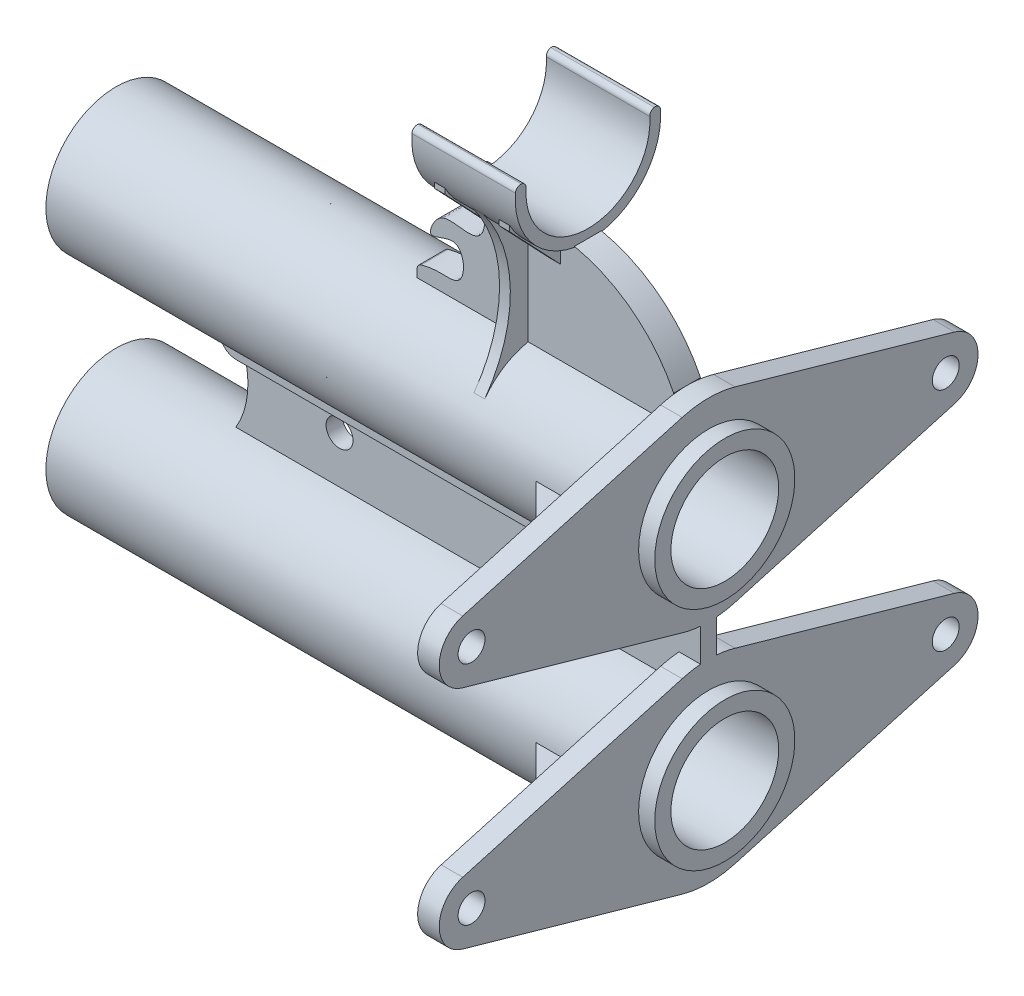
ISO-10303-21;
HEADER;
FILE_DESCRIPTION(('STEP AP214'),'2;1');
FILE_NAME('part.step','',(''),(''),'','','');
FILE_SCHEMA(('AUTOMOTIVE_DESIGN { 1 0 10303 214 1 1 1 1 }'));
ENDSEC;
DATA;
#1=APPLICATION_CONTEXT('core data for automotive mechanical design processes');
#2=APPLICATION_PROTOCOL_DEFINITION('international standard','automotive_design',2000,#1);
#3=PRODUCT_CONTEXT('',#1,'mechanical');
#4=PRODUCT('Part','Part','',(#3));
#5=PRODUCT_RELATED_PRODUCT_CATEGORY('part','',(#4));
#6=PRODUCT_DEFINITION_FORMATION('','',#4);
#7=PRODUCT_DEFINITION_CONTEXT('part definition',#1,'design');
#8=PRODUCT_DEFINITION('design','',#6,#7);
#9=PRODUCT_DEFINITION_SHAPE('','',#8);
#10=(LENGTH_UNIT() NAMED_UNIT(*) SI_UNIT(.MILLI.,.METRE.));
#11=(NAMED_UNIT(*) PLANE_ANGLE_UNIT() SI_UNIT($,.RADIAN.));
#12=(NAMED_UNIT(*) SI_UNIT($,.STERADIAN.) SOLID_ANGLE_UNIT());
#13=UNCERTAINTY_MEASURE_WITH_UNIT(LENGTH_MEASURE(1.E-05),#10,'distance_accuracy_value','');
#14=(GEOMETRIC_REPRESENTATION_CONTEXT(3) GLOBAL_UNCERTAINTY_ASSIGNED_CONTEXT((#13)) GLOBAL_UNIT_ASSIGNED_CONTEXT((#10,
#11,#12)) REPRESENTATION_CONTEXT('',''));
#15=CARTESIAN_POINT('',(0.,0.,0.));
#16=DIRECTION('',(0.,0.,1.));
#17=DIRECTION('',(1.,0.,0.));
#18=AXIS2_PLACEMENT_3D('',#15,#16,#17);
#19=CARTESIAN_POINT('',(-69.85,26.67,0.));
#20=DIRECTION('',(1.,0.,0.));
#21=DIRECTION('',(0.,0.,-1.));
#22=AXIS2_PLACEMENT_3D('',#19,#20,#21);
#23=CYLINDRICAL_SURFACE('',#22,8.255);
#24=CARTESIAN_POINT('',(-69.85,26.67,0.));
#25=DIRECTION('',(1.,0.,0.));
#26=DIRECTION('',(0.,0.,-1.));
#27=AXIS2_PLACEMENT_3D('',#24,#25,#26);
#28=CIRCLE('',#27,8.255);
#29=CARTESIAN_POINT('',(-69.85,26.67,-8.255));
#30=VERTEX_POINT('',#29);
#31=EDGE_CURVE('E1285',#30,#30,#28,.T.);
#32=ORIENTED_EDGE('',*,*,#31,.T.);
#33=EDGE_LOOP('',(#32));
#34=FACE_BOUND('',#33,.T.);
#35=CARTESIAN_POINT('',(-69.85,20.8613239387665,-5.86551851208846));
#36=CARTESIAN_POINT('',(-69.7813928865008,20.9209385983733,-5.92455670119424));
#37=CARTESIAN_POINT('',(-69.7110359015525,20.9804205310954,-5.98166060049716));
#38=CARTESIAN_POINT('',(-69.5669290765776,21.0987877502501,-6.09205754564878));
#39=CARTESIAN_POINT('',(-69.4931796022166,21.1576731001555,-6.14535100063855));
#40=CARTESIAN_POINT('',(-69.2671641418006,21.3328141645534,-6.29949511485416));
#41=CARTESIAN_POINT('',(-69.1099631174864,21.4477020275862,-6.39475334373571));
#42=CARTESIAN_POINT('',(-68.7847556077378,21.6705736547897,-6.57044825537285));
#43=CARTESIAN_POINT('',(-68.6168254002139,21.7785971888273,-6.65097661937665));
#44=CARTESIAN_POINT('',(-68.2705180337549,21.9865696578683,-6.79902970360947));
#45=CARTESIAN_POINT('',(-68.0921388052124,22.086516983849,-6.86655183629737));
#46=CARTESIAN_POINT('',(-67.7269240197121,22.2763689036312,-6.98954870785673));
#47=CARTESIAN_POINT('',(-67.5401167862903,22.3663040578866,-7.04506062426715));
#48=CARTESIAN_POINT('',(-67.1588877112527,22.5352194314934,-7.14550716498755));
#49=CARTESIAN_POINT('',(-66.9644661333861,22.6142000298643,-7.19044215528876));
#50=CARTESIAN_POINT('',(-66.5690294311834,22.7603461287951,-7.27094246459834));
#51=CARTESIAN_POINT('',(-66.36800528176,22.8274945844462,-7.30649430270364));
#52=CARTESIAN_POINT('',(-65.9608775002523,22.9491208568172,-7.36917651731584));
#53=CARTESIAN_POINT('',(-65.7547735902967,23.0035979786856,-7.39630643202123));
#54=CARTESIAN_POINT('',(-65.3193927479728,23.1037994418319,-7.4451755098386));
#55=CARTESIAN_POINT('',(-65.0897384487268,23.1482446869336,-7.4661820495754));
#56=CARTESIAN_POINT('',(-64.6272855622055,23.2209277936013,-7.50003536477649));
#57=CARTESIAN_POINT('',(-64.3944868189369,23.2491648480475,-7.51288173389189));
#58=CARTESIAN_POINT('',(-63.9271175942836,23.2891704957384,-7.53096943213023));
#59=CARTESIAN_POINT('',(-63.6925466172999,23.3009342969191,-7.53620854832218));
#60=CARTESIAN_POINT('',(-63.2231079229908,23.3078727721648,-7.53930609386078));
#61=CARTESIAN_POINT('',(-62.9882401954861,23.3030468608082,-7.53716426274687));
#62=CARTESIAN_POINT('',(-62.5004726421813,23.2757749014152,-7.52492630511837));
#63=CARTESIAN_POINT('',(-62.2476657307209,23.251922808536,-7.51419520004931));
#64=CARTESIAN_POINT('',(-61.7451416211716,23.1851089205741,-7.4834422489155));
#65=CARTESIAN_POINT('',(-61.4954246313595,23.1421458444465,-7.46341978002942));
#66=CARTESIAN_POINT('',(-61.0008787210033,23.0375918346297,-7.41309673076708));
#67=CARTESIAN_POINT('',(-60.756051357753,22.9759950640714,-7.38279292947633));
#68=CARTESIAN_POINT('',(-60.273336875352,22.8349795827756,-7.31053471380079));
#69=CARTESIAN_POINT('',(-60.0354494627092,22.7555616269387,-7.26858079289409));
#70=CARTESIAN_POINT('',(-59.5726426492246,22.5815811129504,-7.17213867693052));
#71=CARTESIAN_POINT('',(-59.3475718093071,22.4872979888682,-7.11787492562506));
#72=CARTESIAN_POINT('',(-58.9082152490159,22.2842580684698,-6.99459716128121));
#73=CARTESIAN_POINT('',(-58.6939296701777,22.1755010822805,-6.92558295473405));
#74=CARTESIAN_POINT('',(-58.278587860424,21.9458583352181,-6.77101391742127));
#75=CARTESIAN_POINT('',(-58.07751406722,21.8249892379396,-6.68548166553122));
#76=CARTESIAN_POINT('',(-57.6904280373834,21.5738580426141,-6.49608055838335));
#77=CARTESIAN_POINT('',(-57.504412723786,21.4435978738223,-6.39221546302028));
#78=CARTESIAN_POINT('',(-57.1715415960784,21.1938650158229,-6.17903268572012));
#79=CARTESIAN_POINT('',(-57.0226963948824,21.0750764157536,-6.07201544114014));
#80=CARTESIAN_POINT('',(-56.7390489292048,20.8357512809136,-5.84243462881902));
#81=CARTESIAN_POINT('',(-56.6042454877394,20.7152148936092,-5.71987236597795));
#82=CARTESIAN_POINT('',(-56.3494827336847,20.4754244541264,-5.45926605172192));
#83=CARTESIAN_POINT('',(-56.2295145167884,20.356169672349,-5.32123138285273));
#84=CARTESIAN_POINT('',(-56.0046555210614,20.1218870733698,-5.03012194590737));
#85=CARTESIAN_POINT('',(-55.8997632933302,20.0068588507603,-4.87704862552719));
#86=CARTESIAN_POINT('',(-55.717667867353,19.7984605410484,-4.57774705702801));
#87=CARTESIAN_POINT('',(-55.6386376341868,19.7042219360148,-4.4332280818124));
#88=CARTESIAN_POINT('',(-55.4916138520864,19.522849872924,-4.13446459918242));
#89=CARTESIAN_POINT('',(-55.4236191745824,19.4357156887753,-3.98022108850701));
#90=CARTESIAN_POINT('',(-55.298208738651,19.2700510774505,-3.66303199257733));
#91=CARTESIAN_POINT('',(-55.2407945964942,19.1915219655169,-3.5000850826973));
#92=CARTESIAN_POINT('',(-55.1360112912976,19.0443555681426,-3.16666708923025));
#93=CARTESIAN_POINT('',(-55.0886424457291,18.9757185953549,-2.9961957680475));
#94=CARTESIAN_POINT('',(-55.0037130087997,18.849875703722,-2.6503357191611));
#95=CARTESIAN_POINT('',(-54.9660775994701,18.7925834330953,-2.47499672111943));
#96=CARTESIAN_POINT('',(-54.8995856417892,18.6895427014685,-2.11934071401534));
#97=CARTESIAN_POINT('',(-54.8707289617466,18.6437940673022,-1.93902377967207));
#98=CARTESIAN_POINT('',(-54.8213181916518,18.564419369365,-1.57460145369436));
#99=CARTESIAN_POINT('',(-54.8007652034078,18.5307949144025,-1.39049556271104));
#100=CARTESIAN_POINT('',(-54.7675988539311,18.4760807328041,-1.01972203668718));
#101=CARTESIAN_POINT('',(-54.7549857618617,18.4549914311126,-0.833054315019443));
#102=CARTESIAN_POINT('',(-54.7370743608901,18.4249455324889,-0.450103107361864));
#103=CARTESIAN_POINT('',(-54.7321224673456,18.4165638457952,-0.253758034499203));
#104=CARTESIAN_POINT('',(-54.7305064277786,18.4138345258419,0.139066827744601));
#105=CARTESIAN_POINT('',(-54.7338425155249,18.4194872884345,0.335546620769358));
#106=CARTESIAN_POINT('',(-54.7488756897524,18.4447606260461,0.727323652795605));
#107=CARTESIAN_POINT('',(-54.7605743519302,18.4643838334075,0.922620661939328));
#108=CARTESIAN_POINT('',(-54.7925782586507,18.517355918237,1.31063293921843));
#109=CARTESIAN_POINT('',(-54.8128835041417,18.5507047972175,1.50334820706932));
#110=CARTESIAN_POINT('',(-54.862856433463,18.6312669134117,1.88755572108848));
#111=CARTESIAN_POINT('',(-54.8926538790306,18.6786716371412,2.07899104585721));
#112=CARTESIAN_POINT('',(-54.9620685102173,18.7864808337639,2.45634972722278));
#113=CARTESIAN_POINT('',(-55.0016858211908,18.8468854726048,2.64227301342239));
#114=CARTESIAN_POINT('',(-55.0913668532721,18.9797417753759,3.00709561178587));
#115=CARTESIAN_POINT('',(-55.1414269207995,19.0521892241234,3.1859973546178));
#116=CARTESIAN_POINT('',(-55.25267102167,19.207936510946,3.53542304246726));
#117=CARTESIAN_POINT('',(-55.3138545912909,19.291235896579,3.70594733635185));
#118=CARTESIAN_POINT('',(-55.4458801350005,19.4644428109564,4.03212130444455));
#119=CARTESIAN_POINT('',(-55.5163622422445,19.5540639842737,4.18806874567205));
#120=CARTESIAN_POINT('',(-55.6688056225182,19.740452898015,4.48974802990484));
#121=CARTESIAN_POINT('',(-55.750766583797,19.8372204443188,4.63548015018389));
#122=CARTESIAN_POINT('',(-55.9264088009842,20.0360151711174,4.91576882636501));
#123=CARTESIAN_POINT('',(-56.0200856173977,20.1380403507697,5.05032958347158));
#124=CARTESIAN_POINT('',(-56.2192280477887,20.345373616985,5.30767676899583));
#125=CARTESIAN_POINT('',(-56.3246934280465,20.4506816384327,5.43046343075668));
#126=CARTESIAN_POINT('',(-56.5431918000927,20.6586795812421,5.65969466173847));
#127=CARTESIAN_POINT('',(-56.6558155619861,20.7613272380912,5.7665684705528));
#128=CARTESIAN_POINT('',(-56.8914121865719,20.9658884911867,5.96899037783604));
#129=CARTESIAN_POINT('',(-57.0143847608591,21.0678021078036,6.06453879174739));
#130=CARTESIAN_POINT('',(-57.2701204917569,21.2691740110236,6.24454588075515));
#131=CARTESIAN_POINT('',(-57.402886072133,21.368631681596,6.32900179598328));
#132=CARTESIAN_POINT('',(-57.6774493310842,21.5634800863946,6.48723644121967));
#133=CARTESIAN_POINT('',(-57.819247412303,21.6588706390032,6.56101469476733));
#134=CARTESIAN_POINT('',(-58.1182593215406,21.8487727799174,6.70189965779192));
#135=CARTESIAN_POINT('',(-58.2758886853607,21.9430078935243,6.76849638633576));
#136=CARTESIAN_POINT('',(-58.5991619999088,22.1241077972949,6.89143467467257));
#137=CARTESIAN_POINT('',(-58.7648061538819,22.2109724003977,6.94777597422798));
#138=CARTESIAN_POINT('',(-59.1031351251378,22.376256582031,7.05112039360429));
#139=CARTESIAN_POINT('',(-59.275822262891,22.4546733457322,7.09812040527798));
#140=CARTESIAN_POINT('',(-59.6271847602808,22.6021611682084,7.1836606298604));
#141=CARTESIAN_POINT('',(-59.8058607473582,22.6712312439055,7.22219995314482));
#142=CARTESIAN_POINT('',(-60.1931153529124,22.8081429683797,7.29643515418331));
#143=CARTESIAN_POINT('',(-60.4024300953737,22.8745125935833,7.33101324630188));
#144=CARTESIAN_POINT('',(-60.82615968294,22.9935325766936,7.39141831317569));
#145=CARTESIAN_POINT('',(-61.040574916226,23.0461818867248,7.41724461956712));
#146=CARTESIAN_POINT('',(-61.4733024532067,23.1372629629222,7.4610556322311));
#147=CARTESIAN_POINT('',(-61.6916166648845,23.1756875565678,7.47903638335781));
#148=CARTESIAN_POINT('',(-62.1307840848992,23.2379389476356,7.50780618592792));
#149=CARTESIAN_POINT('',(-62.3516373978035,23.2617651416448,7.51859494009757));
#150=CARTESIAN_POINT('',(-62.8204005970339,23.2965247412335,7.53426245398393));
#151=CARTESIAN_POINT('',(-63.0684752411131,23.3056404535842,7.53830978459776));
#152=CARTESIAN_POINT('',(-63.5646244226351,23.3053402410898,7.53817518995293));
#153=CARTESIAN_POINT('',(-63.8126989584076,23.295922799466,7.53399259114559));
#154=CARTESIAN_POINT('',(-64.3073310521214,23.2586370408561,7.51718350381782));
#155=CARTESIAN_POINT('',(-64.553887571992,23.2307572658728,7.5045517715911));
#156=CARTESIAN_POINT('',(-65.043623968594,23.156827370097,7.47022771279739));
#157=CARTESIAN_POINT('',(-65.2868039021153,23.1107775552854,7.44853553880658));
#158=CARTESIAN_POINT('',(-65.7746616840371,22.9995164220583,7.39435683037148));
#159=CARTESIAN_POINT('',(-66.0191966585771,22.9338127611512,7.36158972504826));
#160=CARTESIAN_POINT('',(-66.5008680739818,22.7846440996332,7.28396182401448));
#161=CARTESIAN_POINT('',(-66.7380037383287,22.7011772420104,7.23909976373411));
#162=CARTESIAN_POINT('',(-67.2021772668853,22.5180065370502,7.1356156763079));
#163=CARTESIAN_POINT('',(-67.4292371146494,22.4183405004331,7.07702555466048));
#164=CARTESIAN_POINT('',(-67.8715592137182,22.2044788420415,6.94406075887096));
#165=CARTESIAN_POINT('',(-68.0868257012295,22.0902884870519,6.869691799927));
#166=CARTESIAN_POINT('',(-68.439912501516,21.8864790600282,6.72854232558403));
#167=CARTESIAN_POINT('',(-68.581371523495,21.7999524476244,6.66633544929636));
#168=CARTESIAN_POINT('',(-68.8567209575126,21.6221527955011,6.5327351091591));
#169=CARTESIAN_POINT('',(-68.9906138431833,21.5308813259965,6.4613446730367));
#170=CARTESIAN_POINT('',(-69.2506584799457,21.3444192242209,6.30854825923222));
#171=CARTESIAN_POINT('',(-69.3767780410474,21.2492147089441,6.22710434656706));
#172=CARTESIAN_POINT('',(-69.6201920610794,21.0565723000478,6.05402930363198));
#173=CARTESIAN_POINT('',(-69.7374798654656,20.9591327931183,5.96239061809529));
#174=CARTESIAN_POINT('',(-69.85,20.8613239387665,5.86551851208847));
#175=B_SPLINE_CURVE_WITH_KNOTS('',3,(#35,#36,#37,#38,#39,#40,#41,#42,#43,#44,#45,#46,#47,#48,
#49,#50,#51,#52,#53,#54,#55,#56,#57,#58,#59,#60,#61,#62,#63,#64,#65,#66,#67,#68,#69,#70,#71,#72,
#73,#74,#75,#76,#77,#78,#79,#80,#81,#82,#83,#84,#85,#86,#87,#88,#89,#90,#91,#92,#93,#94,#95,#96,
#97,#98,#99,#100,#101,#102,#103,#104,#105,#106,#107,#108,#109,#110,#111,#112,#113,#114,#115,
#116,#117,#118,#119,#120,#121,#122,#123,#124,#125,#126,#127,#128,#129,#130,#131,#132,#133,#134,
#135,#136,#137,#138,#139,#140,#141,#142,#143,#144,#145,#146,#147,#148,#149,#150,#151,#152,#153,
#154,#155,#156,#157,#158,#159,#160,#161,#162,#163,#164,#165,#166,#167,#168,#169,#170,#171,#172,
#173,#174),.UNSPECIFIED.,.F.,.F.,(4,2,2,2,2,2,2,2,2,2,2,2,2,2,2,2,2,2,2,2,2,2,2,2,2,2,2,2,2,2,2,
2,2,2,2,2,2,2,2,2,2,2,2,2,2,2,2,2,2,2,2,2,2,2,2,2,2,2,2,2,2,2,2,2,2,2,2,2,2,4),(0.,
0.325074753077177,0.650114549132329,1.2994004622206,1.94449631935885,2.58972038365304,
3.23291764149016,3.87609263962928,4.52018672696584,5.16431612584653,5.86814182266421,
6.57200256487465,7.27606801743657,7.98015831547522,8.74171808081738,9.50332890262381,
10.2651785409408,11.0269959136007,11.7759040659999,12.5248220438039,13.2727234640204,
14.0204716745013,14.6748472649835,15.3291679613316,15.9830939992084,16.6369571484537,
17.2055765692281,17.7741378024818,18.3427858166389,18.9114517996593,19.4756071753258,
20.0397540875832,20.6039758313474,21.168216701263,21.7572939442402,22.3463878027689,
22.9355926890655,23.524797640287,24.1224303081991,24.720070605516,25.3175021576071,
25.9149088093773,26.4937222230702,27.0725199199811,27.6510989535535,28.2296665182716,
28.7874013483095,29.3451206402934,29.902978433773,30.4608611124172,31.0463176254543,
31.631788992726,32.2174548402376,32.803182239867,33.4693677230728,34.1356040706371,
34.8021758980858,35.4687752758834,36.2127553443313,36.9567963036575,37.7012994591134,
38.4457900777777,39.210764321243,39.9758185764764,40.7391120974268,41.5021296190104,
42.0330348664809,42.5637655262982,43.0965638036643,43.6297595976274),.UNSPECIFIED.);
#176=CARTESIAN_POINT('',(-55.0546588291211,18.925342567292,-2.8575));
#177=VERTEX_POINT('',#176);
#178=CARTESIAN_POINT('',(-55.0546588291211,18.925342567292,2.8575));
#179=VERTEX_POINT('',#178);
#180=EDGE_CURVE('E574',#177,#179,#175,.T.);
#181=ORIENTED_EDGE('',*,*,#180,.T.);
#182=DIRECTION('',(1.,0.,0.));
#183=VECTOR('',#182,1.);
#184=CARTESIAN_POINT('',(-69.851,18.925342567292,2.8575));
#185=LINE('',#184,#183);
#186=CARTESIAN_POINT('',(-2.54,18.925342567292,2.8575));
#187=VERTEX_POINT('',#186);
#188=EDGE_CURVE('E571',#179,#187,#185,.T.);
#189=ORIENTED_EDGE('',*,*,#188,.T.);
#190=CARTESIAN_POINT('',(-2.54,26.67,0.));
#191=DIRECTION('',(1.,0.,0.));
#192=DIRECTION('',(0.,0.,-1.));
#193=AXIS2_PLACEMENT_3D('',#190,#191,#192);
#194=CIRCLE('',#193,8.255);
#195=CARTESIAN_POINT('',(-2.54,25.7175,8.19986394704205));
#196=VERTEX_POINT('',#195);
#197=EDGE_CURVE('E552',#187,#196,#194,.F.);
#198=ORIENTED_EDGE('',*,*,#197,.T.);
#199=DIRECTION('',(1.,0.,0.));
#200=VECTOR('',#199,1.);
#201=CARTESIAN_POINT('',(-69.85,25.7175,8.19986394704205));
#202=LINE('',#201,#200);
#203=CARTESIAN_POINT('',(-12.120136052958,25.7175,8.19986394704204));
#204=VERTEX_POINT('',#203);
#205=EDGE_CURVE('E1411',#196,#204,#202,.F.);
#206=ORIENTED_EDGE('',*,*,#205,.T.);
#207=CARTESIAN_POINT('',(-20.32,26.67,0.));
#208=DIRECTION('',(0.707106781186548,0.,-0.707106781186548));
#209=DIRECTION('',(0.707106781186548,0.,0.707106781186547));
#210=AXIS2_PLACEMENT_3D('',#207,#208,#209);
#211=ELLIPSE('',#210,11.6743329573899,8.255);
#212=CARTESIAN_POINT('',(-12.120136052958,27.6225,8.19986394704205));
#213=VERTEX_POINT('',#212);
#214=EDGE_CURVE('E1406',#204,#213,#211,.F.);
#215=ORIENTED_EDGE('',*,*,#214,.T.);
#216=DIRECTION('',(1.,0.,0.));
#217=VECTOR('',#216,1.);
#218=CARTESIAN_POINT('',(-69.85,27.6225,8.19986394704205));
#219=LINE('',#218,#217);
#220=CARTESIAN_POINT('',(-2.54,27.6225,8.19986394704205));
#221=VERTEX_POINT('',#220);
#222=EDGE_CURVE('E1408',#221,#213,#219,.F.);
#223=ORIENTED_EDGE('',*,*,#222,.F.);
#224=CARTESIAN_POINT('',(-2.54,34.7709177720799,1.5875));
#225=VERTEX_POINT('',#224);
#226=EDGE_CURVE('E565',#221,#225,#194,.F.);
#227=ORIENTED_EDGE('',*,*,#226,.T.);
#228=DIRECTION('',(1.,0.,0.));
#229=VECTOR('',#228,1.);
#230=CARTESIAN_POINT('',(-69.85,34.7709177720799,1.5875));
#231=LINE('',#230,#229);
#232=CARTESIAN_POINT('',(-19.685,34.7709177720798,1.58749999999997));
#233=VERTEX_POINT('',#232);
#234=EDGE_CURVE('E1424',#233,#225,#231,.T.);
#235=ORIENTED_EDGE('',*,*,#234,.F.);
#236=CARTESIAN_POINT('',(-19.685,26.67,0.));
#237=DIRECTION('',(-1.,0.,0.));
#238=DIRECTION('',(0.,0.,1.));
#239=AXIS2_PLACEMENT_3D('',#236,#237,#238);
#240=CIRCLE('',#239,8.25499999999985);
#241=CARTESIAN_POINT('',(-19.685,31.4925708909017,6.69983843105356));
#242=VERTEX_POINT('',#241);
#243=EDGE_CURVE('E651',#242,#233,#240,.T.);
#244=ORIENTED_EDGE('',*,*,#243,.F.);
#245=DIRECTION('',(1.,0.,0.));
#246=VECTOR('',#245,1.);
#247=CARTESIAN_POINT('',(-20.955,31.4925708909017,6.69983843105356));
#248=LINE('',#247,#246);
#249=CARTESIAN_POINT('',(-20.955,31.4925708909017,6.69983843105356));
#250=VERTEX_POINT('',#249);
#251=EDGE_CURVE('E671',#250,#242,#248,.T.);
#252=ORIENTED_EDGE('',*,*,#251,.F.);
#253=CARTESIAN_POINT('',(-20.955,26.67,0.));
#254=DIRECTION('',(-1.,0.,0.));
#255=DIRECTION('',(0.,0.,1.));
#256=AXIS2_PLACEMENT_3D('',#253,#254,#255);
#257=CIRCLE('',#256,8.25499999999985);
#258=CARTESIAN_POINT('',(-20.955,34.7709177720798,1.58749999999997));
#259=VERTEX_POINT('',#258);
#260=EDGE_CURVE('E662',#250,#259,#257,.T.);
#261=ORIENTED_EDGE('',*,*,#260,.T.);
#262=CARTESIAN_POINT('',(-32.766,34.7709177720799,1.5875));
#263=VERTEX_POINT('',#262);
#264=EDGE_CURVE('E1421',#263,#259,#231,.T.);
#265=ORIENTED_EDGE('',*,*,#264,.F.);
#266=CARTESIAN_POINT('',(-32.766,26.67,0.));
#267=DIRECTION('',(-1.,0.,0.));
#268=DIRECTION('',(0.,0.,1.));
#269=AXIS2_PLACEMENT_3D('',#266,#267,#268);
#270=CIRCLE('',#269,8.255);
#271=CARTESIAN_POINT('',(-32.766,34.7709177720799,-1.5875));
#272=VERTEX_POINT('',#271);
#273=EDGE_CURVE('E1445',#272,#263,#270,.F.);
#274=ORIENTED_EDGE('',*,*,#273,.F.);
#275=DIRECTION('',(1.,0.,0.));
#276=VECTOR('',#275,1.);
#277=CARTESIAN_POINT('',(-69.85,34.7709177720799,-1.5875));
#278=LINE('',#277,#276);
#279=CARTESIAN_POINT('',(-20.955,34.7709177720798,-1.58749999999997));
#280=VERTEX_POINT('',#279);
#281=EDGE_CURVE('E1425',#272,#280,#278,.T.);
#282=ORIENTED_EDGE('',*,*,#281,.T.);
#283=CARTESIAN_POINT('',(-20.955,26.67,0.));
#284=DIRECTION('',(1.,0.,0.));
#285=DIRECTION('',(0.,0.,-1.));
#286=AXIS2_PLACEMENT_3D('',#283,#284,#285);
#287=CIRCLE('',#286,8.25499999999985);
#288=CARTESIAN_POINT('',(-20.955,31.4925708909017,-6.69983843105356));
#289=VERTEX_POINT('',#288);
#290=EDGE_CURVE('E762',#289,#280,#287,.T.);
#291=ORIENTED_EDGE('',*,*,#290,.F.);
#292=DIRECTION('',(1.,0.,0.));
#293=VECTOR('',#292,1.);
#294=CARTESIAN_POINT('',(-20.955,31.4925708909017,-6.69983843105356));
#295=LINE('',#294,#293);
#296=CARTESIAN_POINT('',(-19.685,31.4925708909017,-6.69983843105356));
#297=VERTEX_POINT('',#296);
#298=EDGE_CURVE('E766',#289,#297,#295,.T.);
#299=ORIENTED_EDGE('',*,*,#298,.T.);
#300=CARTESIAN_POINT('',(-19.685,26.67,0.));
#301=DIRECTION('',(1.,0.,0.));
#302=DIRECTION('',(0.,0.,-1.));
#303=AXIS2_PLACEMENT_3D('',#300,#301,#302);
#304=CIRCLE('',#303,8.25499999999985);
#305=CARTESIAN_POINT('',(-19.685,34.7709177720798,-1.58749999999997));
#306=VERTEX_POINT('',#305);
#307=EDGE_CURVE('E751',#297,#306,#304,.T.);
#308=ORIENTED_EDGE('',*,*,#307,.T.);
#309=CARTESIAN_POINT('',(-2.54,34.7709177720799,-1.5875));
#310=VERTEX_POINT('',#309);
#311=EDGE_CURVE('E1428',#306,#310,#278,.T.);
#312=ORIENTED_EDGE('',*,*,#311,.T.);
#313=CARTESIAN_POINT('',(-2.54,27.6225,-8.19986394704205));
#314=VERTEX_POINT('',#313);
#315=EDGE_CURVE('E567',#310,#314,#194,.F.);
#316=ORIENTED_EDGE('',*,*,#315,.T.);
#317=DIRECTION('',(1.,0.,0.));
#318=VECTOR('',#317,1.);
#319=CARTESIAN_POINT('',(-69.85,27.6225,-8.19986394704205));
#320=LINE('',#319,#318);
#321=CARTESIAN_POINT('',(-12.120136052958,27.6225,-8.19986394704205));
#322=VERTEX_POINT('',#321);
#323=EDGE_CURVE('E1391',#322,#314,#320,.T.);
#324=ORIENTED_EDGE('',*,*,#323,.F.);
#325=CARTESIAN_POINT('',(-20.32,26.67,0.));
#326=DIRECTION('',(-0.707106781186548,0.,-0.707106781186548));
#327=DIRECTION('',(0.707106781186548,0.,-0.707106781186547));
#328=AXIS2_PLACEMENT_3D('',#325,#326,#327);
#329=ELLIPSE('',#328,11.6743329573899,8.255);
#330=CARTESIAN_POINT('',(-12.1201360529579,25.7175,-8.19986394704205));
#331=VERTEX_POINT('',#330);
#332=EDGE_CURVE('E1388',#331,#322,#329,.F.);
#333=ORIENTED_EDGE('',*,*,#332,.F.);
#334=DIRECTION('',(1.,0.,0.));
#335=VECTOR('',#334,1.);
#336=CARTESIAN_POINT('',(-69.85,25.7175,-8.19986394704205));
#337=LINE('',#336,#335);
#338=CARTESIAN_POINT('',(-2.54,25.7175,-8.19986394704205));
#339=VERTEX_POINT('',#338);
#340=EDGE_CURVE('E1394',#331,#339,#337,.T.);
#341=ORIENTED_EDGE('',*,*,#340,.T.);
#342=CARTESIAN_POINT('',(-2.54,18.925342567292,-2.8575));
#343=VERTEX_POINT('',#342);
#344=EDGE_CURVE('E568',#339,#343,#194,.F.);
#345=ORIENTED_EDGE('',*,*,#344,.T.);
#346=DIRECTION('',(1.,0.,0.));
#347=VECTOR('',#346,1.);
#348=CARTESIAN_POINT('',(-69.851,18.925342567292,-2.8575));
#349=LINE('',#348,#347);
#350=EDGE_CURVE('E683',#177,#343,#349,.T.);
#351=ORIENTED_EDGE('',*,*,#350,.F.);
#352=EDGE_LOOP('',(#181,#189,#198,#206,#215,#223,#227,#235,#244,#252,#261,#265,#274,#282,#291,
#299,#308,#312,#316,#324,#333,#341,#345,#351));
#353=FACE_BOUND('',#352,.T.);
#354=ADVANCED_FACE('F28',(#34,#353),#23,.T.);
#355=CARTESIAN_POINT('',(-17.78,30.6705,1.5875));
#356=DIRECTION('',(0.,0.,1.));
#357=DIRECTION('',(1.,0.,0.));
#358=AXIS2_PLACEMENT_3D('',#355,#356,#357);
#359=PLANE('',#358);
#360=DIRECTION('',(0.,1.,0.));
#361=VECTOR('',#360,1.);
#362=CARTESIAN_POINT('',(-24.765,44.5982730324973,1.5875));
#363=LINE('',#362,#361);
#364=CARTESIAN_POINT('',(-24.765,44.5982730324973,1.5875));
#365=VERTEX_POINT('',#364);
#366=CARTESIAN_POINT('',(-24.765,47.1382730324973,1.5875));
#367=VERTEX_POINT('',#366);
#368=EDGE_CURVE('E628',#365,#367,#363,.T.);
#369=ORIENTED_EDGE('',*,*,#368,.T.);
#370=DIRECTION('',(-1.,0.,0.));
#371=VECTOR('',#370,1.);
#372=CARTESIAN_POINT('',(-14.224,47.1382730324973,1.5875));
#373=LINE('',#372,#371);
#374=CARTESIAN_POINT('',(-26.416,47.1382730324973,1.5875));
#375=VERTEX_POINT('',#374);
#376=EDGE_CURVE('E800',#367,#375,#373,.T.);
#377=ORIENTED_EDGE('',*,*,#376,.T.);
#378=DIRECTION('',(0.,1.,0.));
#379=VECTOR('',#378,1.);
#380=CARTESIAN_POINT('',(-26.416,30.6705,1.5875));
#381=LINE('',#380,#379);
#382=CARTESIAN_POINT('',(-26.416,47.625,1.5875));
#383=VERTEX_POINT('',#382);
#384=EDGE_CURVE('E793',#375,#383,#381,.T.);
#385=ORIENTED_EDGE('',*,*,#384,.T.);
#386=DIRECTION('',(1.,0.,0.));
#387=VECTOR('',#386,1.);
#388=CARTESIAN_POINT('',(-27.94,47.625,1.5875));
#389=LINE('',#388,#387);
#390=CARTESIAN_POINT('',(-27.5077854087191,47.625,1.5875));
#391=VERTEX_POINT('',#390);
#392=EDGE_CURVE('E828',#391,#383,#389,.T.);
#393=ORIENTED_EDGE('',*,*,#392,.F.);
#394=CARTESIAN_POINT('',(-27.5077854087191,46.99,1.5875));
#395=DIRECTION('',(0.,0.,1.));
#396=DIRECTION('',(1.,0.,0.));
#397=AXIS2_PLACEMENT_3D('',#394,#395,#396);
#398=CIRCLE('',#397,0.635);
#399=CARTESIAN_POINT('',(-28.0952549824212,47.2310487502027,1.5875));
#400=VERTEX_POINT('',#399);
#401=EDGE_CURVE('E1466',#391,#400,#398,.T.);
#402=ORIENTED_EDGE('',*,*,#401,.T.);
#403=CARTESIAN_POINT('',(-32.766,36.195,1.5875));
#404=CARTESIAN_POINT('',(-31.971942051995,36.4065133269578,1.5875));
#405=CARTESIAN_POINT('',(-30.3838261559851,36.8295399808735,1.5875));
#406=CARTESIAN_POINT('',(-26.8521600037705,36.2135001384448,1.5875));
#407=CARTESIAN_POINT('',(-27.3556929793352,42.1394407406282,1.5875));
#408=CARTESIAN_POINT('',(-31.9817472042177,38.8737309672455,1.5875));
#409=CARTESIAN_POINT('',(-30.3304275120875,42.7763879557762,1.5875));
#410=CARTESIAN_POINT('',(-27.8795990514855,42.4294930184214,1.5875));
#411=CARTESIAN_POINT('',(-24.455585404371,42.0846930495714,1.5875));
#412=CARTESIAN_POINT('',(-24.7115071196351,48.014523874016,1.5875));
#413=CARTESIAN_POINT('',(-29.2918668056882,44.9436542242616,1.5875));
#414=CARTESIAN_POINT('',(-28.2593808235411,46.7968799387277,1.5875));
#415=CARTESIAN_POINT('',(-28.0464602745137,47.3489599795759,1.5875));
#416=CARTESIAN_POINT('',(-27.94,47.625,1.5875));
#417=B_SPLINE_CURVE_WITH_KNOTS('',3,(#403,#404,#405,#406,#407,#408,#409,#410,#411,#412,#413,
#414,#415,#416),.UNSPECIFIED.,.F.,.F.,(4,1,1,1,1,1,1,1,1,1,1,4),(0.,0.0946805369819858,
0.189361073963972,0.320714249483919,0.425425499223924,0.503720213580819,0.598400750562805,
0.693081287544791,0.824434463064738,0.929145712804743,0.964572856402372,1.),.UNSPECIFIED.);
#418=CARTESIAN_POINT('',(-32.2878057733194,36.320529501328,1.5875));
#419=VERTEX_POINT('',#418);
#420=EDGE_CURVE('E831',#419,#400,#417,.T.);
#421=ORIENTED_EDGE('',*,*,#420,.F.);
#422=CARTESIAN_POINT('',(-32.131,35.7051946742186,1.5875));
#423=DIRECTION('',(0.,0.,1.));
#424=DIRECTION('',(1.,0.,0.));
#425=AXIS2_PLACEMENT_3D('',#422,#423,#424);
#426=CIRCLE('',#425,0.635);
#427=CARTESIAN_POINT('',(-32.766,35.7051946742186,1.5875));
#428=VERTEX_POINT('',#427);
#429=EDGE_CURVE('E1451',#419,#428,#426,.T.);
#430=ORIENTED_EDGE('',*,*,#429,.T.);
#431=DIRECTION('',(0.,1.,0.));
#432=VECTOR('',#431,1.);
#433=CARTESIAN_POINT('',(-32.766,33.9725,1.5875));
#434=LINE('',#433,#432);
#435=EDGE_CURVE('E837',#263,#428,#434,.T.);
#436=ORIENTED_EDGE('',*,*,#435,.F.);
#437=ORIENTED_EDGE('',*,*,#264,.T.);
#438=DIRECTION('',(0.,1.,0.));
#439=VECTOR('',#438,1.);
#440=CARTESIAN_POINT('',(-20.955,34.7709177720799,1.5875));
#441=LINE('',#440,#439);
#442=CARTESIAN_POINT('',(-20.955,47.1382730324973,1.5875));
#443=VERTEX_POINT('',#442);
#444=EDGE_CURVE('E659',#259,#443,#441,.T.);
#445=ORIENTED_EDGE('',*,*,#444,.T.);
#446=CARTESIAN_POINT('',(-23.495,47.1382730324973,1.5875));
#447=VERTEX_POINT('',#446);
#448=EDGE_CURVE('E806',#443,#447,#373,.T.);
#449=ORIENTED_EDGE('',*,*,#448,.T.);
#450=DIRECTION('',(0.,1.,0.));
#451=VECTOR('',#450,1.);
#452=CARTESIAN_POINT('',(-23.495,44.5982730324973,1.5875));
#453=LINE('',#452,#451);
#454=CARTESIAN_POINT('',(-23.495,44.5982730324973,1.5875));
#455=VERTEX_POINT('',#454);
#456=EDGE_CURVE('E618',#455,#447,#453,.T.);
#457=ORIENTED_EDGE('',*,*,#456,.F.);
#458=DIRECTION('',(1.,0.,0.));
#459=VECTOR('',#458,1.);
#460=CARTESIAN_POINT('',(-24.765,44.5982730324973,1.5875));
#461=LINE('',#460,#459);
#462=EDGE_CURVE('E643',#365,#455,#461,.T.);
#463=ORIENTED_EDGE('',*,*,#462,.F.);
#464=EDGE_LOOP('',(#369,#377,#385,#393,#402,#421,#430,#436,#437,#445,#449,#457,#463));
#465=FACE_BOUND('',#464,.T.);
#466=ADVANCED_FACE('F948',(#465),#359,.T.);
#467=CARTESIAN_POINT('',(-14.224,55.5625,0.));
#468=DIRECTION('',(-1.,0.,0.));
#469=DIRECTION('',(0.,0.,1.));
#470=AXIS2_PLACEMENT_3D('',#467,#468,#469);
#471=CYLINDRICAL_SURFACE('',#470,8.5725);
#472=DIRECTION('',(-1.,0.,0.));
#473=VECTOR('',#472,1.);
#474=CARTESIAN_POINT('',(-15.875,51.5318122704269,7.56579887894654));
#475=LINE('',#474,#473);
#476=CARTESIAN_POINT('',(-15.875,51.5318122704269,7.56579887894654));
#477=VERTEX_POINT('',#476);
#478=CARTESIAN_POINT('',(-17.145,51.5318122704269,7.56579887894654));
#479=VERTEX_POINT('',#478);
#480=EDGE_CURVE('E616',#477,#479,#475,.T.);
#481=ORIENTED_EDGE('',*,*,#480,.F.);
#482=CARTESIAN_POINT('',(-15.875,55.5625,0.));
#483=DIRECTION('',(1.,0.,0.));
#484=DIRECTION('',(0.,0.,-1.));
#485=AXIS2_PLACEMENT_3D('',#482,#483,#484);
#486=CIRCLE('',#485,8.5725);
#487=CARTESIAN_POINT('',(-15.875,47.1382730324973,1.58750000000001));
#488=VERTEX_POINT('',#487);
#489=EDGE_CURVE('E602',#477,#488,#486,.T.);
#490=ORIENTED_EDGE('',*,*,#489,.T.);
#491=CARTESIAN_POINT('',(-14.224,47.1382730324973,1.5875));
#492=VERTEX_POINT('',#491);
#493=EDGE_CURVE('E801',#492,#488,#373,.T.);
#494=ORIENTED_EDGE('',*,*,#493,.F.);
#495=CARTESIAN_POINT('',(-14.224,55.5625,0.));
#496=DIRECTION('',(1.,0.,0.));
#497=DIRECTION('',(0.,0.,-1.));
#498=AXIS2_PLACEMENT_3D('',#495,#496,#497);
#499=CIRCLE('',#498,8.5725);
#500=CARTESIAN_POINT('',(-14.224,56.1501971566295,8.55233116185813));
#501=VERTEX_POINT('',#500);
#502=EDGE_CURVE('E785',#501,#492,#499,.T.);
#503=ORIENTED_EDGE('',*,*,#502,.F.);
#504=DIRECTION('',(-1.,0.,0.));
#505=VECTOR('',#504,1.);
#506=CARTESIAN_POINT('',(-14.224,56.1501971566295,8.55233116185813));
#507=LINE('',#506,#505);
#508=CARTESIAN_POINT('',(-26.416,56.1501971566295,8.55233116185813));
#509=VERTEX_POINT('',#508);
#510=EDGE_CURVE('E1482',#501,#509,#507,.T.);
#511=ORIENTED_EDGE('',*,*,#510,.T.);
#512=CARTESIAN_POINT('',(-26.416,55.5625,0.));
#513=DIRECTION('',(1.,0.,0.));
#514=DIRECTION('',(0.,0.,-1.));
#515=AXIS2_PLACEMENT_3D('',#512,#513,#514);
#516=CIRCLE('',#515,8.5725);
#517=EDGE_CURVE('E778',#509,#375,#516,.T.);
#518=ORIENTED_EDGE('',*,*,#517,.T.);
#519=ORIENTED_EDGE('',*,*,#376,.F.);
#520=CARTESIAN_POINT('',(-24.765,55.5625,0.));
#521=DIRECTION('',(1.,0.,0.));
#522=DIRECTION('',(0.,0.,-1.));
#523=AXIS2_PLACEMENT_3D('',#520,#521,#522);
#524=CIRCLE('',#523,8.5725);
#525=CARTESIAN_POINT('',(-24.765,51.5318122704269,7.56579887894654));
#526=VERTEX_POINT('',#525);
#527=EDGE_CURVE('E635',#526,#367,#524,.T.);
#528=ORIENTED_EDGE('',*,*,#527,.F.);
#529=DIRECTION('',(1.,0.,0.));
#530=VECTOR('',#529,1.);
#531=CARTESIAN_POINT('',(-24.765,51.5318122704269,7.56579887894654));
#532=LINE('',#531,#530);
#533=CARTESIAN_POINT('',(-23.495,51.5318122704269,7.56579887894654));
#534=VERTEX_POINT('',#533);
#535=EDGE_CURVE('E638',#526,#534,#532,.T.);
#536=ORIENTED_EDGE('',*,*,#535,.T.);
#537=CARTESIAN_POINT('',(-23.495,55.5625,0.));
#538=DIRECTION('',(1.,0.,0.));
#539=DIRECTION('',(0.,0.,-1.));
#540=AXIS2_PLACEMENT_3D('',#537,#538,#539);
#541=CIRCLE('',#540,8.5725);
#542=EDGE_CURVE('E626',#534,#447,#541,.T.);
#543=ORIENTED_EDGE('',*,*,#542,.T.);
#544=ORIENTED_EDGE('',*,*,#448,.F.);
#545=CARTESIAN_POINT('',(-20.955,55.5625,0.));
#546=DIRECTION('',(-1.,0.,0.));
#547=DIRECTION('',(0.,0.,1.));
#548=AXIS2_PLACEMENT_3D('',#545,#546,#547);
#549=CIRCLE('',#548,8.57249999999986);
#550=CARTESIAN_POINT('',(-20.955,50.4319281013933,6.86767706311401));
#551=VERTEX_POINT('',#550);
#552=EDGE_CURVE('E656',#443,#551,#549,.T.);
#553=ORIENTED_EDGE('',*,*,#552,.T.);
#554=DIRECTION('',(1.,0.,0.));
#555=VECTOR('',#554,1.);
#556=CARTESIAN_POINT('',(-20.955,50.4319281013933,6.86767706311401));
#557=LINE('',#556,#555);
#558=CARTESIAN_POINT('',(-19.685,50.4319281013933,6.86767706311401));
#559=VERTEX_POINT('',#558);
#560=EDGE_CURVE('E668',#551,#559,#557,.T.);
#561=ORIENTED_EDGE('',*,*,#560,.T.);
#562=CARTESIAN_POINT('',(-19.685,55.5625,0.));
#563=DIRECTION('',(-1.,0.,0.));
#564=DIRECTION('',(0.,0.,1.));
#565=AXIS2_PLACEMENT_3D('',#562,#563,#564);
#566=CIRCLE('',#565,8.57249999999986);
#567=CARTESIAN_POINT('',(-19.685,47.1382730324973,1.5875));
#568=VERTEX_POINT('',#567);
#569=EDGE_CURVE('E646',#568,#559,#566,.T.);
#570=ORIENTED_EDGE('',*,*,#569,.F.);
#571=CARTESIAN_POINT('',(-17.145,47.1382730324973,1.5875));
#572=VERTEX_POINT('',#571);
#573=EDGE_CURVE('E805',#572,#568,#373,.T.);
#574=ORIENTED_EDGE('',*,*,#573,.F.);
#575=CARTESIAN_POINT('',(-17.145,55.5625,0.));
#576=DIRECTION('',(1.,0.,0.));
#577=DIRECTION('',(0.,0.,-1.));
#578=AXIS2_PLACEMENT_3D('',#575,#576,#577);
#579=CIRCLE('',#578,8.5725);
#580=EDGE_CURVE('E592',#479,#572,#579,.T.);
#581=ORIENTED_EDGE('',*,*,#580,.F.);
#582=EDGE_LOOP('',(#481,#490,#494,#503,#511,#518,#519,#528,#536,#543,#544,#553,#561,#570,#574,#581));
#583=FACE_BOUND('',#582,.T.);
#584=ADVANCED_FACE('F1663',(#583),#471,.T.);
#585=CARTESIAN_POINT('',(-63.3104921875,13.335,-0.9525));
#586=DIRECTION('',(0.,0.,1.));
#587=DIRECTION('',(1.,0.,0.));
#588=AXIS2_PLACEMENT_3D('',#585,#586,#587);
#589=PLANE('',#588);
#590=CARTESIAN_POINT('',(-12.7,13.7414,-0.9525));
#591=DIRECTION('',(0.,0.,1.));
#592=DIRECTION('',(1.,0.,0.));
#593=AXIS2_PLACEMENT_3D('',#590,#591,#592);
#594=CIRCLE('',#593,1.5875);
#595=CARTESIAN_POINT('',(-14.2875,13.7414,-0.9525));
#596=VERTEX_POINT('',#595);
#597=EDGE_CURVE('E1282',#596,#596,#594,.T.);
#598=ORIENTED_EDGE('',*,*,#597,.T.);
#599=EDGE_LOOP('',(#598));
#600=FACE_BOUND('',#599,.T.);
#601=CARTESIAN_POINT('',(-42.545,13.7414,-0.9525));
#602=DIRECTION('',(0.,0.,1.));
#603=DIRECTION('',(1.,0.,0.));
#604=AXIS2_PLACEMENT_3D('',#601,#602,#603);
#605=CIRCLE('',#604,1.5875);
#606=CARTESIAN_POINT('',(-44.1325,13.7414,-0.9525));
#607=VERTEX_POINT('',#606);
#608=EDGE_CURVE('E1274',#607,#607,#605,.T.);
#609=ORIENTED_EDGE('',*,*,#608,.T.);
#610=EDGE_LOOP('',(#609));
#611=FACE_BOUND('',#610,.T.);
#612=CARTESIAN_POINT('',(-63.3104921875,13.335,-0.9525));
#613=DIRECTION('',(0.,0.,1.));
#614=DIRECTION('',(1.,0.,0.));
#615=AXIS2_PLACEMENT_3D('',#612,#613,#614);
#616=CIRCLE('',#615,9.97049218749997);
#617=CARTESIAN_POINT('',(-54.7640840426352,8.19986394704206,-0.952499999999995));
#618=VERTEX_POINT('',#617);
#619=CARTESIAN_POINT('',(-54.5138391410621,18.0285710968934,-0.9525));
#620=VERTEX_POINT('',#619);
#621=EDGE_CURVE('E1102',#618,#620,#616,.T.);
#622=ORIENTED_EDGE('',*,*,#621,.T.);
#623=CARTESIAN_POINT('',(-52.8331172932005,18.925342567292,-0.9525));
#624=DIRECTION('',(0.,0.,1.));
#625=DIRECTION('',(1.,0.,0.));
#626=AXIS2_PLACEMENT_3D('',#623,#624,#625);
#627=CIRCLE('',#626,1.905);
#628=CARTESIAN_POINT('',(-52.8331172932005,17.020342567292,-0.9525));
#629=VERTEX_POINT('',#628);
#630=EDGE_CURVE('E1514',#620,#629,#627,.T.);
#631=ORIENTED_EDGE('',*,*,#630,.T.);
#632=DIRECTION('',(1.,0.,0.));
#633=VECTOR('',#632,1.);
#634=CARTESIAN_POINT('',(-69.851,17.020342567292,-0.9525));
#635=LINE('',#634,#633);
#636=CARTESIAN_POINT('',(-2.54,17.020342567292,-0.9525));
#637=VERTEX_POINT('',#636);
#638=EDGE_CURVE('E677',#629,#637,#635,.T.);
#639=ORIENTED_EDGE('',*,*,#638,.T.);
#640=DIRECTION('',(0.,1.,0.));
#641=VECTOR('',#640,1.);
#642=CARTESIAN_POINT('',(-2.54,13.335,-0.9525));
#643=LINE('',#642,#641);
#644=CARTESIAN_POINT('',(-2.54,15.2797566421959,-0.9525));
#645=VERTEX_POINT('',#644);
#646=EDGE_CURVE('E1293',#645,#637,#643,.T.);
#647=ORIENTED_EDGE('',*,*,#646,.F.);
#648=DIRECTION('',(1.,0.,0.));
#649=VECTOR('',#648,1.);
#650=CARTESIAN_POINT('',(-2.54,15.2797566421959,-0.9525));
#651=LINE('',#650,#649);
#652=CARTESIAN_POINT('',(0.,15.2797566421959,-0.9525));
#653=VERTEX_POINT('',#652);
#654=EDGE_CURVE('E564',#645,#653,#651,.T.);
#655=ORIENTED_EDGE('',*,*,#654,.T.);
#656=DIRECTION('',(0.,1.,0.));
#657=VECTOR('',#656,1.);
#658=CARTESIAN_POINT('',(0.,7.3025,-0.9525));
#659=LINE('',#658,#657);
#660=CARTESIAN_POINT('',(0.,11.3902433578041,-0.9525));
#661=VERTEX_POINT('',#660);
#662=EDGE_CURVE('E1269',#661,#653,#659,.T.);
#663=ORIENTED_EDGE('',*,*,#662,.F.);
#664=DIRECTION('',(1.,0.,0.));
#665=VECTOR('',#664,1.);
#666=CARTESIAN_POINT('',(-2.54,11.3902433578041,-0.9525));
#667=LINE('',#666,#665);
#668=CARTESIAN_POINT('',(-2.54,11.3902433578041,-0.952499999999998));
#669=VERTEX_POINT('',#668);
#670=EDGE_CURVE('E1110',#669,#661,#667,.T.);
#671=ORIENTED_EDGE('',*,*,#670,.F.);
#672=DIRECTION('',(0.,-1.,0.));
#673=VECTOR('',#672,1.);
#674=CARTESIAN_POINT('',(-2.54,0.,-0.952499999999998));
#675=LINE('',#674,#673);
#676=CARTESIAN_POINT('',(-2.54,8.19986394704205,-0.952499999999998));
#677=VERTEX_POINT('',#676);
#678=EDGE_CURVE('E1092',#669,#677,#675,.T.);
#679=ORIENTED_EDGE('',*,*,#678,.T.);
#680=DIRECTION('',(1.,0.,0.));
#681=VECTOR('',#680,1.);
#682=CARTESIAN_POINT('',(-69.85,8.19986394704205,-0.9525));
#683=LINE('',#682,#681);
#684=EDGE_CURVE('E1113',#618,#677,#683,.T.);
#685=ORIENTED_EDGE('',*,*,#684,.F.);
#686=EDGE_LOOP('',(#622,#631,#639,#647,#655,#663,#671,#679,#685));
#687=FACE_BOUND('',#686,.T.);
#688=ADVANCED_FACE('F1267',(#600,#611,#687),#589,.F.);
#689=CARTESIAN_POINT('',(-17.78,30.6705,-1.5875));
#690=DIRECTION('',(0.,0.,1.));
#691=DIRECTION('',(1.,0.,0.));
#692=AXIS2_PLACEMENT_3D('',#689,#690,#691);
#693=PLANE('',#692);
#694=DIRECTION('',(-1.,0.,0.));
#695=VECTOR('',#694,1.);
#696=CARTESIAN_POINT('',(-14.224,47.1382730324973,-1.5875));
#697=LINE('',#696,#695);
#698=CARTESIAN_POINT('',(-24.765,47.1382730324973,-1.5875));
#699=VERTEX_POINT('',#698);
#700=CARTESIAN_POINT('',(-26.416,47.1382730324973,-1.5875));
#701=VERTEX_POINT('',#700);
#702=EDGE_CURVE('E1474',#699,#701,#697,.T.);
#703=ORIENTED_EDGE('',*,*,#702,.F.);
#704=DIRECTION('',(0.,1.,0.));
#705=VECTOR('',#704,1.);
#706=CARTESIAN_POINT('',(-24.765,44.5982730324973,-1.5875));
#707=LINE('',#706,#705);
#708=CARTESIAN_POINT('',(-24.765,44.5982730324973,-1.5875));
#709=VERTEX_POINT('',#708);
#710=EDGE_CURVE('E728',#709,#699,#707,.T.);
#711=ORIENTED_EDGE('',*,*,#710,.F.);
#712=DIRECTION('',(1.,0.,0.));
#713=VECTOR('',#712,1.);
#714=CARTESIAN_POINT('',(-24.765,44.5982730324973,-1.5875));
#715=LINE('',#714,#713);
#716=CARTESIAN_POINT('',(-23.495,44.5982730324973,-1.5875));
#717=VERTEX_POINT('',#716);
#718=EDGE_CURVE('E739',#709,#717,#715,.T.);
#719=ORIENTED_EDGE('',*,*,#718,.T.);
#720=DIRECTION('',(0.,1.,0.));
#721=VECTOR('',#720,1.);
#722=CARTESIAN_POINT('',(-23.495,44.5982730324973,-1.5875));
#723=LINE('',#722,#721);
#724=CARTESIAN_POINT('',(-23.495,47.1382730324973,-1.58750000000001));
#725=VERTEX_POINT('',#724);
#726=EDGE_CURVE('E716',#717,#725,#723,.T.);
#727=ORIENTED_EDGE('',*,*,#726,.T.);
#728=CARTESIAN_POINT('',(-20.955,47.1382730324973,-1.5875));
#729=VERTEX_POINT('',#728);
#730=EDGE_CURVE('E1480',#729,#725,#697,.T.);
#731=ORIENTED_EDGE('',*,*,#730,.F.);
#732=DIRECTION('',(0.,1.,0.));
#733=VECTOR('',#732,1.);
#734=CARTESIAN_POINT('',(-20.955,34.7709177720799,-1.5875));
#735=LINE('',#734,#733);
#736=EDGE_CURVE('E764',#280,#729,#735,.T.);
#737=ORIENTED_EDGE('',*,*,#736,.F.);
#738=ORIENTED_EDGE('',*,*,#281,.F.);
#739=DIRECTION('',(0.,1.,0.));
#740=VECTOR('',#739,1.);
#741=CARTESIAN_POINT('',(-32.766,33.9725,-1.5875));
#742=LINE('',#741,#740);
#743=CARTESIAN_POINT('',(-32.766,35.7051946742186,-1.5875));
#744=VERTEX_POINT('',#743);
#745=EDGE_CURVE('E816',#272,#744,#742,.T.);
#746=ORIENTED_EDGE('',*,*,#745,.T.);
#747=CARTESIAN_POINT('',(-32.131,35.7051946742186,-1.5875));
#748=DIRECTION('',(0.,0.,1.));
#749=DIRECTION('',(1.,0.,0.));
#750=AXIS2_PLACEMENT_3D('',#747,#748,#749);
#751=CIRCLE('',#750,0.635);
#752=CARTESIAN_POINT('',(-32.2878057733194,36.320529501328,-1.5875));
#753=VERTEX_POINT('',#752);
#754=EDGE_CURVE('E1452',#744,#753,#751,.F.);
#755=ORIENTED_EDGE('',*,*,#754,.T.);
#756=CARTESIAN_POINT('',(-32.766,36.195,-1.5875));
#757=CARTESIAN_POINT('',(-31.971942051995,36.4065133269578,-1.5875));
#758=CARTESIAN_POINT('',(-30.3838261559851,36.8295399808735,-1.5875));
#759=CARTESIAN_POINT('',(-26.8521600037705,36.2135001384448,-1.5875));
#760=CARTESIAN_POINT('',(-27.3556929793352,42.1394407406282,-1.5875));
#761=CARTESIAN_POINT('',(-31.9817472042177,38.8737309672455,-1.5875));
#762=CARTESIAN_POINT('',(-30.3304275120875,42.7763879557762,-1.5875));
#763=CARTESIAN_POINT('',(-27.8795990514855,42.4294930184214,-1.5875));
#764=CARTESIAN_POINT('',(-24.455585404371,42.0846930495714,-1.5875));
#765=CARTESIAN_POINT('',(-24.7115071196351,48.014523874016,-1.5875));
#766=CARTESIAN_POINT('',(-29.2918668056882,44.9436542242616,-1.5875));
#767=CARTESIAN_POINT('',(-28.2593808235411,46.7968799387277,-1.5875));
#768=CARTESIAN_POINT('',(-28.0464602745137,47.3489599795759,-1.5875));
#769=CARTESIAN_POINT('',(-27.94,47.625,-1.5875));
#770=B_SPLINE_CURVE_WITH_KNOTS('',3,(#756,#757,#758,#759,#760,#761,#762,#763,#764,#765,#766,
#767,#768,#769),.UNSPECIFIED.,.F.,.F.,(4,1,1,1,1,1,1,1,1,1,1,4),(0.,0.0946805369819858,
0.189361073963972,0.320714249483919,0.425425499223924,0.503720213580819,0.598400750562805,
0.693081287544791,0.824434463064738,0.929145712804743,0.964572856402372,1.),.UNSPECIFIED.);
#771=CARTESIAN_POINT('',(-28.0952549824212,47.2310487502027,-1.5875));
#772=VERTEX_POINT('',#771);
#773=EDGE_CURVE('E811',#753,#772,#770,.T.);
#774=ORIENTED_EDGE('',*,*,#773,.T.);
#775=CARTESIAN_POINT('',(-27.5077854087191,46.99,-1.5875));
#776=DIRECTION('',(0.,0.,1.));
#777=DIRECTION('',(1.,0.,0.));
#778=AXIS2_PLACEMENT_3D('',#775,#776,#777);
#779=CIRCLE('',#778,0.635);
#780=CARTESIAN_POINT('',(-27.5077854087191,47.625,-1.5875));
#781=VERTEX_POINT('',#780);
#782=EDGE_CURVE('E1453',#772,#781,#779,.F.);
#783=ORIENTED_EDGE('',*,*,#782,.T.);
#784=DIRECTION('',(1.,0.,0.));
#785=VECTOR('',#784,1.);
#786=CARTESIAN_POINT('',(-27.94,47.625,-1.5875));
#787=LINE('',#786,#785);
#788=CARTESIAN_POINT('',(-26.416,47.625,-1.5875));
#789=VERTEX_POINT('',#788);
#790=EDGE_CURVE('E809',#781,#789,#787,.T.);
#791=ORIENTED_EDGE('',*,*,#790,.T.);
#792=DIRECTION('',(0.,1.,0.));
#793=VECTOR('',#792,1.);
#794=CARTESIAN_POINT('',(-26.416,30.6705,-1.5875));
#795=LINE('',#794,#793);
#796=EDGE_CURVE('E1471',#701,#789,#795,.T.);
#797=ORIENTED_EDGE('',*,*,#796,.F.);
#798=EDGE_LOOP('',(#703,#711,#719,#727,#731,#737,#738,#746,#755,#774,#783,#791,#797));
#799=FACE_BOUND('',#798,.T.);
#800=ADVANCED_FACE('F1677',(#799),#693,.F.);
#801=CARTESIAN_POINT('',(-14.224,47.1382730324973,-1.5875));
#802=VERTEX_POINT('',#801);
#803=CARTESIAN_POINT('',(-15.875,47.1382730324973,-1.5875));
#804=VERTEX_POINT('',#803);
#805=EDGE_CURVE('E1475',#802,#804,#697,.T.);
#806=ORIENTED_EDGE('',*,*,#805,.T.);
#807=CARTESIAN_POINT('',(-15.875,55.5625,0.));
#808=DIRECTION('',(-1.,0.,0.));
#809=DIRECTION('',(0.,0.,1.));
#810=AXIS2_PLACEMENT_3D('',#807,#808,#809);
#811=CIRCLE('',#810,8.5725);
#812=CARTESIAN_POINT('',(-15.875,51.5318122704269,-7.56579887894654));
#813=VERTEX_POINT('',#812);
#814=EDGE_CURVE('E705',#813,#804,#811,.T.);
#815=ORIENTED_EDGE('',*,*,#814,.F.);
#816=DIRECTION('',(-1.,0.,0.));
#817=VECTOR('',#816,1.);
#818=CARTESIAN_POINT('',(-15.875,51.5318122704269,-7.56579887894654));
#819=LINE('',#818,#817);
#820=CARTESIAN_POINT('',(-17.145,51.5318122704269,-7.56579887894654));
#821=VERTEX_POINT('',#820);
#822=EDGE_CURVE('E708',#813,#821,#819,.T.);
#823=ORIENTED_EDGE('',*,*,#822,.T.);
#824=CARTESIAN_POINT('',(-17.145,55.5625,0.));
#825=DIRECTION('',(-1.,0.,0.));
#826=DIRECTION('',(0.,0.,1.));
#827=AXIS2_PLACEMENT_3D('',#824,#825,#826);
#828=CIRCLE('',#827,8.5725);
#829=CARTESIAN_POINT('',(-17.145,47.1382730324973,-1.58750000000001));
#830=VERTEX_POINT('',#829);
#831=EDGE_CURVE('E695',#821,#830,#828,.T.);
#832=ORIENTED_EDGE('',*,*,#831,.T.);
#833=CARTESIAN_POINT('',(-19.685,47.1382730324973,-1.5875));
#834=VERTEX_POINT('',#833);
#835=EDGE_CURVE('E1479',#830,#834,#697,.T.);
#836=ORIENTED_EDGE('',*,*,#835,.T.);
#837=CARTESIAN_POINT('',(-19.685,55.5625,0.));
#838=DIRECTION('',(1.,0.,0.));
#839=DIRECTION('',(0.,0.,-1.));
#840=AXIS2_PLACEMENT_3D('',#837,#838,#839);
#841=CIRCLE('',#840,8.57249999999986);
#842=CARTESIAN_POINT('',(-19.685,50.4319281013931,-6.86767706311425));
#843=VERTEX_POINT('',#842);
#844=EDGE_CURVE('E746',#834,#843,#841,.T.);
#845=ORIENTED_EDGE('',*,*,#844,.T.);
#846=DIRECTION('',(1.,0.,0.));
#847=VECTOR('',#846,1.);
#848=CARTESIAN_POINT('',(-20.955,50.4319281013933,-6.86767706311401));
#849=LINE('',#848,#847);
#850=CARTESIAN_POINT('',(-20.955,50.4319281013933,-6.86767706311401));
#851=VERTEX_POINT('',#850);
#852=EDGE_CURVE('E769',#851,#843,#849,.T.);
#853=ORIENTED_EDGE('',*,*,#852,.F.);
#854=CARTESIAN_POINT('',(-20.955,55.5625,0.));
#855=DIRECTION('',(1.,0.,0.));
#856=DIRECTION('',(0.,0.,-1.));
#857=AXIS2_PLACEMENT_3D('',#854,#855,#856);
#858=CIRCLE('',#857,8.57249999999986);
#859=EDGE_CURVE('E757',#729,#851,#858,.T.);
#860=ORIENTED_EDGE('',*,*,#859,.F.);
#861=ORIENTED_EDGE('',*,*,#730,.T.);
#862=CARTESIAN_POINT('',(-23.495,55.5625,0.));
#863=DIRECTION('',(-1.,0.,0.));
#864=DIRECTION('',(0.,0.,1.));
#865=AXIS2_PLACEMENT_3D('',#862,#863,#864);
#866=CIRCLE('',#865,8.5725);
#867=CARTESIAN_POINT('',(-23.495,51.5318122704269,-7.56579887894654));
#868=VERTEX_POINT('',#867);
#869=EDGE_CURVE('E719',#868,#725,#866,.T.);
#870=ORIENTED_EDGE('',*,*,#869,.F.);
#871=DIRECTION('',(1.,0.,0.));
#872=VECTOR('',#871,1.);
#873=CARTESIAN_POINT('',(-24.765,51.5318122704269,-7.56579887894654));
#874=LINE('',#873,#872);
#875=CARTESIAN_POINT('',(-24.765,51.5318122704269,-7.56579887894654));
#876=VERTEX_POINT('',#875);
#877=EDGE_CURVE('E743',#876,#868,#874,.T.);
#878=ORIENTED_EDGE('',*,*,#877,.F.);
#879=CARTESIAN_POINT('',(-24.765,55.5625,0.));
#880=DIRECTION('',(-1.,0.,0.));
#881=DIRECTION('',(0.,0.,1.));
#882=AXIS2_PLACEMENT_3D('',#879,#880,#881);
#883=CIRCLE('',#882,8.5725);
#884=EDGE_CURVE('E731',#876,#699,#883,.T.);
#885=ORIENTED_EDGE('',*,*,#884,.T.);
#886=ORIENTED_EDGE('',*,*,#702,.T.);
#887=CARTESIAN_POINT('',(-26.416,56.1501971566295,-8.55233116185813));
#888=VERTEX_POINT('',#887);
#889=EDGE_CURVE('E777',#701,#888,#516,.T.);
#890=ORIENTED_EDGE('',*,*,#889,.T.);
#891=DIRECTION('',(-1.,0.,0.));
#892=VECTOR('',#891,1.);
#893=CARTESIAN_POINT('',(-14.224,56.1501971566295,-8.55233116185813));
#894=LINE('',#893,#892);
#895=CARTESIAN_POINT('',(-14.224,56.1501971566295,-8.55233116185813));
#896=VERTEX_POINT('',#895);
#897=EDGE_CURVE('E1506',#888,#896,#894,.F.);
#898=ORIENTED_EDGE('',*,*,#897,.T.);
#899=EDGE_CURVE('E784',#802,#896,#499,.T.);
#900=ORIENTED_EDGE('',*,*,#899,.F.);
#901=EDGE_LOOP('',(#806,#815,#823,#832,#836,#845,#853,#860,#861,#870,#878,#885,#886,#890,#898,#900));
#902=FACE_BOUND('',#901,.T.);
#903=ADVANCED_FACE('F855',(#902),#471,.T.);
#904=CARTESIAN_POINT('',(-27.94,47.625,1.5875));
#905=DIRECTION('',(0.,1.,0.));
#906=DIRECTION('',(-1.,0.,0.));
#907=AXIS2_PLACEMENT_3D('',#904,#905,#906);
#908=PLANE('',#907);
#909=ORIENTED_EDGE('',*,*,#392,.T.);
#910=DIRECTION('',(0.,0.,-1.));
#911=VECTOR('',#910,1.);
#912=CARTESIAN_POINT('',(-26.416,47.625,1.5875));
#913=LINE('',#912,#911);
#914=EDGE_CURVE('E790',#383,#789,#913,.T.);
#915=ORIENTED_EDGE('',*,*,#914,.T.);
#916=ORIENTED_EDGE('',*,*,#790,.F.);
#917=DIRECTION('',(0.,0.,-1.));
#918=VECTOR('',#917,1.);
#919=CARTESIAN_POINT('',(-27.5077854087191,47.625,1.5875));
#920=LINE('',#919,#918);
#921=EDGE_CURVE('E1469',#781,#391,#920,.F.);
#922=ORIENTED_EDGE('',*,*,#921,.T.);
#923=EDGE_LOOP('',(#909,#915,#916,#922));
#924=FACE_BOUND('',#923,.T.);
#925=ADVANCED_FACE('F851',(#924),#908,.T.);
#926=CARTESIAN_POINT('',(-2.54,26.67,27.94));
#927=DIRECTION('',(1.,0.,0.));
#928=DIRECTION('',(0.,0.,-1.));
#929=AXIS2_PLACEMENT_3D('',#926,#927,#928);
#930=PLANE('',#929);
#931=CARTESIAN_POINT('',(-2.54,26.67,-27.94));
#932=DIRECTION('',(1.,0.,0.));
#933=DIRECTION('',(0.,0.,-1.));
#934=AXIS2_PLACEMENT_3D('',#931,#932,#933);
#935=CIRCLE('',#934,1.5875);
#936=CARTESIAN_POINT('',(-2.54,26.67,-29.5275));
#937=VERTEX_POINT('',#936);
#938=EDGE_CURVE('E1370',#937,#937,#935,.T.);
#939=ORIENTED_EDGE('',*,*,#938,.T.);
#940=EDGE_LOOP('',(#939));
#941=FACE_BOUND('',#940,.T.);
#942=DIRECTION('',(0.,0.,1.));
#943=VECTOR('',#942,1.);
#944=CARTESIAN_POINT('',(-2.54,17.020342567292,-2.8575));
#945=LINE('',#944,#943);
#946=CARTESIAN_POINT('',(-2.54,17.020342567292,-2.8575));
#947=VERTEX_POINT('',#946);
#948=EDGE_CURVE('E678',#947,#637,#945,.T.);
#949=ORIENTED_EDGE('',*,*,#948,.F.);
#950=DIRECTION('',(0.,1.,0.));
#951=VECTOR('',#950,1.);
#952=CARTESIAN_POINT('',(-2.54,17.020342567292,-2.8575));
#953=LINE('',#952,#951);
#954=EDGE_CURVE('E674',#947,#343,#953,.T.);
#955=ORIENTED_EDGE('',*,*,#954,.T.);
#956=ORIENTED_EDGE('',*,*,#344,.F.);
#957=DIRECTION('',(0.,0.,1.));
#958=VECTOR('',#957,1.);
#959=CARTESIAN_POINT('',(-2.54,25.7175,27.94));
#960=LINE('',#959,#958);
#961=CARTESIAN_POINT('',(-2.54,25.7175,-17.78));
#962=VERTEX_POINT('',#961);
#963=EDGE_CURVE('E1774',#962,#339,#960,.T.);
#964=ORIENTED_EDGE('',*,*,#963,.F.);
#965=DIRECTION('',(0.,-1.,0.));
#966=VECTOR('',#965,1.);
#967=CARTESIAN_POINT('',(-2.54,27.6225,-17.78));
#968=LINE('',#967,#966);
#969=CARTESIAN_POINT('',(-2.54,27.6225,-17.78));
#970=VERTEX_POINT('',#969);
#971=EDGE_CURVE('E1397',#970,#962,#968,.T.);
#972=ORIENTED_EDGE('',*,*,#971,.F.);
#973=DIRECTION('',(0.,0.,1.));
#974=VECTOR('',#973,1.);
#975=CARTESIAN_POINT('',(-2.54,27.6225,27.94));
#976=LINE('',#975,#974);
#977=EDGE_CURVE('E1775',#970,#314,#976,.T.);
#978=ORIENTED_EDGE('',*,*,#977,.T.);
#979=ORIENTED_EDGE('',*,*,#315,.F.);
#980=DIRECTION('',(0.,-1.,0.));
#981=VECTOR('',#980,1.);
#982=CARTESIAN_POINT('',(-2.54,26.67,-1.5875));
#983=LINE('',#982,#981);
#984=CARTESIAN_POINT('',(-2.54,37.9892201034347,-1.5875));
#985=VERTEX_POINT('',#984);
#986=EDGE_CURVE('E1698',#985,#310,#983,.T.);
#987=ORIENTED_EDGE('',*,*,#986,.F.);
#988=CARTESIAN_POINT('',(-2.54,26.67,0.));
#989=DIRECTION('',(1.,0.,0.));
#990=DIRECTION('',(0.,0.,-1.));
#991=AXIS2_PLACEMENT_3D('',#988,#989,#990);
#992=CIRCLE('',#991,11.43);
#993=CARTESIAN_POINT('',(-2.54,37.6667045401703,-3.11727272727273));
#994=VERTEX_POINT('',#993);
#995=EDGE_CURVE('E1316',#994,#985,#992,.T.);
#996=ORIENTED_EDGE('',*,*,#995,.F.);
#997=DIRECTION('',(0.,-0.272727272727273,-0.962091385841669));
#998=VECTOR('',#997,1.);
#999=CARTESIAN_POINT('',(-2.54,37.6667045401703,-3.11727272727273));
#1000=LINE('',#999,#998);
#1001=CARTESIAN_POINT('',(-2.54,30.3355681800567,-28.9790909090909));
#1002=VERTEX_POINT('',#1001);
#1003=EDGE_CURVE('E1321',#994,#1002,#1000,.T.);
#1004=ORIENTED_EDGE('',*,*,#1003,.T.);
#1005=CARTESIAN_POINT('',(-2.54,26.67,-27.94));
#1006=DIRECTION('',(1.,0.,0.));
#1007=DIRECTION('',(0.,0.,-1.));
#1008=AXIS2_PLACEMENT_3D('',#1005,#1006,#1007);
#1009=CIRCLE('',#1008,3.81);
#1010=CARTESIAN_POINT('',(-2.54,23.0044318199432,-28.9790909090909));
#1011=VERTEX_POINT('',#1010);
#1012=EDGE_CURVE('E1323',#1011,#1002,#1009,.T.);
#1013=ORIENTED_EDGE('',*,*,#1012,.F.);
#1014=DIRECTION('',(0.,-0.272727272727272,0.96209138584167));
#1015=VECTOR('',#1014,1.);
#1016=CARTESIAN_POINT('',(-2.54,23.0044318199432,-28.9790909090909));
#1017=LINE('',#1016,#1015);
#1018=CARTESIAN_POINT('',(-2.54,15.6732954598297,-3.11727272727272));
#1019=VERTEX_POINT('',#1018);
#1020=EDGE_CURVE('E1326',#1011,#1019,#1017,.T.);
#1021=ORIENTED_EDGE('',*,*,#1020,.T.);
#1022=CARTESIAN_POINT('',(-2.54,26.67,0.));
#1023=DIRECTION('',(1.,0.,0.));
#1024=DIRECTION('',(0.,0.,-1.));
#1025=AXIS2_PLACEMENT_3D('',#1022,#1023,#1024);
#1026=CIRCLE('',#1025,11.43);
#1027=EDGE_CURVE('E1332',#645,#1019,#1026,.T.);
#1028=ORIENTED_EDGE('',*,*,#1027,.F.);
#1029=ORIENTED_EDGE('',*,*,#646,.T.);
#1030=EDGE_LOOP('',(#949,#955,#956,#964,#972,#978,#979,#987,#996,#1004,#1013,#1021,#1028,#1029));
#1031=FACE_BOUND('',#1030,.T.);
#1032=ADVANCED_FACE('F854',(#941,#1031),#930,.F.);
#1033=CARTESIAN_POINT('',(0.,0.,0.));
#1034=DIRECTION('',(1.,0.,0.));
#1035=DIRECTION('',(0.,0.,-1.));
#1036=AXIS2_PLACEMENT_3D('',#1033,#1034,#1035);
#1037=PLANE('',#1036);
#1038=CARTESIAN_POINT('',(0.,26.67,27.94));
#1039=DIRECTION('',(1.,0.,0.));
#1040=DIRECTION('',(0.,0.,-1.));
#1041=AXIS2_PLACEMENT_3D('',#1038,#1039,#1040);
#1042=CIRCLE('',#1041,1.5875);
#1043=CARTESIAN_POINT('',(0.,26.67,26.3525));
#1044=VERTEX_POINT('',#1043);
#1045=EDGE_CURVE('E1367',#1044,#1044,#1042,.T.);
#1046=ORIENTED_EDGE('',*,*,#1045,.F.);
#1047=EDGE_LOOP('',(#1046));
#1048=FACE_BOUND('',#1047,.T.);
#1049=CARTESIAN_POINT('',(0.,26.67,-27.94));
#1050=DIRECTION('',(1.,0.,0.));
#1051=DIRECTION('',(0.,0.,-1.));
#1052=AXIS2_PLACEMENT_3D('',#1049,#1050,#1051);
#1053=CIRCLE('',#1052,1.5875);
#1054=CARTESIAN_POINT('',(0.,26.67,-29.5275));
#1055=VERTEX_POINT('',#1054);
#1056=EDGE_CURVE('E1373',#1055,#1055,#1053,.T.);
#1057=ORIENTED_EDGE('',*,*,#1056,.F.);
#1058=EDGE_LOOP('',(#1057));
#1059=FACE_BOUND('',#1058,.T.);
#1060=CARTESIAN_POINT('',(0.,0.,-27.94));
#1061=DIRECTION('',(1.,0.,0.));
#1062=DIRECTION('',(0.,0.,-1.));
#1063=AXIS2_PLACEMENT_3D('',#1060,#1061,#1062);
#1064=CIRCLE('',#1063,1.5875);
#1065=CARTESIAN_POINT('',(0.,0.,-29.5275));
#1066=VERTEX_POINT('',#1065);
#1067=EDGE_CURVE('E1167',#1066,#1066,#1064,.T.);
#1068=ORIENTED_EDGE('',*,*,#1067,.F.);
#1069=EDGE_LOOP('',(#1068));
#1070=FACE_BOUND('',#1069,.T.);
#1071=CARTESIAN_POINT('',(0.,0.,27.94));
#1072=DIRECTION('',(1.,0.,0.));
#1073=DIRECTION('',(0.,0.,-1.));
#1074=AXIS2_PLACEMENT_3D('',#1071,#1072,#1073);
#1075=CIRCLE('',#1074,1.5875);
#1076=CARTESIAN_POINT('',(0.,0.,26.3525));
#1077=VERTEX_POINT('',#1076);
#1078=EDGE_CURVE('E1173',#1077,#1077,#1075,.T.);
#1079=ORIENTED_EDGE('',*,*,#1078,.F.);
#1080=EDGE_LOOP('',(#1079));
#1081=FACE_BOUND('',#1080,.T.);
#1082=CARTESIAN_POINT('',(0.,0.,0.));
#1083=DIRECTION('',(1.,0.,0.));
#1084=DIRECTION('',(0.,0.,-1.));
#1085=AXIS2_PLACEMENT_3D('',#1082,#1083,#1084);
#1086=CIRCLE('',#1085,8.255);
#1087=CARTESIAN_POINT('',(0.,0.,8.255));
#1088=VERTEX_POINT('',#1087);
#1089=EDGE_CURVE('E1160',#1088,#1088,#1086,.T.);
#1090=ORIENTED_EDGE('',*,*,#1089,.F.);
#1091=EDGE_LOOP('',(#1090));
#1092=FACE_BOUND('',#1091,.T.);
#1093=ORIENTED_EDGE('',*,*,#662,.T.);
#1094=CARTESIAN_POINT('',(0.,26.67,0.));
#1095=DIRECTION('',(1.,0.,0.));
#1096=DIRECTION('',(0.,0.,-1.));
#1097=AXIS2_PLACEMENT_3D('',#1094,#1095,#1096);
#1098=CIRCLE('',#1097,11.43);
#1099=CARTESIAN_POINT('',(0.,15.6732954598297,-3.11727272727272));
#1100=VERTEX_POINT('',#1099);
#1101=EDGE_CURVE('E1357',#653,#1100,#1098,.T.);
#1102=ORIENTED_EDGE('',*,*,#1101,.T.);
#1103=DIRECTION('',(0.,-0.272727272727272,0.96209138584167));
#1104=VECTOR('',#1103,1.);
#1105=CARTESIAN_POINT('',(0.,23.0044318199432,-28.9790909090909));
#1106=LINE('',#1105,#1104);
#1107=CARTESIAN_POINT('',(0.,23.0044318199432,-28.9790909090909));
#1108=VERTEX_POINT('',#1107);
#1109=EDGE_CURVE('E1351',#1108,#1100,#1106,.T.);
#1110=ORIENTED_EDGE('',*,*,#1109,.F.);
#1111=CARTESIAN_POINT('',(0.,26.67,-27.94));
#1112=DIRECTION('',(1.,0.,0.));
#1113=DIRECTION('',(0.,0.,-1.));
#1114=AXIS2_PLACEMENT_3D('',#1111,#1112,#1113);
#1115=CIRCLE('',#1114,3.81);
#1116=CARTESIAN_POINT('',(0.,30.3355681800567,-28.9790909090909));
#1117=VERTEX_POINT('',#1116);
#1118=EDGE_CURVE('E1348',#1108,#1117,#1115,.T.);
#1119=ORIENTED_EDGE('',*,*,#1118,.T.);
#1120=DIRECTION('',(0.,-0.272727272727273,-0.962091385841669));
#1121=VECTOR('',#1120,1.);
#1122=CARTESIAN_POINT('',(0.,37.6667045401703,-3.11727272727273));
#1123=LINE('',#1122,#1121);
#1124=CARTESIAN_POINT('',(0.,37.6667045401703,-3.11727272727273));
#1125=VERTEX_POINT('',#1124);
#1126=EDGE_CURVE('E1345',#1125,#1117,#1123,.T.);
#1127=ORIENTED_EDGE('',*,*,#1126,.F.);
#1128=CARTESIAN_POINT('',(0.,26.67,0.));
#1129=DIRECTION('',(1.,0.,0.));
#1130=DIRECTION('',(0.,0.,-1.));
#1131=AXIS2_PLACEMENT_3D('',#1128,#1129,#1130);
#1132=CIRCLE('',#1131,11.43);
#1133=CARTESIAN_POINT('',(0.,37.6667045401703,3.11727272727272));
#1134=VERTEX_POINT('',#1133);
#1135=EDGE_CURVE('E1342',#1125,#1134,#1132,.T.);
#1136=ORIENTED_EDGE('',*,*,#1135,.T.);
#1137=DIRECTION('',(0.,0.272727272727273,-0.962091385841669));
#1138=VECTOR('',#1137,1.);
#1139=CARTESIAN_POINT('',(0.,30.3355681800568,28.9790909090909));
#1140=LINE('',#1139,#1138);
#1141=CARTESIAN_POINT('',(0.,30.3355681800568,28.9790909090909));
#1142=VERTEX_POINT('',#1141);
#1143=EDGE_CURVE('E1339',#1142,#1134,#1140,.T.);
#1144=ORIENTED_EDGE('',*,*,#1143,.F.);
#1145=CARTESIAN_POINT('',(0.,26.67,27.94));
#1146=DIRECTION('',(1.,0.,0.));
#1147=DIRECTION('',(0.,0.,-1.));
#1148=AXIS2_PLACEMENT_3D('',#1145,#1146,#1147);
#1149=CIRCLE('',#1148,3.81);
#1150=CARTESIAN_POINT('',(0.,23.0044318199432,28.9790909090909));
#1151=VERTEX_POINT('',#1150);
#1152=EDGE_CURVE('E1361',#1142,#1151,#1149,.T.);
#1153=ORIENTED_EDGE('',*,*,#1152,.T.);
#1154=DIRECTION('',(0.,-0.272727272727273,-0.962091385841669));
#1155=VECTOR('',#1154,1.);
#1156=CARTESIAN_POINT('',(0.,23.0044318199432,28.9790909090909));
#1157=LINE('',#1156,#1155);
#1158=CARTESIAN_POINT('',(0.,15.6732954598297,3.11727272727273));
#1159=VERTEX_POINT('',#1158);
#1160=EDGE_CURVE('E1358',#1151,#1159,#1157,.T.);
#1161=ORIENTED_EDGE('',*,*,#1160,.T.);
#1162=CARTESIAN_POINT('',(0.,15.2797566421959,0.9525));
#1163=VERTEX_POINT('',#1162);
#1164=EDGE_CURVE('E1354',#1159,#1163,#1098,.T.);
#1165=ORIENTED_EDGE('',*,*,#1164,.T.);
#1166=DIRECTION('',(0.,1.,0.));
#1167=VECTOR('',#1166,1.);
#1168=CARTESIAN_POINT('',(0.,7.3025,0.9525));
#1169=LINE('',#1168,#1167);
#1170=CARTESIAN_POINT('',(0.,11.3902433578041,0.9525));
#1171=VERTEX_POINT('',#1170);
#1172=EDGE_CURVE('E1111',#1171,#1163,#1169,.T.);
#1173=ORIENTED_EDGE('',*,*,#1172,.F.);
#1174=CARTESIAN_POINT('',(0.,0.,0.));
#1175=DIRECTION('',(1.,0.,0.));
#1176=DIRECTION('',(0.,0.,-1.));
#1177=AXIS2_PLACEMENT_3D('',#1174,#1175,#1176);
#1178=CIRCLE('',#1177,11.43);
#1179=CARTESIAN_POINT('',(0.,10.9967045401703,3.11727272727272));
#1180=VERTEX_POINT('',#1179);
#1181=EDGE_CURVE('E1197',#1171,#1180,#1178,.T.);
#1182=ORIENTED_EDGE('',*,*,#1181,.T.);
#1183=DIRECTION('',(0.,0.272727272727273,-0.962091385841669));
#1184=VECTOR('',#1183,1.);
#1185=CARTESIAN_POINT('',(0.,3.66556818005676,28.9790909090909));
#1186=LINE('',#1185,#1184);
#1187=CARTESIAN_POINT('',(0.,3.66556818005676,28.9790909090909));
#1188=VERTEX_POINT('',#1187);
#1189=EDGE_CURVE('E1201',#1188,#1180,#1186,.T.);
#1190=ORIENTED_EDGE('',*,*,#1189,.F.);
#1191=CARTESIAN_POINT('',(0.,0.,27.94));
#1192=DIRECTION('',(1.,0.,0.));
#1193=DIRECTION('',(0.,0.,-1.));
#1194=AXIS2_PLACEMENT_3D('',#1191,#1192,#1193);
#1195=CIRCLE('',#1194,3.81);
#1196=CARTESIAN_POINT('',(0.,-3.66556818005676,28.9790909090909));
#1197=VERTEX_POINT('',#1196);
#1198=EDGE_CURVE('E1179',#1188,#1197,#1195,.T.);
#1199=ORIENTED_EDGE('',*,*,#1198,.T.);
#1200=DIRECTION('',(0.,-0.272727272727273,-0.962091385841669));
#1201=VECTOR('',#1200,1.);
#1202=CARTESIAN_POINT('',(0.,-3.66556818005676,28.9790909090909));
#1203=LINE('',#1202,#1201);
#1204=CARTESIAN_POINT('',(0.,-10.9967045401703,3.11727272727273));
#1205=VERTEX_POINT('',#1204);
#1206=EDGE_CURVE('E1182',#1197,#1205,#1203,.T.);
#1207=ORIENTED_EDGE('',*,*,#1206,.T.);
#1208=CARTESIAN_POINT('',(0.,0.,0.));
#1209=DIRECTION('',(1.,0.,0.));
#1210=DIRECTION('',(0.,0.,-1.));
#1211=AXIS2_PLACEMENT_3D('',#1208,#1209,#1210);
#1212=CIRCLE('',#1211,11.43);
#1213=CARTESIAN_POINT('',(0.,-10.9967045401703,-3.11727272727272));
#1214=VERTEX_POINT('',#1213);
#1215=EDGE_CURVE('E1185',#1205,#1214,#1212,.T.);
#1216=ORIENTED_EDGE('',*,*,#1215,.T.);
#1217=DIRECTION('',(0.,-0.272727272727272,0.96209138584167));
#1218=VECTOR('',#1217,1.);
#1219=CARTESIAN_POINT('',(0.,-3.66556818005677,-28.9790909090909));
#1220=LINE('',#1219,#1218);
#1221=CARTESIAN_POINT('',(0.,-3.66556818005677,-28.9790909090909));
#1222=VERTEX_POINT('',#1221);
#1223=EDGE_CURVE('E1188',#1222,#1214,#1220,.T.);
#1224=ORIENTED_EDGE('',*,*,#1223,.F.);
#1225=CARTESIAN_POINT('',(0.,0.,-27.94));
#1226=DIRECTION('',(1.,0.,0.));
#1227=DIRECTION('',(0.,0.,-1.));
#1228=AXIS2_PLACEMENT_3D('',#1225,#1226,#1227);
#1229=CIRCLE('',#1228,3.81);
#1230=CARTESIAN_POINT('',(0.,3.66556818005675,-28.9790909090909));
#1231=VERTEX_POINT('',#1230);
#1232=EDGE_CURVE('E1191',#1222,#1231,#1229,.T.);
#1233=ORIENTED_EDGE('',*,*,#1232,.T.);
#1234=DIRECTION('',(0.,-0.272727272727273,-0.962091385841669));
#1235=VECTOR('',#1234,1.);
#1236=CARTESIAN_POINT('',(0.,10.9967045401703,-3.11727272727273));
#1237=LINE('',#1236,#1235);
#1238=CARTESIAN_POINT('',(0.,10.9967045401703,-3.11727272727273));
#1239=VERTEX_POINT('',#1238);
#1240=EDGE_CURVE('E1194',#1239,#1231,#1237,.T.);
#1241=ORIENTED_EDGE('',*,*,#1240,.F.);
#1242=EDGE_CURVE('E1198',#1239,#661,#1178,.T.);
#1243=ORIENTED_EDGE('',*,*,#1242,.T.);
#1244=EDGE_LOOP('',(#1093,#1102,#1110,#1119,#1127,#1136,#1144,#1153,#1161,#1165,#1173,#1182,
#1190,#1199,#1207,#1216,#1224,#1233,#1241,#1243));
#1245=FACE_BOUND('',#1244,.T.);
#1246=CARTESIAN_POINT('',(0.,26.67,0.));
#1247=DIRECTION('',(1.,0.,0.));
#1248=DIRECTION('',(0.,0.,-1.));
#1249=AXIS2_PLACEMENT_3D('',#1246,#1247,#1248);
#1250=CIRCLE('',#1249,8.255);
#1251=CARTESIAN_POINT('',(0.,26.67,8.255));
#1252=VERTEX_POINT('',#1251);
#1253=EDGE_CURVE('E1382',#1252,#1252,#1250,.T.);
#1254=ORIENTED_EDGE('',*,*,#1253,.F.);
#1255=EDGE_LOOP('',(#1254));
#1256=FACE_BOUND('',#1255,.T.);
#1257=ADVANCED_FACE('F1054',(#1048,#1059,#1070,#1081,#1092,#1245,#1256),#1037,.T.);
#1258=CARTESIAN_POINT('',(-2.54,0.,0.));
#1259=DIRECTION('',(1.,0.,0.));
#1260=DIRECTION('',(0.,0.,-1.));
#1261=AXIS2_PLACEMENT_3D('',#1258,#1259,#1260);
#1262=CYLINDRICAL_SURFACE('',#1261,11.43);
#1263=CARTESIAN_POINT('',(-2.54,0.,0.));
#1264=DIRECTION('',(1.,0.,0.));
#1265=DIRECTION('',(0.,0.,-1.));
#1266=AXIS2_PLACEMENT_3D('',#1263,#1264,#1265);
#1267=CIRCLE('',#1266,11.43);
#1268=CARTESIAN_POINT('',(-2.54,10.9967045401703,-3.11727272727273));
#1269=VERTEX_POINT('',#1268);
#1270=EDGE_CURVE('E1221',#1269,#669,#1267,.T.);
#1271=ORIENTED_EDGE('',*,*,#1270,.T.);
#1272=ORIENTED_EDGE('',*,*,#670,.T.);
#1273=ORIENTED_EDGE('',*,*,#1242,.F.);
#1274=DIRECTION('',(1.,0.,0.));
#1275=VECTOR('',#1274,1.);
#1276=CARTESIAN_POINT('',(-2.54,10.9967045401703,-3.11727272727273));
#1277=LINE('',#1276,#1275);
#1278=EDGE_CURVE('E1232',#1269,#1239,#1277,.T.);
#1279=ORIENTED_EDGE('',*,*,#1278,.F.);
#1280=EDGE_LOOP('',(#1271,#1272,#1273,#1279));
#1281=FACE_BOUND('',#1280,.T.);
#1282=ADVANCED_FACE('F1031',(#1281),#1262,.T.);
#1283=CARTESIAN_POINT('',(-69.85,0.,0.));
#1284=DIRECTION('',(1.,0.,0.));
#1285=DIRECTION('',(0.,0.,-1.));
#1286=AXIS2_PLACEMENT_3D('',#1283,#1284,#1285);
#1287=CYLINDRICAL_SURFACE('',#1286,8.255);
#1288=DIRECTION('',(1.,0.,0.));
#1289=VECTOR('',#1288,1.);
#1290=CARTESIAN_POINT('',(-69.85,8.19986394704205,0.9525));
#1291=LINE('',#1290,#1289);
#1292=CARTESIAN_POINT('',(-54.7640840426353,8.19986394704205,0.9525));
#1293=VERTEX_POINT('',#1292);
#1294=CARTESIAN_POINT('',(-2.54,8.19986394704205,0.952499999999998));
#1295=VERTEX_POINT('',#1294);
#1296=EDGE_CURVE('E1109',#1293,#1295,#1291,.T.);
#1297=ORIENTED_EDGE('',*,*,#1296,.F.);
#1298=CARTESIAN_POINT('',(-69.85,5.80867606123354,-5.86551851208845));
#1299=CARTESIAN_POINT('',(-69.7813928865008,5.74906140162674,-5.92455670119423));
#1300=CARTESIAN_POINT('',(-69.7110359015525,5.68957946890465,-5.98166060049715));
#1301=CARTESIAN_POINT('',(-69.5669290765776,5.57121224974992,-6.09205754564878));
#1302=CARTESIAN_POINT('',(-69.4931796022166,5.51232689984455,-6.14535100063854));
#1303=CARTESIAN_POINT('',(-69.2671641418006,5.33718583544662,-6.29949511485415));
#1304=CARTESIAN_POINT('',(-69.1099631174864,5.22229797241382,-6.3947533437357));
#1305=CARTESIAN_POINT('',(-68.7847556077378,4.99942634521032,-6.57044825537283));
#1306=CARTESIAN_POINT('',(-68.6168254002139,4.89140281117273,-6.65097661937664));
#1307=CARTESIAN_POINT('',(-68.2705180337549,4.68343034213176,-6.79902970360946));
#1308=CARTESIAN_POINT('',(-68.0921388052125,4.58348301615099,-6.86655183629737));
#1309=CARTESIAN_POINT('',(-67.7269240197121,4.3936310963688,-6.98954870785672));
#1310=CARTESIAN_POINT('',(-67.5401167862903,4.30369594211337,-7.04506062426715));
#1311=CARTESIAN_POINT('',(-67.1588877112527,4.13478056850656,-7.14550716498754));
#1312=CARTESIAN_POINT('',(-66.9644661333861,4.05579997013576,-7.19044215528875));
#1313=CARTESIAN_POINT('',(-66.5690294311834,3.90965387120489,-7.27094246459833));
#1314=CARTESIAN_POINT('',(-66.36800528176,3.8425054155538,-7.30649430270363));
#1315=CARTESIAN_POINT('',(-65.9608775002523,3.72087914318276,-7.36917651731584));
#1316=CARTESIAN_POINT('',(-65.7547735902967,3.66640202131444,-7.39630643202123));
#1317=CARTESIAN_POINT('',(-65.3193927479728,3.56620055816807,-7.4451755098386));
#1318=CARTESIAN_POINT('',(-65.0897384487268,3.52175531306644,-7.46618204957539));
#1319=CARTESIAN_POINT('',(-64.6272855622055,3.44907220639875,-7.50003536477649));
#1320=CARTESIAN_POINT('',(-64.3944868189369,3.42083515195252,-7.51288173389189));
#1321=CARTESIAN_POINT('',(-63.9271175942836,3.38082950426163,-7.53096943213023));
#1322=CARTESIAN_POINT('',(-63.6925466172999,3.36906570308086,-7.53620854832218));
#1323=CARTESIAN_POINT('',(-63.2231079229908,3.36212722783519,-7.53930609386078));
#1324=CARTESIAN_POINT('',(-62.9882401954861,3.36695313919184,-7.53716426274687));
#1325=CARTESIAN_POINT('',(-62.5004726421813,3.39422509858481,-7.52492630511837));
#1326=CARTESIAN_POINT('',(-62.2476657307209,3.41807719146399,-7.51419520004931));
#1327=CARTESIAN_POINT('',(-61.7451416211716,3.48489107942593,-7.4834422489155));
#1328=CARTESIAN_POINT('',(-61.4954246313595,3.5278541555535,-7.46341978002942));
#1329=CARTESIAN_POINT('',(-61.0008787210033,3.63240816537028,-7.41309673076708));
#1330=CARTESIAN_POINT('',(-60.756051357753,3.69400493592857,-7.38279292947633));
#1331=CARTESIAN_POINT('',(-60.273336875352,3.83502041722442,-7.31053471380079));
#1332=CARTESIAN_POINT('',(-60.0354494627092,3.91443837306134,-7.26858079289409));
#1333=CARTESIAN_POINT('',(-59.5726426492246,4.08841888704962,-7.17213867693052));
#1334=CARTESIAN_POINT('',(-59.3475718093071,4.18270201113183,-7.11787492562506));
#1335=CARTESIAN_POINT('',(-58.9082152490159,4.38574193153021,-6.99459716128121));
#1336=CARTESIAN_POINT('',(-58.6939296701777,4.49449891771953,-6.92558295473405));
#1337=CARTESIAN_POINT('',(-58.278587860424,4.72414166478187,-6.77101391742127));
#1338=CARTESIAN_POINT('',(-58.07751406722,4.84501076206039,-6.68548166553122));
#1339=CARTESIAN_POINT('',(-57.6904280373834,5.09614195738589,-6.49608055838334));
#1340=CARTESIAN_POINT('',(-57.504412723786,5.2264021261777,-6.39221546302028));
#1341=CARTESIAN_POINT('',(-57.1715415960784,5.47613498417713,-6.17903268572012));
#1342=CARTESIAN_POINT('',(-57.0226963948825,5.59492358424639,-6.07201544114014));
#1343=CARTESIAN_POINT('',(-56.7390489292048,5.8342487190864,-5.84243462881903));
#1344=CARTESIAN_POINT('',(-56.6042454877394,5.95478510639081,-5.71987236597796));
#1345=CARTESIAN_POINT('',(-56.3494827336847,6.19457554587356,-5.45926605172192));
#1346=CARTESIAN_POINT('',(-56.2295145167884,6.31383032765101,-5.32123138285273));
#1347=CARTESIAN_POINT('',(-56.0046555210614,6.54811292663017,-5.03012194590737));
#1348=CARTESIAN_POINT('',(-55.8997632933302,6.66314114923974,-4.87704862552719));
#1349=CARTESIAN_POINT('',(-55.717667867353,6.87153945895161,-4.57774705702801));
#1350=CARTESIAN_POINT('',(-55.6386376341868,6.96577806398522,-4.4332280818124));
#1351=CARTESIAN_POINT('',(-55.4916138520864,7.14715012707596,-4.13446459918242));
#1352=CARTESIAN_POINT('',(-55.4236191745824,7.23428431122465,-3.98022108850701));
#1353=CARTESIAN_POINT('',(-55.298208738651,7.39994892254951,-3.66303199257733));
#1354=CARTESIAN_POINT('',(-55.2407945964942,7.47847803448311,-3.5000850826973));
#1355=CARTESIAN_POINT('',(-55.1360112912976,7.62564443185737,-3.16666708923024));
#1356=CARTESIAN_POINT('',(-55.0886424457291,7.69428140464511,-2.9961957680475));
#1357=CARTESIAN_POINT('',(-55.0037130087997,7.82012429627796,-2.65033571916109));
#1358=CARTESIAN_POINT('',(-54.9660775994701,7.87741656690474,-2.47499672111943));
#1359=CARTESIAN_POINT('',(-54.8995856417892,7.9804572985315,-2.11934071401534));
#1360=CARTESIAN_POINT('',(-54.8707289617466,8.0262059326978,-1.93902377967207));
#1361=CARTESIAN_POINT('',(-54.8213181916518,8.10558063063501,-1.57460145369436));
#1362=CARTESIAN_POINT('',(-54.8007652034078,8.13920508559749,-1.39049556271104));
#1363=CARTESIAN_POINT('',(-54.7675988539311,8.1939192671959,-1.01972203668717));
#1364=CARTESIAN_POINT('',(-54.7549857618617,8.21500856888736,-0.833054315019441));
#1365=CARTESIAN_POINT('',(-54.7370743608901,8.24505446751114,-0.450103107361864));
#1366=CARTESIAN_POINT('',(-54.7321224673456,8.25343615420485,-0.253758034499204));
#1367=CARTESIAN_POINT('',(-54.7305064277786,8.25616547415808,0.139066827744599));
#1368=CARTESIAN_POINT('',(-54.7338425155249,8.2505127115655,0.335546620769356));
#1369=CARTESIAN_POINT('',(-54.7488756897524,8.22523937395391,0.727323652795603));
#1370=CARTESIAN_POINT('',(-54.7605743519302,8.20561616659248,0.922620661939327));
#1371=CARTESIAN_POINT('',(-54.7925782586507,8.15264408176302,1.31063293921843));
#1372=CARTESIAN_POINT('',(-54.8128835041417,8.11929520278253,1.50334820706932));
#1373=CARTESIAN_POINT('',(-54.8628564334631,8.03873308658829,1.88755572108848));
#1374=CARTESIAN_POINT('',(-54.8926538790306,7.99132836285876,2.07899104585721));
#1375=CARTESIAN_POINT('',(-54.9620685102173,7.88351916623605,2.45634972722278));
#1376=CARTESIAN_POINT('',(-55.0016858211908,7.82311452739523,2.64227301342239));
#1377=CARTESIAN_POINT('',(-55.0913668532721,7.69025822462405,3.00709561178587));
#1378=CARTESIAN_POINT('',(-55.1414269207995,7.61781077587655,3.18599735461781));
#1379=CARTESIAN_POINT('',(-55.25267102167,7.46206348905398,3.53542304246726));
#1380=CARTESIAN_POINT('',(-55.3138545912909,7.37876410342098,3.70594733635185));
#1381=CARTESIAN_POINT('',(-55.4458801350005,7.20555718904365,4.03212130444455));
#1382=CARTESIAN_POINT('',(-55.5163622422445,7.11593601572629,4.18806874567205));
#1383=CARTESIAN_POINT('',(-55.6688056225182,6.92954710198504,4.48974802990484));
#1384=CARTESIAN_POINT('',(-55.750766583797,6.8327795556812,4.6354801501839));
#1385=CARTESIAN_POINT('',(-55.9264088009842,6.63398482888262,4.91576882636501));
#1386=CARTESIAN_POINT('',(-56.0200856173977,6.53195964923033,5.05032958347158));
#1387=CARTESIAN_POINT('',(-56.2192280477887,6.32462638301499,5.30767676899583));
#1388=CARTESIAN_POINT('',(-56.3246934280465,6.21931836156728,5.43046343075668));
#1389=CARTESIAN_POINT('',(-56.5431918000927,6.01132041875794,5.65969466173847));
#1390=CARTESIAN_POINT('',(-56.6558155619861,5.90867276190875,5.7665684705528));
#1391=CARTESIAN_POINT('',(-56.8914121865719,5.70411150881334,5.96899037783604));
#1392=CARTESIAN_POINT('',(-57.0143847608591,5.60219789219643,6.06453879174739));
#1393=CARTESIAN_POINT('',(-57.270120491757,5.40082598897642,6.24454588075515));
#1394=CARTESIAN_POINT('',(-57.402886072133,5.30136831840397,6.32900179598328));
#1395=CARTESIAN_POINT('',(-57.6774493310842,5.10651991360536,6.48723644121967));
#1396=CARTESIAN_POINT('',(-57.819247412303,5.01112936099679,6.56101469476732));
#1397=CARTESIAN_POINT('',(-58.1182593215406,4.82122722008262,6.70189965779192));
#1398=CARTESIAN_POINT('',(-58.2758886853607,4.72699210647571,6.76849638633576));
#1399=CARTESIAN_POINT('',(-58.5991619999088,4.54589220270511,6.89143467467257));
#1400=CARTESIAN_POINT('',(-58.7648061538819,4.45902759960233,6.94777597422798));
#1401=CARTESIAN_POINT('',(-59.1031351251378,4.29374341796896,7.05112039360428));
#1402=CARTESIAN_POINT('',(-59.275822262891,4.21532665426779,7.09812040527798));
#1403=CARTESIAN_POINT('',(-59.6271847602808,4.06783883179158,7.1836606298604));
#1404=CARTESIAN_POINT('',(-59.8058607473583,3.99876875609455,7.22219995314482));
#1405=CARTESIAN_POINT('',(-60.1931153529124,3.86185703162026,7.29643515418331));
#1406=CARTESIAN_POINT('',(-60.4024300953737,3.7954874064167,7.33101324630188));
#1407=CARTESIAN_POINT('',(-60.82615968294,3.6764674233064,7.39141831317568));
#1408=CARTESIAN_POINT('',(-61.0405749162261,3.62381811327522,7.41724461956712));
#1409=CARTESIAN_POINT('',(-61.4733024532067,3.5327370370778,7.4610556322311));
#1410=CARTESIAN_POINT('',(-61.6916166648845,3.49431244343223,7.4790363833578));
#1411=CARTESIAN_POINT('',(-62.1307840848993,3.43206105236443,7.50780618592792));
#1412=CARTESIAN_POINT('',(-62.3516373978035,3.40823485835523,7.51859494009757));
#1413=CARTESIAN_POINT('',(-62.8204005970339,3.3734752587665,7.53426245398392));
#1414=CARTESIAN_POINT('',(-63.0684752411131,3.3643595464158,7.53830978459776));
#1415=CARTESIAN_POINT('',(-63.5646244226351,3.36465975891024,7.53817518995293));
#1416=CARTESIAN_POINT('',(-63.8126989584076,3.37407720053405,7.53399259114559));
#1417=CARTESIAN_POINT('',(-64.3073310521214,3.41136295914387,7.51718350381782));
#1418=CARTESIAN_POINT('',(-64.553887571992,3.43924273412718,7.5045517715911));
#1419=CARTESIAN_POINT('',(-65.043623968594,3.51317262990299,7.47022771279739));
#1420=CARTESIAN_POINT('',(-65.2868039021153,3.55922244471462,7.44853553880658));
#1421=CARTESIAN_POINT('',(-65.7746616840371,3.6704835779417,7.39435683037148));
#1422=CARTESIAN_POINT('',(-66.0191966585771,3.73618723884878,7.36158972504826));
#1423=CARTESIAN_POINT('',(-66.5008680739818,3.88535590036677,7.28396182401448));
#1424=CARTESIAN_POINT('',(-66.7380037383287,3.96882275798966,7.2390997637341));
#1425=CARTESIAN_POINT('',(-67.2021772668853,4.1519934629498,7.13561567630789));
#1426=CARTESIAN_POINT('',(-67.4292371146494,4.25165949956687,7.07702555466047));
#1427=CARTESIAN_POINT('',(-67.8715592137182,4.46552115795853,6.94406075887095));
#1428=CARTESIAN_POINT('',(-68.0868257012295,4.57971151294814,6.86969179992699));
#1429=CARTESIAN_POINT('',(-68.439912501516,4.78352093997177,6.72854232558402));
#1430=CARTESIAN_POINT('',(-68.581371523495,4.87004755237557,6.66633544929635));
#1431=CARTESIAN_POINT('',(-68.8567209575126,5.04784720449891,6.53273510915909));
#1432=CARTESIAN_POINT('',(-68.9906138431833,5.1391186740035,6.46134467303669));
#1433=CARTESIAN_POINT('',(-69.2506584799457,5.3255807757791,6.30854825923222));
#1434=CARTESIAN_POINT('',(-69.3767780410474,5.42078529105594,6.22710434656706));
#1435=CARTESIAN_POINT('',(-69.6201920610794,5.61342769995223,6.05402930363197));
#1436=CARTESIAN_POINT('',(-69.7374798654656,5.71086720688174,5.96239061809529));
#1437=CARTESIAN_POINT('',(-69.85,5.80867606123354,5.86551851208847));
#1438=B_SPLINE_CURVE_WITH_KNOTS('',3,(#1298,#1299,#1300,#1301,#1302,#1303,#1304,#1305,#1306,
#1307,#1308,#1309,#1310,#1311,#1312,#1313,#1314,#1315,#1316,#1317,#1318,#1319,#1320,#1321,#1322,
#1323,#1324,#1325,#1326,#1327,#1328,#1329,#1330,#1331,#1332,#1333,#1334,#1335,#1336,#1337,#1338,
#1339,#1340,#1341,#1342,#1343,#1344,#1345,#1346,#1347,#1348,#1349,#1350,#1351,#1352,#1353,#1354,
#1355,#1356,#1357,#1358,#1359,#1360,#1361,#1362,#1363,#1364,#1365,#1366,#1367,#1368,#1369,#1370,
#1371,#1372,#1373,#1374,#1375,#1376,#1377,#1378,#1379,#1380,#1381,#1382,#1383,#1384,#1385,#1386,
#1387,#1388,#1389,#1390,#1391,#1392,#1393,#1394,#1395,#1396,#1397,#1398,#1399,#1400,#1401,#1402,
#1403,#1404,#1405,#1406,#1407,#1408,#1409,#1410,#1411,#1412,#1413,#1414,#1415,#1416,#1417,#1418,
#1419,#1420,#1421,#1422,#1423,#1424,#1425,#1426,#1427,#1428,#1429,#1430,#1431,#1432,#1433,#1434,
#1435,#1436,#1437),.UNSPECIFIED.,.F.,.F.,(4,2,2,2,2,2,2,2,2,2,2,2,2,2,2,2,2,2,2,2,2,2,2,2,2,2,2,
2,2,2,2,2,2,2,2,2,2,2,2,2,2,2,2,2,2,2,2,2,2,2,2,2,2,2,2,2,2,2,2,2,2,2,2,2,2,2,2,2,2,4),(0.,
0.325074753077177,0.650114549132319,1.29940046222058,1.94449631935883,2.58972038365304,
3.23291764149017,3.87609263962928,4.52018672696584,5.16431612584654,5.86814182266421,
6.57200256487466,7.27606801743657,7.98015831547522,8.74171808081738,9.50332890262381,
10.2651785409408,11.0269959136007,11.7759040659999,12.5248220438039,13.2727234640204,
14.0204716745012,14.6748472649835,15.3291679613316,15.9830939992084,16.6369571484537,
17.2055765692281,17.7741378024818,18.3427858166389,18.9114517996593,19.4756071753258,
20.0397540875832,20.6039758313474,21.168216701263,21.7572939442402,22.3463878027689,
22.9355926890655,23.5247976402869,24.1224303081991,24.720070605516,25.3175021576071,
25.9149088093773,26.4937222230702,27.072519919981,27.6510989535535,28.2296665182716,
28.7874013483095,29.3451206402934,29.9029784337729,30.4608611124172,31.0463176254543,
31.631788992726,32.2174548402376,32.803182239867,33.4693677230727,34.1356040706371,
34.8021758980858,35.4687752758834,36.2127553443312,36.9567963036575,37.7012994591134,
38.4457900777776,39.210764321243,39.9758185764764,40.7391120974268,41.5021296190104,
42.0330348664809,42.5637655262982,43.0965638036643,43.6297595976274),.UNSPECIFIED.);
#1439=EDGE_CURVE('E957',#618,#1293,#1438,.T.);
#1440=ORIENTED_EDGE('',*,*,#1439,.F.);
#1441=ORIENTED_EDGE('',*,*,#684,.T.);
#1442=CARTESIAN_POINT('',(-2.54,0.,0.));
#1443=DIRECTION('',(1.,0.,0.));
#1444=DIRECTION('',(0.,0.,-1.));
#1445=AXIS2_PLACEMENT_3D('',#1442,#1443,#1444);
#1446=CIRCLE('',#1445,8.255);
#1447=CARTESIAN_POINT('',(-2.54,0.9525,-8.19986394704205));
#1448=VERTEX_POINT('',#1447);
#1449=EDGE_CURVE('E1080',#677,#1448,#1446,.F.);
#1450=ORIENTED_EDGE('',*,*,#1449,.T.);
#1451=DIRECTION('',(1.,0.,0.));
#1452=VECTOR('',#1451,1.);
#1453=CARTESIAN_POINT('',(-69.85,0.9525,-8.19986394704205));
#1454=LINE('',#1453,#1452);
#1455=CARTESIAN_POINT('',(-12.120136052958,0.9525,-8.19986394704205));
#1456=VERTEX_POINT('',#1455);
#1457=EDGE_CURVE('E1151',#1456,#1448,#1454,.T.);
#1458=ORIENTED_EDGE('',*,*,#1457,.F.);
#1459=CARTESIAN_POINT('',(-20.32,0.,0.));
#1460=DIRECTION('',(-0.707106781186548,0.,-0.707106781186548));
#1461=DIRECTION('',(0.707106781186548,0.,-0.707106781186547));
#1462=AXIS2_PLACEMENT_3D('',#1459,#1460,#1461);
#1463=ELLIPSE('',#1462,11.6743329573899,8.255);
#1464=CARTESIAN_POINT('',(-12.1201360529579,-0.9525,-8.19986394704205));
#1465=VERTEX_POINT('',#1464);
#1466=EDGE_CURVE('E1154',#1465,#1456,#1463,.F.);
#1467=ORIENTED_EDGE('',*,*,#1466,.F.);
#1468=DIRECTION('',(1.,0.,0.));
#1469=VECTOR('',#1468,1.);
#1470=CARTESIAN_POINT('',(-69.85,-0.9525,-8.19986394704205));
#1471=LINE('',#1470,#1469);
#1472=CARTESIAN_POINT('',(-2.54,-0.9525,-8.19986394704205));
#1473=VERTEX_POINT('',#1472);
#1474=EDGE_CURVE('E1148',#1465,#1473,#1471,.T.);
#1475=ORIENTED_EDGE('',*,*,#1474,.T.);
#1476=CARTESIAN_POINT('',(-2.54,-0.9525,8.19986394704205));
#1477=VERTEX_POINT('',#1476);
#1478=EDGE_CURVE('E1072',#1473,#1477,#1446,.F.);
#1479=ORIENTED_EDGE('',*,*,#1478,.T.);
#1480=DIRECTION('',(1.,0.,0.));
#1481=VECTOR('',#1480,1.);
#1482=CARTESIAN_POINT('',(-69.85,-0.9525,8.19986394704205));
#1483=LINE('',#1482,#1481);
#1484=CARTESIAN_POINT('',(-12.1201360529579,-0.9525,8.19986394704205));
#1485=VERTEX_POINT('',#1484);
#1486=EDGE_CURVE('E1132',#1477,#1485,#1483,.F.);
#1487=ORIENTED_EDGE('',*,*,#1486,.T.);
#1488=CARTESIAN_POINT('',(-20.32,0.,0.));
#1489=DIRECTION('',(0.707106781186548,0.,-0.707106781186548));
#1490=DIRECTION('',(0.707106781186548,0.,0.707106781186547));
#1491=AXIS2_PLACEMENT_3D('',#1488,#1489,#1490);
#1492=ELLIPSE('',#1491,11.6743329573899,8.255);
#1493=CARTESIAN_POINT('',(-12.120136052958,0.9525,8.19986394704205));
#1494=VERTEX_POINT('',#1493);
#1495=EDGE_CURVE('E1137',#1485,#1494,#1492,.F.);
#1496=ORIENTED_EDGE('',*,*,#1495,.T.);
#1497=DIRECTION('',(1.,0.,0.));
#1498=VECTOR('',#1497,1.);
#1499=CARTESIAN_POINT('',(-69.85,0.9525,8.19986394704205));
#1500=LINE('',#1499,#1498);
#1501=CARTESIAN_POINT('',(-2.54,0.9525,8.19986394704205));
#1502=VERTEX_POINT('',#1501);
#1503=EDGE_CURVE('E1134',#1502,#1494,#1500,.F.);
#1504=ORIENTED_EDGE('',*,*,#1503,.F.);
#1505=EDGE_CURVE('E1078',#1502,#1295,#1446,.F.);
#1506=ORIENTED_EDGE('',*,*,#1505,.T.);
#1507=EDGE_LOOP('',(#1297,#1440,#1441,#1450,#1458,#1467,#1475,#1479,#1487,#1496,#1504,#1506));
#1508=FACE_BOUND('',#1507,.T.);
#1509=CARTESIAN_POINT('',(-69.85,0.,0.));
#1510=DIRECTION('',(1.,0.,0.));
#1511=DIRECTION('',(0.,0.,-1.));
#1512=AXIS2_PLACEMENT_3D('',#1509,#1510,#1511);
#1513=CIRCLE('',#1512,8.255);
#1514=CARTESIAN_POINT('',(-69.85,0.,-8.255));
#1515=VERTEX_POINT('',#1514);
#1516=EDGE_CURVE('E1069',#1515,#1515,#1513,.T.);
#1517=ORIENTED_EDGE('',*,*,#1516,.T.);
#1518=EDGE_LOOP('',(#1517));
#1519=FACE_BOUND('',#1518,.T.);
#1520=ADVANCED_FACE('F30',(#1508,#1519),#1287,.T.);
#1521=CARTESIAN_POINT('',(-69.85,0.,0.));
#1522=DIRECTION('',(1.,0.,0.));
#1523=DIRECTION('',(0.,0.,-1.));
#1524=AXIS2_PLACEMENT_3D('',#1521,#1522,#1523);
#1525=PLANE('',#1524);
#1526=CARTESIAN_POINT('',(-69.85,0.,0.));
#1527=DIRECTION('',(-1.,0.,0.));
#1528=DIRECTION('',(0.,0.,1.));
#1529=AXIS2_PLACEMENT_3D('',#1526,#1527,#1528);
#1530=CIRCLE('',#1529,6.35);
#1531=CARTESIAN_POINT('',(-69.85,0.,6.35));
#1532=VERTEX_POINT('',#1531);
#1533=EDGE_CURVE('E1066',#1532,#1532,#1530,.T.);
#1534=ORIENTED_EDGE('',*,*,#1533,.F.);
#1535=EDGE_LOOP('',(#1534));
#1536=FACE_BOUND('',#1535,.T.);
#1537=ORIENTED_EDGE('',*,*,#1516,.F.);
#1538=EDGE_LOOP('',(#1537));
#1539=FACE_BOUND('',#1538,.T.);
#1540=ADVANCED_FACE('F1052',(#1536,#1539),#1525,.F.);
#1541=CARTESIAN_POINT('',(-2.54,0.,27.94));
#1542=DIRECTION('',(1.,0.,0.));
#1543=DIRECTION('',(0.,0.,-1.));
#1544=AXIS2_PLACEMENT_3D('',#1541,#1542,#1543);
#1545=CYLINDRICAL_SURFACE('',#1544,3.81);
#1546=ORIENTED_EDGE('',*,*,#1198,.F.);
#1547=DIRECTION('',(1.,0.,0.));
#1548=VECTOR('',#1547,1.);
#1549=CARTESIAN_POINT('',(-2.54,3.66556818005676,28.9790909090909));
#1550=LINE('',#1549,#1548);
#1551=CARTESIAN_POINT('',(-2.54,3.66556818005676,28.9790909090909));
#1552=VERTEX_POINT('',#1551);
#1553=EDGE_CURVE('E1227',#1552,#1188,#1550,.T.);
#1554=ORIENTED_EDGE('',*,*,#1553,.F.);
#1555=CARTESIAN_POINT('',(-2.54,0.,27.94));
#1556=DIRECTION('',(1.,0.,0.));
#1557=DIRECTION('',(0.,0.,-1.));
#1558=AXIS2_PLACEMENT_3D('',#1555,#1556,#1557);
#1559=CIRCLE('',#1558,3.81);
#1560=CARTESIAN_POINT('',(-2.54,-3.66556818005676,28.9790909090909));
#1561=VERTEX_POINT('',#1560);
#1562=EDGE_CURVE('E1204',#1552,#1561,#1559,.T.);
#1563=ORIENTED_EDGE('',*,*,#1562,.T.);
#1564=DIRECTION('',(1.,0.,0.));
#1565=VECTOR('',#1564,1.);
#1566=CARTESIAN_POINT('',(-2.54,-3.66556818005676,28.9790909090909));
#1567=LINE('',#1566,#1565);
#1568=EDGE_CURVE('E1082',#1561,#1197,#1567,.T.);
#1569=ORIENTED_EDGE('',*,*,#1568,.T.);
#1570=EDGE_LOOP('',(#1546,#1554,#1563,#1569));
#1571=FACE_BOUND('',#1570,.T.);
#1572=ADVANCED_FACE('F1025',(#1571),#1545,.T.);
#1573=CARTESIAN_POINT('',(-2.54,3.66556818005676,28.9790909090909));
#1574=DIRECTION('',(0.,-0.962091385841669,-0.272727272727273));
#1575=DIRECTION('',(0.,0.272727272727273,-0.962091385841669));
#1576=AXIS2_PLACEMENT_3D('',#1573,#1574,#1575);
#1577=PLANE('',#1576);
#1578=ORIENTED_EDGE('',*,*,#1189,.T.);
#1579=DIRECTION('',(1.,0.,0.));
#1580=VECTOR('',#1579,1.);
#1581=CARTESIAN_POINT('',(-2.54,10.9967045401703,3.11727272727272));
#1582=LINE('',#1581,#1580);
#1583=CARTESIAN_POINT('',(-2.54,10.9967045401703,3.11727272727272));
#1584=VERTEX_POINT('',#1583);
#1585=EDGE_CURVE('E1229',#1584,#1180,#1582,.T.);
#1586=ORIENTED_EDGE('',*,*,#1585,.F.);
#1587=DIRECTION('',(0.,0.272727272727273,-0.962091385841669));
#1588=VECTOR('',#1587,1.);
#1589=CARTESIAN_POINT('',(-2.54,3.66556818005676,28.9790909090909));
#1590=LINE('',#1589,#1588);
#1591=EDGE_CURVE('E1224',#1552,#1584,#1590,.T.);
#1592=ORIENTED_EDGE('',*,*,#1591,.F.);
#1593=ORIENTED_EDGE('',*,*,#1553,.T.);
#1594=EDGE_LOOP('',(#1578,#1586,#1592,#1593));
#1595=FACE_BOUND('',#1594,.T.);
#1596=ADVANCED_FACE('F1021',(#1595),#1577,.F.);
#1597=DIRECTION('',(1.,0.,0.));
#1598=VECTOR('',#1597,1.);
#1599=CARTESIAN_POINT('',(-2.54,11.3902433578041,0.9525));
#1600=LINE('',#1599,#1598);
#1601=CARTESIAN_POINT('',(-2.54,11.3902433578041,0.952499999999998));
#1602=VERTEX_POINT('',#1601);
#1603=EDGE_CURVE('E1120',#1602,#1171,#1600,.T.);
#1604=ORIENTED_EDGE('',*,*,#1603,.F.);
#1605=EDGE_CURVE('E1220',#1602,#1584,#1267,.T.);
#1606=ORIENTED_EDGE('',*,*,#1605,.T.);
#1607=ORIENTED_EDGE('',*,*,#1585,.T.);
#1608=ORIENTED_EDGE('',*,*,#1181,.F.);
#1609=EDGE_LOOP('',(#1604,#1606,#1607,#1608));
#1610=FACE_BOUND('',#1609,.T.);
#1611=ADVANCED_FACE('F1024',(#1610),#1262,.T.);
#1612=CARTESIAN_POINT('',(-2.54,10.9967045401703,-3.11727272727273));
#1613=DIRECTION('',(0.,-0.962091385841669,0.272727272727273));
#1614=DIRECTION('',(0.,-0.272727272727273,-0.962091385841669));
#1615=AXIS2_PLACEMENT_3D('',#1612,#1613,#1614);
#1616=PLANE('',#1615);
#1617=ORIENTED_EDGE('',*,*,#1240,.T.);
#1618=DIRECTION('',(1.,0.,0.));
#1619=VECTOR('',#1618,1.);
#1620=CARTESIAN_POINT('',(-2.54,3.66556818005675,-28.9790909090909));
#1621=LINE('',#1620,#1619);
#1622=CARTESIAN_POINT('',(-2.54,3.66556818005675,-28.9790909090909));
#1623=VERTEX_POINT('',#1622);
#1624=EDGE_CURVE('E1234',#1623,#1231,#1621,.T.);
#1625=ORIENTED_EDGE('',*,*,#1624,.F.);
#1626=DIRECTION('',(0.,-0.272727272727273,-0.962091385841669));
#1627=VECTOR('',#1626,1.);
#1628=CARTESIAN_POINT('',(-2.54,10.9967045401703,-3.11727272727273));
#1629=LINE('',#1628,#1627);
#1630=EDGE_CURVE('E1218',#1269,#1623,#1629,.T.);
#1631=ORIENTED_EDGE('',*,*,#1630,.F.);
#1632=ORIENTED_EDGE('',*,*,#1278,.T.);
#1633=EDGE_LOOP('',(#1617,#1625,#1631,#1632));
#1634=FACE_BOUND('',#1633,.T.);
#1635=ADVANCED_FACE('F1029',(#1634),#1616,.F.);
#1636=CARTESIAN_POINT('',(-2.54,0.,-27.94));
#1637=DIRECTION('',(1.,0.,0.));
#1638=DIRECTION('',(0.,0.,-1.));
#1639=AXIS2_PLACEMENT_3D('',#1636,#1637,#1638);
#1640=CYLINDRICAL_SURFACE('',#1639,3.81);
#1641=ORIENTED_EDGE('',*,*,#1232,.F.);
#1642=DIRECTION('',(1.,0.,0.));
#1643=VECTOR('',#1642,1.);
#1644=CARTESIAN_POINT('',(-2.54,-3.66556818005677,-28.9790909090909));
#1645=LINE('',#1644,#1643);
#1646=CARTESIAN_POINT('',(-2.54,-3.66556818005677,-28.9790909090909));
#1647=VERTEX_POINT('',#1646);
#1648=EDGE_CURVE('E1236',#1647,#1222,#1645,.T.);
#1649=ORIENTED_EDGE('',*,*,#1648,.F.);
#1650=CARTESIAN_POINT('',(-2.54,0.,-27.94));
#1651=DIRECTION('',(1.,0.,0.));
#1652=DIRECTION('',(0.,0.,-1.));
#1653=AXIS2_PLACEMENT_3D('',#1650,#1651,#1652);
#1654=CIRCLE('',#1653,3.81);
#1655=EDGE_CURVE('E1215',#1647,#1623,#1654,.T.);
#1656=ORIENTED_EDGE('',*,*,#1655,.T.);
#1657=ORIENTED_EDGE('',*,*,#1624,.T.);
#1658=EDGE_LOOP('',(#1641,#1649,#1656,#1657));
#1659=FACE_BOUND('',#1658,.T.);
#1660=ADVANCED_FACE('F1034',(#1659),#1640,.T.);
#1661=CARTESIAN_POINT('',(-2.54,-3.66556818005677,-28.9790909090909));
#1662=DIRECTION('',(0.,0.962091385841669,0.272727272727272));
#1663=DIRECTION('',(0.,-0.272727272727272,0.962091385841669));
#1664=AXIS2_PLACEMENT_3D('',#1661,#1662,#1663);
#1665=PLANE('',#1664);
#1666=ORIENTED_EDGE('',*,*,#1223,.T.);
#1667=DIRECTION('',(1.,0.,0.));
#1668=VECTOR('',#1667,1.);
#1669=CARTESIAN_POINT('',(-2.54,-10.9967045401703,-3.11727272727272));
#1670=LINE('',#1669,#1668);
#1671=CARTESIAN_POINT('',(-2.54,-10.9967045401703,-3.11727272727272));
#1672=VERTEX_POINT('',#1671);
#1673=EDGE_CURVE('E1238',#1672,#1214,#1670,.T.);
#1674=ORIENTED_EDGE('',*,*,#1673,.F.);
#1675=DIRECTION('',(0.,-0.272727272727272,0.96209138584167));
#1676=VECTOR('',#1675,1.);
#1677=CARTESIAN_POINT('',(-2.54,-3.66556818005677,-28.9790909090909));
#1678=LINE('',#1677,#1676);
#1679=EDGE_CURVE('E1213',#1647,#1672,#1678,.T.);
#1680=ORIENTED_EDGE('',*,*,#1679,.F.);
#1681=ORIENTED_EDGE('',*,*,#1648,.T.);
#1682=EDGE_LOOP('',(#1666,#1674,#1680,#1681));
#1683=FACE_BOUND('',#1682,.T.);
#1684=ADVANCED_FACE('F1038',(#1683),#1665,.F.);
#1685=CARTESIAN_POINT('',(-2.54,0.,0.));
#1686=DIRECTION('',(1.,0.,0.));
#1687=DIRECTION('',(0.,0.,-1.));
#1688=AXIS2_PLACEMENT_3D('',#1685,#1686,#1687);
#1689=CYLINDRICAL_SURFACE('',#1688,11.43);
#1690=ORIENTED_EDGE('',*,*,#1215,.F.);
#1691=DIRECTION('',(1.,0.,0.));
#1692=VECTOR('',#1691,1.);
#1693=CARTESIAN_POINT('',(-2.54,-10.9967045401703,3.11727272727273));
#1694=LINE('',#1693,#1692);
#1695=CARTESIAN_POINT('',(-2.54,-10.9967045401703,3.11727272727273));
#1696=VERTEX_POINT('',#1695);
#1697=EDGE_CURVE('E1239',#1696,#1205,#1694,.T.);
#1698=ORIENTED_EDGE('',*,*,#1697,.F.);
#1699=CARTESIAN_POINT('',(-2.54,0.,0.));
#1700=DIRECTION('',(1.,0.,0.));
#1701=DIRECTION('',(0.,0.,-1.));
#1702=AXIS2_PLACEMENT_3D('',#1699,#1700,#1701);
#1703=CIRCLE('',#1702,11.43);
#1704=EDGE_CURVE('E1210',#1696,#1672,#1703,.T.);
#1705=ORIENTED_EDGE('',*,*,#1704,.T.);
#1706=ORIENTED_EDGE('',*,*,#1673,.T.);
#1707=EDGE_LOOP('',(#1690,#1698,#1705,#1706));
#1708=FACE_BOUND('',#1707,.T.);
#1709=ADVANCED_FACE('F1042',(#1708),#1689,.T.);
#1710=CARTESIAN_POINT('',(-2.54,-3.66556818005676,28.9790909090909));
#1711=DIRECTION('',(0.,-0.962091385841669,0.272727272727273));
#1712=DIRECTION('',(0.,-0.272727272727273,-0.962091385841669));
#1713=AXIS2_PLACEMENT_3D('',#1710,#1711,#1712);
#1714=PLANE('',#1713);
#1715=ORIENTED_EDGE('',*,*,#1206,.F.);
#1716=ORIENTED_EDGE('',*,*,#1568,.F.);
#1717=DIRECTION('',(0.,-0.272727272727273,-0.962091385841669));
#1718=VECTOR('',#1717,1.);
#1719=CARTESIAN_POINT('',(-2.54,-3.66556818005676,28.9790909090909));
#1720=LINE('',#1719,#1718);
#1721=EDGE_CURVE('E1207',#1561,#1696,#1720,.T.);
#1722=ORIENTED_EDGE('',*,*,#1721,.T.);
#1723=ORIENTED_EDGE('',*,*,#1697,.T.);
#1724=EDGE_LOOP('',(#1715,#1716,#1722,#1723));
#1725=FACE_BOUND('',#1724,.T.);
#1726=ADVANCED_FACE('F1019',(#1725),#1714,.T.);
#1727=CARTESIAN_POINT('',(-2.54,0.,27.94));
#1728=DIRECTION('',(1.,0.,0.));
#1729=DIRECTION('',(0.,0.,-1.));
#1730=AXIS2_PLACEMENT_3D('',#1727,#1728,#1729);
#1731=PLANE('',#1730);
#1732=CARTESIAN_POINT('',(-2.54,0.,-27.94));
#1733=DIRECTION('',(1.,0.,0.));
#1734=DIRECTION('',(0.,0.,-1.));
#1735=AXIS2_PLACEMENT_3D('',#1732,#1733,#1734);
#1736=CIRCLE('',#1735,1.5875);
#1737=CARTESIAN_POINT('',(-2.54,0.,-29.5275));
#1738=VERTEX_POINT('',#1737);
#1739=EDGE_CURVE('E1170',#1738,#1738,#1736,.T.);
#1740=ORIENTED_EDGE('',*,*,#1739,.T.);
#1741=EDGE_LOOP('',(#1740));
#1742=FACE_BOUND('',#1741,.T.);
#1743=CARTESIAN_POINT('',(-2.54,0.,27.94));
#1744=DIRECTION('',(1.,0.,0.));
#1745=DIRECTION('',(0.,0.,-1.));
#1746=AXIS2_PLACEMENT_3D('',#1743,#1744,#1745);
#1747=CIRCLE('',#1746,1.5875);
#1748=CARTESIAN_POINT('',(-2.54,0.,26.3525));
#1749=VERTEX_POINT('',#1748);
#1750=EDGE_CURVE('E1176',#1749,#1749,#1747,.T.);
#1751=ORIENTED_EDGE('',*,*,#1750,.T.);
#1752=EDGE_LOOP('',(#1751));
#1753=FACE_BOUND('',#1752,.T.);
#1754=ORIENTED_EDGE('',*,*,#1605,.F.);
#1755=DIRECTION('',(0.,-1.,0.));
#1756=VECTOR('',#1755,1.);
#1757=CARTESIAN_POINT('',(-2.54,0.,0.952499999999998));
#1758=LINE('',#1757,#1756);
#1759=EDGE_CURVE('E1094',#1602,#1295,#1758,.T.);
#1760=ORIENTED_EDGE('',*,*,#1759,.T.);
#1761=ORIENTED_EDGE('',*,*,#1505,.F.);
#1762=DIRECTION('',(0.,0.,1.));
#1763=VECTOR('',#1762,1.);
#1764=CARTESIAN_POINT('',(-2.54,0.9525,27.94));
#1765=LINE('',#1764,#1763);
#1766=CARTESIAN_POINT('',(-2.54,0.9525,17.78));
#1767=VERTEX_POINT('',#1766);
#1768=EDGE_CURVE('E1090',#1502,#1767,#1765,.T.);
#1769=ORIENTED_EDGE('',*,*,#1768,.T.);
#1770=DIRECTION('',(0.,-1.,0.));
#1771=VECTOR('',#1770,1.);
#1772=CARTESIAN_POINT('',(-2.54,0.9525,17.78));
#1773=LINE('',#1772,#1771);
#1774=CARTESIAN_POINT('',(-2.54,-0.9525,17.78));
#1775=VERTEX_POINT('',#1774);
#1776=EDGE_CURVE('E1130',#1767,#1775,#1773,.T.);
#1777=ORIENTED_EDGE('',*,*,#1776,.T.);
#1778=DIRECTION('',(0.,0.,1.));
#1779=VECTOR('',#1778,1.);
#1780=CARTESIAN_POINT('',(-2.54,-0.9525,27.94));
#1781=LINE('',#1780,#1779);
#1782=EDGE_CURVE('E1087',#1477,#1775,#1781,.T.);
#1783=ORIENTED_EDGE('',*,*,#1782,.F.);
#1784=ORIENTED_EDGE('',*,*,#1478,.F.);
#1785=DIRECTION('',(0.,0.,1.));
#1786=VECTOR('',#1785,1.);
#1787=CARTESIAN_POINT('',(-2.54,-0.9525,27.94));
#1788=LINE('',#1787,#1786);
#1789=CARTESIAN_POINT('',(-2.54,-0.9525,-17.78));
#1790=VERTEX_POINT('',#1789);
#1791=EDGE_CURVE('E1071',#1790,#1473,#1788,.T.);
#1792=ORIENTED_EDGE('',*,*,#1791,.F.);
#1793=DIRECTION('',(0.,-1.,0.));
#1794=VECTOR('',#1793,1.);
#1795=CARTESIAN_POINT('',(-2.54,0.9525,-17.78));
#1796=LINE('',#1795,#1794);
#1797=CARTESIAN_POINT('',(-2.54,0.9525,-17.78));
#1798=VERTEX_POINT('',#1797);
#1799=EDGE_CURVE('E1145',#1798,#1790,#1796,.T.);
#1800=ORIENTED_EDGE('',*,*,#1799,.F.);
#1801=DIRECTION('',(0.,0.,1.));
#1802=VECTOR('',#1801,1.);
#1803=CARTESIAN_POINT('',(-2.54,0.9525,27.94));
#1804=LINE('',#1803,#1802);
#1805=EDGE_CURVE('E1075',#1798,#1448,#1804,.T.);
#1806=ORIENTED_EDGE('',*,*,#1805,.T.);
#1807=ORIENTED_EDGE('',*,*,#1449,.F.);
#1808=ORIENTED_EDGE('',*,*,#678,.F.);
#1809=ORIENTED_EDGE('',*,*,#1270,.F.);
#1810=ORIENTED_EDGE('',*,*,#1630,.T.);
#1811=ORIENTED_EDGE('',*,*,#1655,.F.);
#1812=ORIENTED_EDGE('',*,*,#1679,.T.);
#1813=ORIENTED_EDGE('',*,*,#1704,.F.);
#1814=ORIENTED_EDGE('',*,*,#1721,.F.);
#1815=ORIENTED_EDGE('',*,*,#1562,.F.);
#1816=ORIENTED_EDGE('',*,*,#1591,.T.);
#1817=EDGE_LOOP('',(#1754,#1760,#1761,#1769,#1777,#1783,#1784,#1792,#1800,#1806,#1807,#1808,
#1809,#1810,#1811,#1812,#1813,#1814,#1815,#1816));
#1818=FACE_BOUND('',#1817,.T.);
#1819=ADVANCED_FACE('F1015',(#1742,#1753,#1818),#1731,.F.);
#1820=CARTESIAN_POINT('',(-2.54,0.,27.94));
#1821=DIRECTION('',(1.,0.,0.));
#1822=DIRECTION('',(0.,0.,-1.));
#1823=AXIS2_PLACEMENT_3D('',#1820,#1821,#1822);
#1824=CYLINDRICAL_SURFACE('',#1823,1.5875);
#1825=ORIENTED_EDGE('',*,*,#1750,.F.);
#1826=EDGE_LOOP('',(#1825));
#1827=FACE_BOUND('',#1826,.T.);
#1828=ORIENTED_EDGE('',*,*,#1078,.T.);
#1829=EDGE_LOOP('',(#1828));
#1830=FACE_BOUND('',#1829,.T.);
#1831=ADVANCED_FACE('F1011',(#1827,#1830),#1824,.F.);
#1832=CARTESIAN_POINT('',(-2.54,0.,-27.94));
#1833=DIRECTION('',(1.,0.,0.));
#1834=DIRECTION('',(0.,0.,-1.));
#1835=AXIS2_PLACEMENT_3D('',#1832,#1833,#1834);
#1836=CYLINDRICAL_SURFACE('',#1835,1.5875);
#1837=ORIENTED_EDGE('',*,*,#1739,.F.);
#1838=EDGE_LOOP('',(#1837));
#1839=FACE_BOUND('',#1838,.T.);
#1840=ORIENTED_EDGE('',*,*,#1067,.T.);
#1841=EDGE_LOOP('',(#1840));
#1842=FACE_BOUND('',#1841,.T.);
#1843=ADVANCED_FACE('F1007',(#1839,#1842),#1836,.F.);
#1844=CARTESIAN_POINT('',(0.,0.,0.));
#1845=DIRECTION('',(-1.,0.,0.));
#1846=DIRECTION('',(0.,0.,1.));
#1847=AXIS2_PLACEMENT_3D('',#1844,#1845,#1846);
#1848=CYLINDRICAL_SURFACE('',#1847,6.35);
#1849=ORIENTED_EDGE('',*,*,#1533,.T.);
#1850=EDGE_LOOP('',(#1849));
#1851=FACE_BOUND('',#1850,.T.);
#1852=CARTESIAN_POINT('',(1.905,0.,0.));
#1853=DIRECTION('',(1.,0.,0.));
#1854=DIRECTION('',(0.,0.,-1.));
#1855=AXIS2_PLACEMENT_3D('',#1852,#1853,#1854);
#1856=CIRCLE('',#1855,6.35);
#1857=CARTESIAN_POINT('',(1.905,0.,-6.35));
#1858=VERTEX_POINT('',#1857);
#1859=EDGE_CURVE('E1157',#1858,#1858,#1856,.T.);
#1860=ORIENTED_EDGE('',*,*,#1859,.T.);
#1861=EDGE_LOOP('',(#1860));
#1862=FACE_BOUND('',#1861,.T.);
#1863=ADVANCED_FACE('F1000',(#1851,#1862),#1848,.F.);
#1864=CARTESIAN_POINT('',(1.905,0.,0.));
#1865=DIRECTION('',(1.,0.,0.));
#1866=DIRECTION('',(0.,0.,-1.));
#1867=AXIS2_PLACEMENT_3D('',#1864,#1865,#1866);
#1868=PLANE('',#1867);
#1869=CARTESIAN_POINT('',(1.905,0.,0.));
#1870=DIRECTION('',(1.,0.,0.));
#1871=DIRECTION('',(0.,0.,-1.));
#1872=AXIS2_PLACEMENT_3D('',#1869,#1870,#1871);
#1873=CIRCLE('',#1872,8.255);
#1874=CARTESIAN_POINT('',(1.905,0.,8.255));
#1875=VERTEX_POINT('',#1874);
#1876=EDGE_CURVE('E1163',#1875,#1875,#1873,.T.);
#1877=ORIENTED_EDGE('',*,*,#1876,.T.);
#1878=EDGE_LOOP('',(#1877));
#1879=FACE_BOUND('',#1878,.T.);
#1880=ORIENTED_EDGE('',*,*,#1859,.F.);
#1881=EDGE_LOOP('',(#1880));
#1882=FACE_BOUND('',#1881,.T.);
#1883=ADVANCED_FACE('F997',(#1879,#1882),#1868,.T.);
#1884=CARTESIAN_POINT('',(1.905,0.,0.));
#1885=DIRECTION('',(-1.,0.,0.));
#1886=DIRECTION('',(0.,0.,1.));
#1887=AXIS2_PLACEMENT_3D('',#1884,#1885,#1886);
#1888=CYLINDRICAL_SURFACE('',#1887,8.255);
#1889=CARTESIAN_POINT('',(1.905,0.,8.255));
#1890=CARTESIAN_POINT('',(1.88515625,0.,8.255));
#1891=CARTESIAN_POINT('',(1.8653125,0.,8.255));
#1892=CARTESIAN_POINT('',(1.825625,0.,8.255));
#1893=CARTESIAN_POINT('',(1.80578125,0.,8.255));
#1894=CARTESIAN_POINT('',(1.76609375,0.,8.255));
#1895=CARTESIAN_POINT('',(1.74625,0.,8.255));
#1896=CARTESIAN_POINT('',(1.7065625,0.,8.255));
#1897=CARTESIAN_POINT('',(1.68671875,0.,8.255));
#1898=CARTESIAN_POINT('',(1.64703125,0.,8.255));
#1899=CARTESIAN_POINT('',(1.6271875,0.,8.255));
#1900=CARTESIAN_POINT('',(1.5875,0.,8.255));
#1901=CARTESIAN_POINT('',(1.56765625,0.,8.255));
#1902=CARTESIAN_POINT('',(1.52796875,0.,8.255));
#1903=CARTESIAN_POINT('',(1.508125,0.,8.255));
#1904=CARTESIAN_POINT('',(1.4684375,0.,8.255));
#1905=CARTESIAN_POINT('',(1.44859375,0.,8.255));
#1906=CARTESIAN_POINT('',(1.40890625,0.,8.255));
#1907=CARTESIAN_POINT('',(1.3890625,0.,8.255));
#1908=CARTESIAN_POINT('',(1.349375,0.,8.255));
#1909=CARTESIAN_POINT('',(1.32953125,0.,8.255));
#1910=CARTESIAN_POINT('',(1.28984375,0.,8.255));
#1911=CARTESIAN_POINT('',(1.27,0.,8.255));
#1912=CARTESIAN_POINT('',(1.2303125,0.,8.255));
#1913=CARTESIAN_POINT('',(1.21046875,0.,8.255));
#1914=CARTESIAN_POINT('',(1.17078125,0.,8.255));
#1915=CARTESIAN_POINT('',(1.1509375,0.,8.255));
#1916=CARTESIAN_POINT('',(1.11125,0.,8.255));
#1917=CARTESIAN_POINT('',(1.09140625,0.,8.255));
#1918=CARTESIAN_POINT('',(1.05171875,0.,8.255));
#1919=CARTESIAN_POINT('',(1.031875,0.,8.255));
#1920=CARTESIAN_POINT('',(0.9921875,0.,8.255));
#1921=CARTESIAN_POINT('',(0.97234375,0.,8.255));
#1922=CARTESIAN_POINT('',(0.93265625,0.,8.255));
#1923=CARTESIAN_POINT('',(0.9128125,0.,8.255));
#1924=CARTESIAN_POINT('',(0.873125,0.,8.255));
#1925=CARTESIAN_POINT('',(0.85328125,0.,8.255));
#1926=CARTESIAN_POINT('',(0.81359375,0.,8.255));
#1927=CARTESIAN_POINT('',(0.79375,0.,8.255));
#1928=CARTESIAN_POINT('',(0.7540625,0.,8.255));
#1929=CARTESIAN_POINT('',(0.73421875,0.,8.255));
#1930=CARTESIAN_POINT('',(0.69453125,0.,8.255));
#1931=CARTESIAN_POINT('',(0.6746875,0.,8.255));
#1932=CARTESIAN_POINT('',(0.635,0.,8.255));
#1933=CARTESIAN_POINT('',(0.61515625,0.,8.255));
#1934=CARTESIAN_POINT('',(0.57546875,0.,8.255));
#1935=CARTESIAN_POINT('',(0.555625,0.,8.255));
#1936=CARTESIAN_POINT('',(0.5159375,0.,8.255));
#1937=CARTESIAN_POINT('',(0.49609375,0.,8.255));
#1938=CARTESIAN_POINT('',(0.45640625,0.,8.255));
#1939=CARTESIAN_POINT('',(0.4365625,0.,8.255));
#1940=CARTESIAN_POINT('',(0.396875,0.,8.255));
#1941=CARTESIAN_POINT('',(0.37703125,0.,8.255));
#1942=CARTESIAN_POINT('',(0.33734375,0.,8.255));
#1943=CARTESIAN_POINT('',(0.3175,0.,8.255));
#1944=CARTESIAN_POINT('',(0.2778125,0.,8.255));
#1945=CARTESIAN_POINT('',(0.25796875,0.,8.255));
#1946=CARTESIAN_POINT('',(0.21828125,0.,8.255));
#1947=CARTESIAN_POINT('',(0.1984375,0.,8.255));
#1948=CARTESIAN_POINT('',(0.15875,0.,8.255));
#1949=CARTESIAN_POINT('',(0.13890625,0.,8.255));
#1950=CARTESIAN_POINT('',(0.09921875,0.,8.255));
#1951=CARTESIAN_POINT('',(0.0793749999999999,0.,8.255));
#1952=CARTESIAN_POINT('',(0.0396874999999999,0.,8.255));
#1953=CARTESIAN_POINT('',(0.01984375,0.,8.255));
#1954=CARTESIAN_POINT('',(0.,0.,8.255));
#1955=B_SPLINE_CURVE_WITH_KNOTS('',3,(#1889,#1890,#1891,#1892,#1893,#1894,#1895,#1896,#1897,
#1898,#1899,#1900,#1901,#1902,#1903,#1904,#1905,#1906,#1907,#1908,#1909,#1910,#1911,#1912,#1913,
#1914,#1915,#1916,#1917,#1918,#1919,#1920,#1921,#1922,#1923,#1924,#1925,#1926,#1927,#1928,#1929,
#1930,#1931,#1932,#1933,#1934,#1935,#1936,#1937,#1938,#1939,#1940,#1941,#1942,#1943,#1944,#1945,
#1946,#1947,#1948,#1949,#1950,#1951,#1952,#1953,#1954),.UNSPECIFIED.,.F.,.F.,(4,2,2,2,2,2,2,2,2,
2,2,2,2,2,2,2,2,2,2,2,2,2,2,2,2,2,2,2,2,2,2,2,4),(0.,0.0595312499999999,0.1190625,0.17859375,
0.238125,0.29765625,0.3571875,0.41671875,0.47625,0.53578125,0.5953125,0.65484375,0.714375,
0.77390625,0.833437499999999,0.89296875,0.9525,1.01203125,1.0715625,1.13109375,1.190625,
1.25015625,1.3096875,1.36921875,1.42875,1.48828125,1.5478125,1.60734375,1.666875,1.72640625,
1.7859375,1.84546875,1.905),.UNSPECIFIED.);
#1956=EDGE_CURVE('BSEAM995',#1875,#1088,#1955,.T.);
#1957=ORIENTED_EDGE('',*,*,#1876,.F.);
#1958=ORIENTED_EDGE('',*,*,#1089,.T.);
#1959=ORIENTED_EDGE('',*,*,#1956,.T.);
#1960=ORIENTED_EDGE('',*,*,#1956,.F.);
#1961=EDGE_LOOP('',(#1957,#1959,#1958,#1960));
#1962=FACE_BOUND('',#1961,.T.);
#1963=ADVANCED_FACE('F995',(#1962),#1888,.T.);
#1964=CARTESIAN_POINT('',(-13.0175,0.9525,-7.3025));
#1965=DIRECTION('',(-0.707106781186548,0.,-0.707106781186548));
#1966=DIRECTION('',(-0.707106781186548,0.,0.707106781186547));
#1967=AXIS2_PLACEMENT_3D('',#1964,#1965,#1966);
#1968=PLANE('',#1967);
#1969=DIRECTION('',(0.707106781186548,0.,-0.707106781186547));
#1970=VECTOR('',#1969,1.);
#1971=CARTESIAN_POINT('',(-13.0175,-0.9525,-7.3025));
#1972=LINE('',#1971,#1970);
#1973=EDGE_CURVE('E1139',#1465,#1790,#1972,.T.);
#1974=ORIENTED_EDGE('',*,*,#1973,.F.);
#1975=ORIENTED_EDGE('',*,*,#1466,.T.);
#1976=DIRECTION('',(0.707106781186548,0.,-0.707106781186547));
#1977=VECTOR('',#1976,1.);
#1978=CARTESIAN_POINT('',(-13.0175,0.9525,-7.3025));
#1979=LINE('',#1978,#1977);
#1980=EDGE_CURVE('E1142',#1456,#1798,#1979,.T.);
#1981=ORIENTED_EDGE('',*,*,#1980,.T.);
#1982=ORIENTED_EDGE('',*,*,#1799,.T.);
#1983=EDGE_LOOP('',(#1974,#1975,#1981,#1982));
#1984=FACE_BOUND('',#1983,.T.);
#1985=ADVANCED_FACE('F991',(#1984),#1968,.T.);
#1986=CARTESIAN_POINT('',(-2.54,0.9525,-7.3025));
#1987=DIRECTION('',(0.,1.,0.));
#1988=DIRECTION('',(0.,0.,1.));
#1989=AXIS2_PLACEMENT_3D('',#1986,#1987,#1988);
#1990=PLANE('',#1989);
#1991=ORIENTED_EDGE('',*,*,#1980,.F.);
#1992=ORIENTED_EDGE('',*,*,#1457,.T.);
#1993=ORIENTED_EDGE('',*,*,#1805,.F.);
#1994=EDGE_LOOP('',(#1991,#1992,#1993));
#1995=FACE_BOUND('',#1994,.T.);
#1996=ADVANCED_FACE('F987',(#1995),#1990,.T.);
#1997=CARTESIAN_POINT('',(-2.54,-0.9525,-7.3025));
#1998=DIRECTION('',(0.,1.,0.));
#1999=DIRECTION('',(0.,0.,1.));
#2000=AXIS2_PLACEMENT_3D('',#1997,#1998,#1999);
#2001=PLANE('',#2000);
#2002=ORIENTED_EDGE('',*,*,#1474,.F.);
#2003=ORIENTED_EDGE('',*,*,#1973,.T.);
#2004=ORIENTED_EDGE('',*,*,#1791,.T.);
#2005=EDGE_LOOP('',(#2002,#2003,#2004));
#2006=FACE_BOUND('',#2005,.T.);
#2007=ADVANCED_FACE('F983',(#2006),#2001,.F.);
#2008=CARTESIAN_POINT('',(-13.0175,0.9525,7.3025));
#2009=DIRECTION('',(0.707106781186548,0.,-0.707106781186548));
#2010=DIRECTION('',(-0.707106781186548,0.,-0.707106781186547));
#2011=AXIS2_PLACEMENT_3D('',#2008,#2009,#2010);
#2012=PLANE('',#2011);
#2013=ORIENTED_EDGE('',*,*,#1495,.F.);
#2014=DIRECTION('',(0.707106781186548,0.,0.707106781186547));
#2015=VECTOR('',#2014,1.);
#2016=CARTESIAN_POINT('',(-13.0175,-0.9525,7.3025));
#2017=LINE('',#2016,#2015);
#2018=EDGE_CURVE('E1124',#1485,#1775,#2017,.T.);
#2019=ORIENTED_EDGE('',*,*,#2018,.T.);
#2020=ORIENTED_EDGE('',*,*,#1776,.F.);
#2021=DIRECTION('',(0.707106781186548,0.,0.707106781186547));
#2022=VECTOR('',#2021,1.);
#2023=CARTESIAN_POINT('',(-13.0175,0.9525,7.3025));
#2024=LINE('',#2023,#2022);
#2025=EDGE_CURVE('E1127',#1494,#1767,#2024,.T.);
#2026=ORIENTED_EDGE('',*,*,#2025,.F.);
#2027=EDGE_LOOP('',(#2013,#2019,#2020,#2026));
#2028=FACE_BOUND('',#2027,.T.);
#2029=ADVANCED_FACE('F979',(#2028),#2012,.F.);
#2030=CARTESIAN_POINT('',(-2.54,0.9525,7.3025));
#2031=DIRECTION('',(0.,1.,0.));
#2032=DIRECTION('',(0.,0.,-1.));
#2033=AXIS2_PLACEMENT_3D('',#2030,#2031,#2032);
#2034=PLANE('',#2033);
#2035=ORIENTED_EDGE('',*,*,#1768,.F.);
#2036=ORIENTED_EDGE('',*,*,#1503,.T.);
#2037=ORIENTED_EDGE('',*,*,#2025,.T.);
#2038=EDGE_LOOP('',(#2035,#2036,#2037));
#2039=FACE_BOUND('',#2038,.T.);
#2040=ADVANCED_FACE('F975',(#2039),#2034,.T.);
#2041=CARTESIAN_POINT('',(-2.54,-0.9525,7.3025));
#2042=DIRECTION('',(0.,1.,0.));
#2043=DIRECTION('',(0.,0.,-1.));
#2044=AXIS2_PLACEMENT_3D('',#2041,#2042,#2043);
#2045=PLANE('',#2044);
#2046=ORIENTED_EDGE('',*,*,#1486,.F.);
#2047=ORIENTED_EDGE('',*,*,#1782,.T.);
#2048=ORIENTED_EDGE('',*,*,#2018,.F.);
#2049=EDGE_LOOP('',(#2046,#2047,#2048));
#2050=FACE_BOUND('',#2049,.T.);
#2051=ADVANCED_FACE('F971',(#2050),#2045,.F.);
#2052=CARTESIAN_POINT('',(-63.3104921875,13.335,0.9525));
#2053=DIRECTION('',(0.,0.,1.));
#2054=DIRECTION('',(1.,0.,0.));
#2055=AXIS2_PLACEMENT_3D('',#2052,#2053,#2054);
#2056=PLANE('',#2055);
#2057=DIRECTION('',(1.,0.,0.));
#2058=VECTOR('',#2057,1.);
#2059=CARTESIAN_POINT('',(-69.851,17.020342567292,0.9525));
#2060=LINE('',#2059,#2058);
#2061=CARTESIAN_POINT('',(-52.8331172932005,17.020342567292,0.9525));
#2062=VERTEX_POINT('',#2061);
#2063=CARTESIAN_POINT('',(-2.54,17.020342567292,0.9525));
#2064=VERTEX_POINT('',#2063);
#2065=EDGE_CURVE('E576',#2062,#2064,#2060,.T.);
#2066=ORIENTED_EDGE('',*,*,#2065,.F.);
#2067=CARTESIAN_POINT('',(-52.8331172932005,18.925342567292,0.9525));
#2068=DIRECTION('',(0.,0.,1.));
#2069=DIRECTION('',(1.,0.,0.));
#2070=AXIS2_PLACEMENT_3D('',#2067,#2068,#2069);
#2071=CIRCLE('',#2070,1.905);
#2072=CARTESIAN_POINT('',(-54.5138391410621,18.0285710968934,0.9525));
#2073=VERTEX_POINT('',#2072);
#2074=EDGE_CURVE('E11',#2062,#2073,#2071,.F.);
#2075=ORIENTED_EDGE('',*,*,#2074,.T.);
#2076=CARTESIAN_POINT('',(-63.3104921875,13.335,0.9525));
#2077=DIRECTION('',(0.,0.,1.));
#2078=DIRECTION('',(1.,0.,0.));
#2079=AXIS2_PLACEMENT_3D('',#2076,#2077,#2078);
#2080=CIRCLE('',#2079,9.97049218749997);
#2081=EDGE_CURVE('E44',#1293,#2073,#2080,.T.);
#2082=ORIENTED_EDGE('',*,*,#2081,.F.);
#2083=ORIENTED_EDGE('',*,*,#1296,.T.);
#2084=ORIENTED_EDGE('',*,*,#1759,.F.);
#2085=ORIENTED_EDGE('',*,*,#1603,.T.);
#2086=ORIENTED_EDGE('',*,*,#1172,.T.);
#2087=DIRECTION('',(1.,0.,0.));
#2088=VECTOR('',#2087,1.);
#2089=CARTESIAN_POINT('',(-2.54,15.2797566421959,0.9525));
#2090=LINE('',#2089,#2088);
#2091=CARTESIAN_POINT('',(-2.54,15.2797566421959,0.9525));
#2092=VERTEX_POINT('',#2091);
#2093=EDGE_CURVE('E1288',#2092,#1163,#2090,.T.);
#2094=ORIENTED_EDGE('',*,*,#2093,.F.);
#2095=DIRECTION('',(0.,1.,0.));
#2096=VECTOR('',#2095,1.);
#2097=CARTESIAN_POINT('',(-2.54,13.335,0.9525));
#2098=LINE('',#2097,#2096);
#2099=EDGE_CURVE('E1290',#2092,#2064,#2098,.T.);
#2100=ORIENTED_EDGE('',*,*,#2099,.T.);
#2101=EDGE_LOOP('',(#2066,#2075,#2082,#2083,#2084,#2085,#2086,#2094,#2100));
#2102=FACE_BOUND('',#2101,.T.);
#2103=CARTESIAN_POINT('',(-42.545,13.7414,0.9525));
#2104=DIRECTION('',(0.,0.,1.));
#2105=DIRECTION('',(1.,0.,0.));
#2106=AXIS2_PLACEMENT_3D('',#2103,#2104,#2105);
#2107=CIRCLE('',#2106,1.5875);
#2108=CARTESIAN_POINT('',(-44.1325,13.7414,0.9525));
#2109=VERTEX_POINT('',#2108);
#2110=EDGE_CURVE('E1271',#2109,#2109,#2107,.T.);
#2111=ORIENTED_EDGE('',*,*,#2110,.F.);
#2112=EDGE_LOOP('',(#2111));
#2113=FACE_BOUND('',#2112,.T.);
#2114=CARTESIAN_POINT('',(-12.7,13.7414,0.9525));
#2115=DIRECTION('',(0.,0.,1.));
#2116=DIRECTION('',(1.,0.,0.));
#2117=AXIS2_PLACEMENT_3D('',#2114,#2115,#2116);
#2118=CIRCLE('',#2117,1.5875);
#2119=CARTESIAN_POINT('',(-14.2875,13.7414,0.9525));
#2120=VERTEX_POINT('',#2119);
#2121=EDGE_CURVE('E1279',#2120,#2120,#2118,.T.);
#2122=ORIENTED_EDGE('',*,*,#2121,.F.);
#2123=EDGE_LOOP('',(#2122));
#2124=FACE_BOUND('',#2123,.T.);
#2125=ADVANCED_FACE('F969',(#2102,#2113,#2124),#2056,.T.);
#2126=CARTESIAN_POINT('',(-63.3104921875,13.335,0.9525));
#2127=DIRECTION('',(0.,0.,-1.));
#2128=DIRECTION('',(-1.,0.,0.));
#2129=AXIS2_PLACEMENT_3D('',#2126,#2127,#2128);
#2130=CYLINDRICAL_SURFACE('',#2129,9.97049218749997);
#2131=ORIENTED_EDGE('',*,*,#2081,.T.);
#2132=DIRECTION('',(0.,0.,-1.));
#2133=VECTOR('',#2132,1.);
#2134=CARTESIAN_POINT('',(-54.5138391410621,18.0285710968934,0.9525));
#2135=LINE('',#2134,#2133);
#2136=CARTESIAN_POINT('',(-54.5138391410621,18.0285710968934,2.8575));
#2137=VERTEX_POINT('',#2136);
#2138=EDGE_CURVE('E48',#2073,#2137,#2135,.F.);
#2139=ORIENTED_EDGE('',*,*,#2138,.T.);
#2140=CARTESIAN_POINT('',(-63.3104921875,13.335,2.8575));
#2141=DIRECTION('',(0.,0.,-1.));
#2142=DIRECTION('',(-1.,0.,0.));
#2143=AXIS2_PLACEMENT_3D('',#2140,#2141,#2142);
#2144=CIRCLE('',#2143,9.97049218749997);
#2145=EDGE_CURVE('E583',#2137,#179,#2144,.F.);
#2146=ORIENTED_EDGE('',*,*,#2145,.T.);
#2147=ORIENTED_EDGE('',*,*,#180,.F.);
#2148=CARTESIAN_POINT('',(-63.3104921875,13.335,-2.8575));
#2149=DIRECTION('',(0.,0.,-1.));
#2150=DIRECTION('',(-1.,0.,0.));
#2151=AXIS2_PLACEMENT_3D('',#2148,#2149,#2150);
#2152=CIRCLE('',#2151,9.97049218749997);
#2153=CARTESIAN_POINT('',(-54.5138391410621,18.0285710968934,-2.8575));
#2154=VERTEX_POINT('',#2153);
#2155=EDGE_CURVE('E673',#2154,#177,#2152,.F.);
#2156=ORIENTED_EDGE('',*,*,#2155,.F.);
#2157=DIRECTION('',(0.,0.,-1.));
#2158=VECTOR('',#2157,1.);
#2159=CARTESIAN_POINT('',(-54.5138391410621,18.0285710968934,0.9525));
#2160=LINE('',#2159,#2158);
#2161=EDGE_CURVE('E1508',#2154,#620,#2160,.F.);
#2162=ORIENTED_EDGE('',*,*,#2161,.T.);
#2163=ORIENTED_EDGE('',*,*,#621,.F.);
#2164=ORIENTED_EDGE('',*,*,#1439,.T.);
#2165=EDGE_LOOP('',(#2131,#2139,#2146,#2147,#2156,#2162,#2163,#2164));
#2166=FACE_BOUND('',#2165,.T.);
#2167=ADVANCED_FACE('F963',(#2166),#2130,.F.);
#2168=CARTESIAN_POINT('',(-42.545,13.7414,0.9525));
#2169=DIRECTION('',(0.,0.,-1.));
#2170=DIRECTION('',(-1.,0.,0.));
#2171=AXIS2_PLACEMENT_3D('',#2168,#2169,#2170);
#2172=CYLINDRICAL_SURFACE('',#2171,1.5875);
#2173=CARTESIAN_POINT('',(-44.1325,13.7414,0.9525));
#2174=CARTESIAN_POINT('',(-44.1325,13.7414,0.93265625));
#2175=CARTESIAN_POINT('',(-44.1325,13.7414,0.9128125));
#2176=CARTESIAN_POINT('',(-44.1325,13.7414,0.873125));
#2177=CARTESIAN_POINT('',(-44.1325,13.7414,0.85328125));
#2178=CARTESIAN_POINT('',(-44.1325,13.7414,0.81359375));
#2179=CARTESIAN_POINT('',(-44.1325,13.7414,0.79375));
#2180=CARTESIAN_POINT('',(-44.1325,13.7414,0.7540625));
#2181=CARTESIAN_POINT('',(-44.1325,13.7414,0.73421875));
#2182=CARTESIAN_POINT('',(-44.1325,13.7414,0.69453125));
#2183=CARTESIAN_POINT('',(-44.1325,13.7414,0.6746875));
#2184=CARTESIAN_POINT('',(-44.1325,13.7414,0.635));
#2185=CARTESIAN_POINT('',(-44.1325,13.7414,0.61515625));
#2186=CARTESIAN_POINT('',(-44.1325,13.7414,0.57546875));
#2187=CARTESIAN_POINT('',(-44.1325,13.7414,0.555625));
#2188=CARTESIAN_POINT('',(-44.1325,13.7414,0.5159375));
#2189=CARTESIAN_POINT('',(-44.1325,13.7414,0.49609375));
#2190=CARTESIAN_POINT('',(-44.1325,13.7414,0.45640625));
#2191=CARTESIAN_POINT('',(-44.1325,13.7414,0.4365625));
#2192=CARTESIAN_POINT('',(-44.1325,13.7414,0.396875));
#2193=CARTESIAN_POINT('',(-44.1325,13.7414,0.37703125));
#2194=CARTESIAN_POINT('',(-44.1325,13.7414,0.33734375));
#2195=CARTESIAN_POINT('',(-44.1325,13.7414,0.3175));
#2196=CARTESIAN_POINT('',(-44.1325,13.7414,0.2778125));
#2197=CARTESIAN_POINT('',(-44.1325,13.7414,0.25796875));
#2198=CARTESIAN_POINT('',(-44.1325,13.7414,0.21828125));
#2199=CARTESIAN_POINT('',(-44.1325,13.7414,0.1984375));
#2200=CARTESIAN_POINT('',(-44.1325,13.7414,0.15875));
#2201=CARTESIAN_POINT('',(-44.1325,13.7414,0.13890625));
#2202=CARTESIAN_POINT('',(-44.1325,13.7414,0.0992187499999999));
#2203=CARTESIAN_POINT('',(-44.1325,13.7414,0.0793749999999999));
#2204=CARTESIAN_POINT('',(-44.1325,13.7414,0.0396874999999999));
#2205=CARTESIAN_POINT('',(-44.1325,13.7414,0.0198437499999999));
#2206=CARTESIAN_POINT('',(-44.1325,13.7414,-0.01984375));
#2207=CARTESIAN_POINT('',(-44.1325,13.7414,-0.0396874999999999));
#2208=CARTESIAN_POINT('',(-44.1325,13.7414,-0.0793749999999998));
#2209=CARTESIAN_POINT('',(-44.1325,13.7414,-0.0992187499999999));
#2210=CARTESIAN_POINT('',(-44.1325,13.7414,-0.13890625));
#2211=CARTESIAN_POINT('',(-44.1325,13.7414,-0.15875));
#2212=CARTESIAN_POINT('',(-44.1325,13.7414,-0.1984375));
#2213=CARTESIAN_POINT('',(-44.1325,13.7414,-0.21828125));
#2214=CARTESIAN_POINT('',(-44.1325,13.7414,-0.25796875));
#2215=CARTESIAN_POINT('',(-44.1325,13.7414,-0.2778125));
#2216=CARTESIAN_POINT('',(-44.1325,13.7414,-0.3175));
#2217=CARTESIAN_POINT('',(-44.1325,13.7414,-0.33734375));
#2218=CARTESIAN_POINT('',(-44.1325,13.7414,-0.37703125));
#2219=CARTESIAN_POINT('',(-44.1325,13.7414,-0.396875));
#2220=CARTESIAN_POINT('',(-44.1325,13.7414,-0.4365625));
#2221=CARTESIAN_POINT('',(-44.1325,13.7414,-0.45640625));
#2222=CARTESIAN_POINT('',(-44.1325,13.7414,-0.49609375));
#2223=CARTESIAN_POINT('',(-44.1325,13.7414,-0.5159375));
#2224=CARTESIAN_POINT('',(-44.1325,13.7414,-0.555625));
#2225=CARTESIAN_POINT('',(-44.1325,13.7414,-0.57546875));
#2226=CARTESIAN_POINT('',(-44.1325,13.7414,-0.61515625));
#2227=CARTESIAN_POINT('',(-44.1325,13.7414,-0.635));
#2228=CARTESIAN_POINT('',(-44.1325,13.7414,-0.6746875));
#2229=CARTESIAN_POINT('',(-44.1325,13.7414,-0.69453125));
#2230=CARTESIAN_POINT('',(-44.1325,13.7414,-0.73421875));
#2231=CARTESIAN_POINT('',(-44.1325,13.7414,-0.7540625));
#2232=CARTESIAN_POINT('',(-44.1325,13.7414,-0.79375));
#2233=CARTESIAN_POINT('',(-44.1325,13.7414,-0.81359375));
#2234=CARTESIAN_POINT('',(-44.1325,13.7414,-0.85328125));
#2235=CARTESIAN_POINT('',(-44.1325,13.7414,-0.873125));
#2236=CARTESIAN_POINT('',(-44.1325,13.7414,-0.9128125));
#2237=CARTESIAN_POINT('',(-44.1325,13.7414,-0.93265625));
#2238=CARTESIAN_POINT('',(-44.1325,13.7414,-0.9525));
#2239=B_SPLINE_CURVE_WITH_KNOTS('',3,(#2173,#2174,#2175,#2176,#2177,#2178,#2179,#2180,#2181,
#2182,#2183,#2184,#2185,#2186,#2187,#2188,#2189,#2190,#2191,#2192,#2193,#2194,#2195,#2196,#2197,
#2198,#2199,#2200,#2201,#2202,#2203,#2204,#2205,#2206,#2207,#2208,#2209,#2210,#2211,#2212,#2213,
#2214,#2215,#2216,#2217,#2218,#2219,#2220,#2221,#2222,#2223,#2224,#2225,#2226,#2227,#2228,#2229,
#2230,#2231,#2232,#2233,#2234,#2235,#2236,#2237,#2238),.UNSPECIFIED.,.F.,.F.,(4,2,2,2,2,2,2,2,2,
2,2,2,2,2,2,2,2,2,2,2,2,2,2,2,2,2,2,2,2,2,2,2,4),(0.,0.0595312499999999,0.1190625,0.17859375,
0.238125,0.29765625,0.3571875,0.41671875,0.47625,0.53578125,0.5953125,0.65484375,0.714375,
0.77390625,0.8334375,0.89296875,0.9525,1.01203125,1.0715625,1.13109375,1.190625,1.25015625,
1.3096875,1.36921875,1.42875,1.48828125,1.5478125,1.60734375,1.666875,1.72640625,1.7859375,
1.84546875,1.905),.UNSPECIFIED.);
#2240=EDGE_CURVE('BSEAM968',#2109,#607,#2239,.T.);
#2241=ORIENTED_EDGE('',*,*,#2110,.T.);
#2242=ORIENTED_EDGE('',*,*,#608,.F.);
#2243=ORIENTED_EDGE('',*,*,#2240,.T.);
#2244=ORIENTED_EDGE('',*,*,#2240,.F.);
#2245=EDGE_LOOP('',(#2241,#2243,#2242,#2244));
#2246=FACE_BOUND('',#2245,.T.);
#2247=ADVANCED_FACE('F968',(#2246),#2172,.F.);
#2248=CARTESIAN_POINT('',(-12.7,13.7414,0.9525));
#2249=DIRECTION('',(0.,0.,-1.));
#2250=DIRECTION('',(-1.,0.,0.));
#2251=AXIS2_PLACEMENT_3D('',#2248,#2249,#2250);
#2252=CYLINDRICAL_SURFACE('',#2251,1.5875);
#2253=CARTESIAN_POINT('',(-14.2875,13.7414,0.9525));
#2254=CARTESIAN_POINT('',(-14.2875,13.7414,0.93265625));
#2255=CARTESIAN_POINT('',(-14.2875,13.7414,0.9128125));
#2256=CARTESIAN_POINT('',(-14.2875,13.7414,0.873125));
#2257=CARTESIAN_POINT('',(-14.2875,13.7414,0.85328125));
#2258=CARTESIAN_POINT('',(-14.2875,13.7414,0.81359375));
#2259=CARTESIAN_POINT('',(-14.2875,13.7414,0.79375));
#2260=CARTESIAN_POINT('',(-14.2875,13.7414,0.7540625));
#2261=CARTESIAN_POINT('',(-14.2875,13.7414,0.73421875));
#2262=CARTESIAN_POINT('',(-14.2875,13.7414,0.69453125));
#2263=CARTESIAN_POINT('',(-14.2875,13.7414,0.6746875));
#2264=CARTESIAN_POINT('',(-14.2875,13.7414,0.635));
#2265=CARTESIAN_POINT('',(-14.2875,13.7414,0.61515625));
#2266=CARTESIAN_POINT('',(-14.2875,13.7414,0.57546875));
#2267=CARTESIAN_POINT('',(-14.2875,13.7414,0.555625));
#2268=CARTESIAN_POINT('',(-14.2875,13.7414,0.5159375));
#2269=CARTESIAN_POINT('',(-14.2875,13.7414,0.49609375));
#2270=CARTESIAN_POINT('',(-14.2875,13.7414,0.45640625));
#2271=CARTESIAN_POINT('',(-14.2875,13.7414,0.4365625));
#2272=CARTESIAN_POINT('',(-14.2875,13.7414,0.396875));
#2273=CARTESIAN_POINT('',(-14.2875,13.7414,0.37703125));
#2274=CARTESIAN_POINT('',(-14.2875,13.7414,0.33734375));
#2275=CARTESIAN_POINT('',(-14.2875,13.7414,0.3175));
#2276=CARTESIAN_POINT('',(-14.2875,13.7414,0.2778125));
#2277=CARTESIAN_POINT('',(-14.2875,13.7414,0.25796875));
#2278=CARTESIAN_POINT('',(-14.2875,13.7414,0.21828125));
#2279=CARTESIAN_POINT('',(-14.2875,13.7414,0.1984375));
#2280=CARTESIAN_POINT('',(-14.2875,13.7414,0.15875));
#2281=CARTESIAN_POINT('',(-14.2875,13.7414,0.13890625));
#2282=CARTESIAN_POINT('',(-14.2875,13.7414,0.0992187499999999));
#2283=CARTESIAN_POINT('',(-14.2875,13.7414,0.0793749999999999));
#2284=CARTESIAN_POINT('',(-14.2875,13.7414,0.0396874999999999));
#2285=CARTESIAN_POINT('',(-14.2875,13.7414,0.0198437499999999));
#2286=CARTESIAN_POINT('',(-14.2875,13.7414,-0.01984375));
#2287=CARTESIAN_POINT('',(-14.2875,13.7414,-0.0396874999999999));
#2288=CARTESIAN_POINT('',(-14.2875,13.7414,-0.0793749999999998));
#2289=CARTESIAN_POINT('',(-14.2875,13.7414,-0.0992187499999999));
#2290=CARTESIAN_POINT('',(-14.2875,13.7414,-0.13890625));
#2291=CARTESIAN_POINT('',(-14.2875,13.7414,-0.15875));
#2292=CARTESIAN_POINT('',(-14.2875,13.7414,-0.1984375));
#2293=CARTESIAN_POINT('',(-14.2875,13.7414,-0.21828125));
#2294=CARTESIAN_POINT('',(-14.2875,13.7414,-0.25796875));
#2295=CARTESIAN_POINT('',(-14.2875,13.7414,-0.2778125));
#2296=CARTESIAN_POINT('',(-14.2875,13.7414,-0.3175));
#2297=CARTESIAN_POINT('',(-14.2875,13.7414,-0.33734375));
#2298=CARTESIAN_POINT('',(-14.2875,13.7414,-0.37703125));
#2299=CARTESIAN_POINT('',(-14.2875,13.7414,-0.396875));
#2300=CARTESIAN_POINT('',(-14.2875,13.7414,-0.4365625));
#2301=CARTESIAN_POINT('',(-14.2875,13.7414,-0.45640625));
#2302=CARTESIAN_POINT('',(-14.2875,13.7414,-0.49609375));
#2303=CARTESIAN_POINT('',(-14.2875,13.7414,-0.5159375));
#2304=CARTESIAN_POINT('',(-14.2875,13.7414,-0.555625));
#2305=CARTESIAN_POINT('',(-14.2875,13.7414,-0.57546875));
#2306=CARTESIAN_POINT('',(-14.2875,13.7414,-0.61515625));
#2307=CARTESIAN_POINT('',(-14.2875,13.7414,-0.635));
#2308=CARTESIAN_POINT('',(-14.2875,13.7414,-0.6746875));
#2309=CARTESIAN_POINT('',(-14.2875,13.7414,-0.69453125));
#2310=CARTESIAN_POINT('',(-14.2875,13.7414,-0.73421875));
#2311=CARTESIAN_POINT('',(-14.2875,13.7414,-0.7540625));
#2312=CARTESIAN_POINT('',(-14.2875,13.7414,-0.79375));
#2313=CARTESIAN_POINT('',(-14.2875,13.7414,-0.81359375));
#2314=CARTESIAN_POINT('',(-14.2875,13.7414,-0.85328125));
#2315=CARTESIAN_POINT('',(-14.2875,13.7414,-0.873125));
#2316=CARTESIAN_POINT('',(-14.2875,13.7414,-0.9128125));
#2317=CARTESIAN_POINT('',(-14.2875,13.7414,-0.93265625));
#2318=CARTESIAN_POINT('',(-14.2875,13.7414,-0.9525));
#2319=B_SPLINE_CURVE_WITH_KNOTS('',3,(#2253,#2254,#2255,#2256,#2257,#2258,#2259,#2260,#2261,
#2262,#2263,#2264,#2265,#2266,#2267,#2268,#2269,#2270,#2271,#2272,#2273,#2274,#2275,#2276,#2277,
#2278,#2279,#2280,#2281,#2282,#2283,#2284,#2285,#2286,#2287,#2288,#2289,#2290,#2291,#2292,#2293,
#2294,#2295,#2296,#2297,#2298,#2299,#2300,#2301,#2302,#2303,#2304,#2305,#2306,#2307,#2308,#2309,
#2310,#2311,#2312,#2313,#2314,#2315,#2316,#2317,#2318),.UNSPECIFIED.,.F.,.F.,(4,2,2,2,2,2,2,2,2,
2,2,2,2,2,2,2,2,2,2,2,2,2,2,2,2,2,2,2,2,2,2,2,4),(0.,0.0595312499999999,0.1190625,0.17859375,
0.238125,0.29765625,0.3571875,0.41671875,0.47625,0.53578125,0.5953125,0.65484375,0.714375,
0.77390625,0.8334375,0.89296875,0.9525,1.01203125,1.0715625,1.13109375,1.190625,1.25015625,
1.3096875,1.36921875,1.42875,1.48828125,1.5478125,1.60734375,1.666875,1.72640625,1.7859375,
1.84546875,1.905),.UNSPECIFIED.);
#2320=EDGE_CURVE('BSEAM943',#2120,#596,#2319,.T.);
#2321=ORIENTED_EDGE('',*,*,#2121,.T.);
#2322=ORIENTED_EDGE('',*,*,#597,.F.);
#2323=ORIENTED_EDGE('',*,*,#2320,.T.);
#2324=ORIENTED_EDGE('',*,*,#2320,.F.);
#2325=EDGE_LOOP('',(#2321,#2323,#2322,#2324));
#2326=FACE_BOUND('',#2325,.T.);
#2327=ADVANCED_FACE('F943',(#2326),#2252,.F.);
#2328=CARTESIAN_POINT('',(-69.85,26.67,0.));
#2329=DIRECTION('',(1.,0.,0.));
#2330=DIRECTION('',(0.,0.,-1.));
#2331=AXIS2_PLACEMENT_3D('',#2328,#2329,#2330);
#2332=PLANE('',#2331);
#2333=CARTESIAN_POINT('',(-69.85,26.67,0.));
#2334=DIRECTION('',(-1.,0.,0.));
#2335=DIRECTION('',(0.,0.,1.));
#2336=AXIS2_PLACEMENT_3D('',#2333,#2334,#2335);
#2337=CIRCLE('',#2336,6.35);
#2338=CARTESIAN_POINT('',(-69.85,26.67,6.35));
#2339=VERTEX_POINT('',#2338);
#2340=EDGE_CURVE('E1376',#2339,#2339,#2337,.T.);
#2341=ORIENTED_EDGE('',*,*,#2340,.F.);
#2342=EDGE_LOOP('',(#2341));
#2343=FACE_BOUND('',#2342,.T.);
#2344=ORIENTED_EDGE('',*,*,#31,.F.);
#2345=EDGE_LOOP('',(#2344));
#2346=FACE_BOUND('',#2345,.T.);
#2347=ADVANCED_FACE('F940',(#2343,#2346),#2332,.F.);
#2348=CARTESIAN_POINT('',(-2.54,26.67,0.));
#2349=DIRECTION('',(1.,0.,0.));
#2350=DIRECTION('',(0.,0.,-1.));
#2351=AXIS2_PLACEMENT_3D('',#2348,#2349,#2350);
#2352=CYLINDRICAL_SURFACE('',#2351,11.43);
#2353=ORIENTED_EDGE('',*,*,#654,.F.);
#2354=ORIENTED_EDGE('',*,*,#1027,.T.);
#2355=DIRECTION('',(1.,0.,0.));
#2356=VECTOR('',#2355,1.);
#2357=CARTESIAN_POINT('',(-2.54,15.6732954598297,-3.11727272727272));
#2358=LINE('',#2357,#2356);
#2359=EDGE_CURVE('E1302',#1019,#1100,#2358,.T.);
#2360=ORIENTED_EDGE('',*,*,#2359,.T.);
#2361=ORIENTED_EDGE('',*,*,#1101,.F.);
#2362=EDGE_LOOP('',(#2353,#2354,#2360,#2361));
#2363=FACE_BOUND('',#2362,.T.);
#2364=ADVANCED_FACE('F933',(#2363),#2352,.T.);
#2365=CARTESIAN_POINT('',(-2.54,26.67,27.94));
#2366=DIRECTION('',(1.,0.,0.));
#2367=DIRECTION('',(0.,0.,-1.));
#2368=AXIS2_PLACEMENT_3D('',#2365,#2366,#2367);
#2369=CYLINDRICAL_SURFACE('',#2368,3.81);
#2370=ORIENTED_EDGE('',*,*,#1152,.F.);
#2371=DIRECTION('',(1.,0.,0.));
#2372=VECTOR('',#2371,1.);
#2373=CARTESIAN_POINT('',(-2.54,30.3355681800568,28.9790909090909));
#2374=LINE('',#2373,#2372);
#2375=CARTESIAN_POINT('',(-2.54,30.3355681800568,28.9790909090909));
#2376=VERTEX_POINT('',#2375);
#2377=EDGE_CURVE('E1296',#2376,#1142,#2374,.T.);
#2378=ORIENTED_EDGE('',*,*,#2377,.F.);
#2379=CARTESIAN_POINT('',(-2.54,26.67,27.94));
#2380=DIRECTION('',(1.,0.,0.));
#2381=DIRECTION('',(0.,0.,-1.));
#2382=AXIS2_PLACEMENT_3D('',#2379,#2380,#2381);
#2383=CIRCLE('',#2382,3.81);
#2384=CARTESIAN_POINT('',(-2.54,23.0044318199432,28.9790909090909));
#2385=VERTEX_POINT('',#2384);
#2386=EDGE_CURVE('E1336',#2376,#2385,#2383,.T.);
#2387=ORIENTED_EDGE('',*,*,#2386,.T.);
#2388=DIRECTION('',(1.,0.,0.));
#2389=VECTOR('',#2388,1.);
#2390=CARTESIAN_POINT('',(-2.54,23.0044318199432,28.9790909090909));
#2391=LINE('',#2390,#2389);
#2392=EDGE_CURVE('E1297',#2385,#1151,#2391,.T.);
#2393=ORIENTED_EDGE('',*,*,#2392,.T.);
#2394=EDGE_LOOP('',(#2370,#2378,#2387,#2393));
#2395=FACE_BOUND('',#2394,.T.);
#2396=ADVANCED_FACE('F912',(#2395),#2369,.T.);
#2397=CARTESIAN_POINT('',(-2.54,30.3355681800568,28.9790909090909));
#2398=DIRECTION('',(0.,-0.962091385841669,-0.272727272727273));
#2399=DIRECTION('',(0.,0.272727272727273,-0.962091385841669));
#2400=AXIS2_PLACEMENT_3D('',#2397,#2398,#2399);
#2401=PLANE('',#2400);
#2402=ORIENTED_EDGE('',*,*,#1143,.T.);
#2403=DIRECTION('',(1.,0.,0.));
#2404=VECTOR('',#2403,1.);
#2405=CARTESIAN_POINT('',(-2.54,37.6667045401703,3.11727272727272));
#2406=LINE('',#2405,#2404);
#2407=CARTESIAN_POINT('',(-2.54,37.6667045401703,3.11727272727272));
#2408=VERTEX_POINT('',#2407);
#2409=EDGE_CURVE('E1311',#2408,#1134,#2406,.T.);
#2410=ORIENTED_EDGE('',*,*,#2409,.F.);
#2411=DIRECTION('',(0.,0.272727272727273,-0.962091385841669));
#2412=VECTOR('',#2411,1.);
#2413=CARTESIAN_POINT('',(-2.54,30.3355681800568,28.9790909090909));
#2414=LINE('',#2413,#2412);
#2415=EDGE_CURVE('E1300',#2376,#2408,#2414,.T.);
#2416=ORIENTED_EDGE('',*,*,#2415,.F.);
#2417=ORIENTED_EDGE('',*,*,#2377,.T.);
#2418=EDGE_LOOP('',(#2402,#2410,#2416,#2417));
#2419=FACE_BOUND('',#2418,.T.);
#2420=ADVANCED_FACE('F908',(#2419),#2401,.F.);
#2421=CARTESIAN_POINT('',(-2.54,26.67,0.));
#2422=DIRECTION('',(1.,0.,0.));
#2423=DIRECTION('',(0.,0.,-1.));
#2424=AXIS2_PLACEMENT_3D('',#2421,#2422,#2423);
#2425=CYLINDRICAL_SURFACE('',#2424,11.43);
#2426=ORIENTED_EDGE('',*,*,#1135,.F.);
#2427=DIRECTION('',(1.,0.,0.));
#2428=VECTOR('',#2427,1.);
#2429=CARTESIAN_POINT('',(-2.54,37.6667045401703,-3.11727272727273));
#2430=LINE('',#2429,#2428);
#2431=EDGE_CURVE('E1309',#994,#1125,#2430,.T.);
#2432=ORIENTED_EDGE('',*,*,#2431,.F.);
#2433=ORIENTED_EDGE('',*,*,#995,.T.);
#2434=CARTESIAN_POINT('',(-2.54,38.1,0.));
#2435=VERTEX_POINT('',#2434);
#2436=EDGE_CURVE('E1319',#985,#2435,#992,.T.);
#2437=ORIENTED_EDGE('',*,*,#2436,.T.);
#2438=CARTESIAN_POINT('',(-2.54,37.9892201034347,1.5875));
#2439=VERTEX_POINT('',#2438);
#2440=EDGE_CURVE('E1695',#2435,#2439,#992,.T.);
#2441=ORIENTED_EDGE('',*,*,#2440,.T.);
#2442=EDGE_CURVE('E1320',#2439,#2408,#992,.T.);
#2443=ORIENTED_EDGE('',*,*,#2442,.T.);
#2444=ORIENTED_EDGE('',*,*,#2409,.T.);
#2445=EDGE_LOOP('',(#2426,#2432,#2433,#2437,#2441,#2443,#2444));
#2446=FACE_BOUND('',#2445,.T.);
#2447=ADVANCED_FACE('F911',(#2446),#2425,.T.);
#2448=CARTESIAN_POINT('',(-2.54,37.6667045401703,-3.11727272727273));
#2449=DIRECTION('',(0.,-0.962091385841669,0.272727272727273));
#2450=DIRECTION('',(0.,-0.272727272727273,-0.962091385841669));
#2451=AXIS2_PLACEMENT_3D('',#2448,#2449,#2450);
#2452=PLANE('',#2451);
#2453=ORIENTED_EDGE('',*,*,#1126,.T.);
#2454=DIRECTION('',(1.,0.,0.));
#2455=VECTOR('',#2454,1.);
#2456=CARTESIAN_POINT('',(-2.54,30.3355681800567,-28.9790909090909));
#2457=LINE('',#2456,#2455);
#2458=EDGE_CURVE('E1307',#1002,#1117,#2457,.T.);
#2459=ORIENTED_EDGE('',*,*,#2458,.F.);
#2460=ORIENTED_EDGE('',*,*,#1003,.F.);
#2461=ORIENTED_EDGE('',*,*,#2431,.T.);
#2462=EDGE_LOOP('',(#2453,#2459,#2460,#2461));
#2463=FACE_BOUND('',#2462,.T.);
#2464=ADVANCED_FACE('F916',(#2463),#2452,.F.);
#2465=CARTESIAN_POINT('',(-2.54,26.67,-27.94));
#2466=DIRECTION('',(1.,0.,0.));
#2467=DIRECTION('',(0.,0.,-1.));
#2468=AXIS2_PLACEMENT_3D('',#2465,#2466,#2467);
#2469=CYLINDRICAL_SURFACE('',#2468,3.81);
#2470=ORIENTED_EDGE('',*,*,#1118,.F.);
#2471=DIRECTION('',(1.,0.,0.));
#2472=VECTOR('',#2471,1.);
#2473=CARTESIAN_POINT('',(-2.54,23.0044318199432,-28.9790909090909));
#2474=LINE('',#2473,#2472);
#2475=EDGE_CURVE('E1305',#1011,#1108,#2474,.T.);
#2476=ORIENTED_EDGE('',*,*,#2475,.F.);
#2477=ORIENTED_EDGE('',*,*,#1012,.T.);
#2478=ORIENTED_EDGE('',*,*,#2458,.T.);
#2479=EDGE_LOOP('',(#2470,#2476,#2477,#2478));
#2480=FACE_BOUND('',#2479,.T.);
#2481=ADVANCED_FACE('F920',(#2480),#2469,.T.);
#2482=CARTESIAN_POINT('',(-2.54,23.0044318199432,-28.9790909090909));
#2483=DIRECTION('',(0.,0.962091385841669,0.272727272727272));
#2484=DIRECTION('',(0.,-0.272727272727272,0.962091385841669));
#2485=AXIS2_PLACEMENT_3D('',#2482,#2483,#2484);
#2486=PLANE('',#2485);
#2487=ORIENTED_EDGE('',*,*,#1109,.T.);
#2488=ORIENTED_EDGE('',*,*,#2359,.F.);
#2489=ORIENTED_EDGE('',*,*,#1020,.F.);
#2490=ORIENTED_EDGE('',*,*,#2475,.T.);
#2491=EDGE_LOOP('',(#2487,#2488,#2489,#2490));
#2492=FACE_BOUND('',#2491,.T.);
#2493=ADVANCED_FACE('F924',(#2492),#2486,.F.);
#2494=CARTESIAN_POINT('',(-2.54,15.6732954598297,3.11727272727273));
#2495=VERTEX_POINT('',#2494);
#2496=EDGE_CURVE('E1329',#2495,#2092,#1026,.T.);
#2497=ORIENTED_EDGE('',*,*,#2496,.T.);
#2498=ORIENTED_EDGE('',*,*,#2093,.T.);
#2499=ORIENTED_EDGE('',*,*,#1164,.F.);
#2500=DIRECTION('',(1.,0.,0.));
#2501=VECTOR('',#2500,1.);
#2502=CARTESIAN_POINT('',(-2.54,15.6732954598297,3.11727272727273));
#2503=LINE('',#2502,#2501);
#2504=EDGE_CURVE('E1299',#2495,#1159,#2503,.T.);
#2505=ORIENTED_EDGE('',*,*,#2504,.F.);
#2506=EDGE_LOOP('',(#2497,#2498,#2499,#2505));
#2507=FACE_BOUND('',#2506,.T.);
#2508=ADVANCED_FACE('F928',(#2507),#2352,.T.);
#2509=CARTESIAN_POINT('',(-2.54,23.0044318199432,28.9790909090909));
#2510=DIRECTION('',(0.,-0.962091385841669,0.272727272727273));
#2511=DIRECTION('',(0.,-0.272727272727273,-0.962091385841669));
#2512=AXIS2_PLACEMENT_3D('',#2509,#2510,#2511);
#2513=PLANE('',#2512);
#2514=ORIENTED_EDGE('',*,*,#1160,.F.);
#2515=ORIENTED_EDGE('',*,*,#2392,.F.);
#2516=DIRECTION('',(0.,-0.272727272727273,-0.962091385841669));
#2517=VECTOR('',#2516,1.);
#2518=CARTESIAN_POINT('',(-2.54,23.0044318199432,28.9790909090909));
#2519=LINE('',#2518,#2517);
#2520=EDGE_CURVE('E1333',#2385,#2495,#2519,.T.);
#2521=ORIENTED_EDGE('',*,*,#2520,.T.);
#2522=ORIENTED_EDGE('',*,*,#2504,.T.);
#2523=EDGE_LOOP('',(#2514,#2515,#2521,#2522));
#2524=FACE_BOUND('',#2523,.T.);
#2525=ADVANCED_FACE('F907',(#2524),#2513,.T.);
#2526=DIRECTION('',(0.,1.,0.));
#2527=VECTOR('',#2526,1.);
#2528=CARTESIAN_POINT('',(-2.54,17.020342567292,2.8575));
#2529=LINE('',#2528,#2527);
#2530=CARTESIAN_POINT('',(-2.54,17.020342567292,2.8575));
#2531=VERTEX_POINT('',#2530);
#2532=EDGE_CURVE('E558',#2531,#187,#2529,.T.);
#2533=ORIENTED_EDGE('',*,*,#2532,.F.);
#2534=DIRECTION('',(0.,0.,-1.));
#2535=VECTOR('',#2534,1.);
#2536=CARTESIAN_POINT('',(-2.54,17.020342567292,2.8575));
#2537=LINE('',#2536,#2535);
#2538=EDGE_CURVE('E581',#2531,#2064,#2537,.T.);
#2539=ORIENTED_EDGE('',*,*,#2538,.T.);
#2540=ORIENTED_EDGE('',*,*,#2099,.F.);
#2541=ORIENTED_EDGE('',*,*,#2496,.F.);
#2542=ORIENTED_EDGE('',*,*,#2520,.F.);
#2543=ORIENTED_EDGE('',*,*,#2386,.F.);
#2544=ORIENTED_EDGE('',*,*,#2415,.T.);
#2545=ORIENTED_EDGE('',*,*,#2442,.F.);
#2546=DIRECTION('',(0.,-1.,0.));
#2547=VECTOR('',#2546,1.);
#2548=CARTESIAN_POINT('',(-2.54,26.67,1.5875));
#2549=LINE('',#2548,#2547);
#2550=EDGE_CURVE('E1456',#2439,#225,#2549,.T.);
#2551=ORIENTED_EDGE('',*,*,#2550,.T.);
#2552=ORIENTED_EDGE('',*,*,#226,.F.);
#2553=DIRECTION('',(0.,0.,1.));
#2554=VECTOR('',#2553,1.);
#2555=CARTESIAN_POINT('',(-2.54,27.6225,27.94));
#2556=LINE('',#2555,#2554);
#2557=CARTESIAN_POINT('',(-2.54,27.6225,17.78));
#2558=VERTEX_POINT('',#2557);
#2559=EDGE_CURVE('E1781',#221,#2558,#2556,.T.);
#2560=ORIENTED_EDGE('',*,*,#2559,.T.);
#2561=DIRECTION('',(0.,-1.,0.));
#2562=VECTOR('',#2561,1.);
#2563=CARTESIAN_POINT('',(-2.54,27.6225,17.78));
#2564=LINE('',#2563,#2562);
#2565=CARTESIAN_POINT('',(-2.54,25.7175,17.78));
#2566=VERTEX_POINT('',#2565);
#2567=EDGE_CURVE('E1413',#2558,#2566,#2564,.T.);
#2568=ORIENTED_EDGE('',*,*,#2567,.T.);
#2569=DIRECTION('',(0.,0.,1.));
#2570=VECTOR('',#2569,1.);
#2571=CARTESIAN_POINT('',(-2.54,25.7175,27.94));
#2572=LINE('',#2571,#2570);
#2573=EDGE_CURVE('E561',#196,#2566,#2572,.T.);
#2574=ORIENTED_EDGE('',*,*,#2573,.F.);
#2575=ORIENTED_EDGE('',*,*,#197,.F.);
#2576=EDGE_LOOP('',(#2533,#2539,#2540,#2541,#2542,#2543,#2544,#2545,#2551,#2552,#2560,#2568,
#2574,#2575));
#2577=FACE_BOUND('',#2576,.T.);
#2578=CARTESIAN_POINT('',(-2.54,26.67,27.94));
#2579=DIRECTION('',(1.,0.,0.));
#2580=DIRECTION('',(0.,0.,-1.));
#2581=AXIS2_PLACEMENT_3D('',#2578,#2579,#2580);
#2582=CIRCLE('',#2581,1.5875);
#2583=CARTESIAN_POINT('',(-2.54,26.67,26.3525));
#2584=VERTEX_POINT('',#2583);
#2585=EDGE_CURVE('E1364',#2584,#2584,#2582,.T.);
#2586=ORIENTED_EDGE('',*,*,#2585,.T.);
#2587=EDGE_LOOP('',(#2586));
#2588=FACE_BOUND('',#2587,.T.);
#2589=ADVANCED_FACE('F554',(#2577,#2588),#930,.F.);
#2590=CARTESIAN_POINT('',(-2.54,26.67,27.94));
#2591=DIRECTION('',(1.,0.,0.));
#2592=DIRECTION('',(0.,0.,-1.));
#2593=AXIS2_PLACEMENT_3D('',#2590,#2591,#2592);
#2594=CYLINDRICAL_SURFACE('',#2593,1.5875);
#2595=ORIENTED_EDGE('',*,*,#2585,.F.);
#2596=EDGE_LOOP('',(#2595));
#2597=FACE_BOUND('',#2596,.T.);
#2598=ORIENTED_EDGE('',*,*,#1045,.T.);
#2599=EDGE_LOOP('',(#2598));
#2600=FACE_BOUND('',#2599,.T.);
#2601=ADVANCED_FACE('F900',(#2597,#2600),#2594,.F.);
#2602=CARTESIAN_POINT('',(-2.54,26.67,-27.94));
#2603=DIRECTION('',(1.,0.,0.));
#2604=DIRECTION('',(0.,0.,-1.));
#2605=AXIS2_PLACEMENT_3D('',#2602,#2603,#2604);
#2606=CYLINDRICAL_SURFACE('',#2605,1.5875);
#2607=ORIENTED_EDGE('',*,*,#938,.F.);
#2608=EDGE_LOOP('',(#2607));
#2609=FACE_BOUND('',#2608,.T.);
#2610=ORIENTED_EDGE('',*,*,#1056,.T.);
#2611=EDGE_LOOP('',(#2610));
#2612=FACE_BOUND('',#2611,.T.);
#2613=ADVANCED_FACE('F896',(#2609,#2612),#2606,.F.);
#2614=CARTESIAN_POINT('',(1.905,26.67,0.));
#2615=DIRECTION('',(-1.,0.,0.));
#2616=DIRECTION('',(0.,0.,1.));
#2617=AXIS2_PLACEMENT_3D('',#2614,#2615,#2616);
#2618=CYLINDRICAL_SURFACE('',#2617,6.35);
#2619=ORIENTED_EDGE('',*,*,#2340,.T.);
#2620=EDGE_LOOP('',(#2619));
#2621=FACE_BOUND('',#2620,.T.);
#2622=CARTESIAN_POINT('',(1.905,26.67,0.));
#2623=DIRECTION('',(1.,0.,0.));
#2624=DIRECTION('',(0.,0.,-1.));
#2625=AXIS2_PLACEMENT_3D('',#2622,#2623,#2624);
#2626=CIRCLE('',#2625,6.35);
#2627=CARTESIAN_POINT('',(1.905,26.67,-6.35));
#2628=VERTEX_POINT('',#2627);
#2629=EDGE_CURVE('E1385',#2628,#2628,#2626,.T.);
#2630=ORIENTED_EDGE('',*,*,#2629,.T.);
#2631=EDGE_LOOP('',(#2630));
#2632=FACE_BOUND('',#2631,.T.);
#2633=ADVANCED_FACE('F889',(#2621,#2632),#2618,.F.);
#2634=CARTESIAN_POINT('',(1.905,26.67,0.));
#2635=DIRECTION('',(1.,0.,0.));
#2636=DIRECTION('',(0.,0.,-1.));
#2637=AXIS2_PLACEMENT_3D('',#2634,#2635,#2636);
#2638=PLANE('',#2637);
#2639=CARTESIAN_POINT('',(1.905,26.67,0.));
#2640=DIRECTION('',(1.,0.,0.));
#2641=DIRECTION('',(0.,0.,-1.));
#2642=AXIS2_PLACEMENT_3D('',#2639,#2640,#2641);
#2643=CIRCLE('',#2642,8.255);
#2644=CARTESIAN_POINT('',(1.905,26.67,8.255));
#2645=VERTEX_POINT('',#2644);
#2646=EDGE_CURVE('E1379',#2645,#2645,#2643,.T.);
#2647=ORIENTED_EDGE('',*,*,#2646,.T.);
#2648=EDGE_LOOP('',(#2647));
#2649=FACE_BOUND('',#2648,.T.);
#2650=ORIENTED_EDGE('',*,*,#2629,.F.);
#2651=EDGE_LOOP('',(#2650));
#2652=FACE_BOUND('',#2651,.T.);
#2653=ADVANCED_FACE('F886',(#2649,#2652),#2638,.T.);
#2654=CARTESIAN_POINT('',(1.905,26.67,0.));
#2655=DIRECTION('',(-1.,0.,0.));
#2656=DIRECTION('',(0.,0.,1.));
#2657=AXIS2_PLACEMENT_3D('',#2654,#2655,#2656);
#2658=CYLINDRICAL_SURFACE('',#2657,8.255);
#2659=CARTESIAN_POINT('',(1.905,26.67,8.255));
#2660=CARTESIAN_POINT('',(1.88515625,26.67,8.255));
#2661=CARTESIAN_POINT('',(1.8653125,26.67,8.255));
#2662=CARTESIAN_POINT('',(1.825625,26.67,8.255));
#2663=CARTESIAN_POINT('',(1.80578125,26.67,8.255));
#2664=CARTESIAN_POINT('',(1.76609375,26.67,8.255));
#2665=CARTESIAN_POINT('',(1.74625,26.67,8.255));
#2666=CARTESIAN_POINT('',(1.7065625,26.67,8.255));
#2667=CARTESIAN_POINT('',(1.68671875,26.67,8.255));
#2668=CARTESIAN_POINT('',(1.64703125,26.67,8.255));
#2669=CARTESIAN_POINT('',(1.6271875,26.67,8.255));
#2670=CARTESIAN_POINT('',(1.5875,26.67,8.255));
#2671=CARTESIAN_POINT('',(1.56765625,26.67,8.255));
#2672=CARTESIAN_POINT('',(1.52796875,26.67,8.255));
#2673=CARTESIAN_POINT('',(1.508125,26.67,8.255));
#2674=CARTESIAN_POINT('',(1.4684375,26.67,8.255));
#2675=CARTESIAN_POINT('',(1.44859375,26.67,8.255));
#2676=CARTESIAN_POINT('',(1.40890625,26.67,8.255));
#2677=CARTESIAN_POINT('',(1.3890625,26.67,8.255));
#2678=CARTESIAN_POINT('',(1.349375,26.67,8.255));
#2679=CARTESIAN_POINT('',(1.32953125,26.67,8.255));
#2680=CARTESIAN_POINT('',(1.28984375,26.67,8.255));
#2681=CARTESIAN_POINT('',(1.27,26.67,8.255));
#2682=CARTESIAN_POINT('',(1.2303125,26.67,8.255));
#2683=CARTESIAN_POINT('',(1.21046875,26.67,8.255));
#2684=CARTESIAN_POINT('',(1.17078125,26.67,8.255));
#2685=CARTESIAN_POINT('',(1.1509375,26.67,8.255));
#2686=CARTESIAN_POINT('',(1.11125,26.67,8.255));
#2687=CARTESIAN_POINT('',(1.09140625,26.67,8.255));
#2688=CARTESIAN_POINT('',(1.05171875,26.67,8.255));
#2689=CARTESIAN_POINT('',(1.031875,26.67,8.255));
#2690=CARTESIAN_POINT('',(0.9921875,26.67,8.255));
#2691=CARTESIAN_POINT('',(0.97234375,26.67,8.255));
#2692=CARTESIAN_POINT('',(0.93265625,26.67,8.255));
#2693=CARTESIAN_POINT('',(0.9128125,26.67,8.255));
#2694=CARTESIAN_POINT('',(0.873125,26.67,8.255));
#2695=CARTESIAN_POINT('',(0.85328125,26.67,8.255));
#2696=CARTESIAN_POINT('',(0.81359375,26.67,8.255));
#2697=CARTESIAN_POINT('',(0.79375,26.67,8.255));
#2698=CARTESIAN_POINT('',(0.7540625,26.67,8.255));
#2699=CARTESIAN_POINT('',(0.73421875,26.67,8.255));
#2700=CARTESIAN_POINT('',(0.69453125,26.67,8.255));
#2701=CARTESIAN_POINT('',(0.6746875,26.67,8.255));
#2702=CARTESIAN_POINT('',(0.635,26.67,8.255));
#2703=CARTESIAN_POINT('',(0.61515625,26.67,8.255));
#2704=CARTESIAN_POINT('',(0.57546875,26.67,8.255));
#2705=CARTESIAN_POINT('',(0.555625,26.67,8.255));
#2706=CARTESIAN_POINT('',(0.5159375,26.67,8.255));
#2707=CARTESIAN_POINT('',(0.49609375,26.67,8.255));
#2708=CARTESIAN_POINT('',(0.45640625,26.67,8.255));
#2709=CARTESIAN_POINT('',(0.4365625,26.67,8.255));
#2710=CARTESIAN_POINT('',(0.396875,26.67,8.255));
#2711=CARTESIAN_POINT('',(0.37703125,26.67,8.255));
#2712=CARTESIAN_POINT('',(0.33734375,26.67,8.255));
#2713=CARTESIAN_POINT('',(0.3175,26.67,8.255));
#2714=CARTESIAN_POINT('',(0.2778125,26.67,8.255));
#2715=CARTESIAN_POINT('',(0.25796875,26.67,8.255));
#2716=CARTESIAN_POINT('',(0.21828125,26.67,8.255));
#2717=CARTESIAN_POINT('',(0.1984375,26.67,8.255));
#2718=CARTESIAN_POINT('',(0.15875,26.67,8.255));
#2719=CARTESIAN_POINT('',(0.13890625,26.67,8.255));
#2720=CARTESIAN_POINT('',(0.09921875,26.67,8.255));
#2721=CARTESIAN_POINT('',(0.0793749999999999,26.67,8.255));
#2722=CARTESIAN_POINT('',(0.0396874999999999,26.67,8.255));
#2723=CARTESIAN_POINT('',(0.01984375,26.67,8.255));
#2724=CARTESIAN_POINT('',(0.,26.67,8.255));
#2725=B_SPLINE_CURVE_WITH_KNOTS('',3,(#2659,#2660,#2661,#2662,#2663,#2664,#2665,#2666,#2667,
#2668,#2669,#2670,#2671,#2672,#2673,#2674,#2675,#2676,#2677,#2678,#2679,#2680,#2681,#2682,#2683,
#2684,#2685,#2686,#2687,#2688,#2689,#2690,#2691,#2692,#2693,#2694,#2695,#2696,#2697,#2698,#2699,
#2700,#2701,#2702,#2703,#2704,#2705,#2706,#2707,#2708,#2709,#2710,#2711,#2712,#2713,#2714,#2715,
#2716,#2717,#2718,#2719,#2720,#2721,#2722,#2723,#2724),.UNSPECIFIED.,.F.,.F.,(4,2,2,2,2,2,2,2,2,
2,2,2,2,2,2,2,2,2,2,2,2,2,2,2,2,2,2,2,2,2,2,2,4),(0.,0.0595312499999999,0.1190625,0.17859375,
0.238125,0.29765625,0.3571875,0.41671875,0.47625,0.53578125,0.5953125,0.65484375,0.714375,
0.77390625,0.833437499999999,0.89296875,0.9525,1.01203125,1.0715625,1.13109375,1.190625,
1.25015625,1.3096875,1.36921875,1.42875,1.48828125,1.5478125,1.60734375,1.666875,1.72640625,
1.7859375,1.84546875,1.905),.UNSPECIFIED.);
#2726=EDGE_CURVE('BSEAM884',#2645,#1252,#2725,.T.);
#2727=ORIENTED_EDGE('',*,*,#2646,.F.);
#2728=ORIENTED_EDGE('',*,*,#1253,.T.);
#2729=ORIENTED_EDGE('',*,*,#2726,.T.);
#2730=ORIENTED_EDGE('',*,*,#2726,.F.);
#2731=EDGE_LOOP('',(#2727,#2729,#2728,#2730));
#2732=FACE_BOUND('',#2731,.T.);
#2733=ADVANCED_FACE('F884',(#2732),#2658,.T.);
#2734=CARTESIAN_POINT('',(-13.0175,27.6225,-7.3025));
#2735=DIRECTION('',(-0.707106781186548,0.,-0.707106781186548));
#2736=DIRECTION('',(-0.707106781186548,0.,0.707106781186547));
#2737=AXIS2_PLACEMENT_3D('',#2734,#2735,#2736);
#2738=PLANE('',#2737);
#2739=DIRECTION('',(0.707106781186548,0.,-0.707106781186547));
#2740=VECTOR('',#2739,1.);
#2741=CARTESIAN_POINT('',(-13.0175,25.7175,-7.3025));
#2742=LINE('',#2741,#2740);
#2743=EDGE_CURVE('E1403',#331,#962,#2742,.T.);
#2744=ORIENTED_EDGE('',*,*,#2743,.F.);
#2745=ORIENTED_EDGE('',*,*,#332,.T.);
#2746=DIRECTION('',(0.707106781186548,0.,-0.707106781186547));
#2747=VECTOR('',#2746,1.);
#2748=CARTESIAN_POINT('',(-13.0175,27.6225,-7.3025));
#2749=LINE('',#2748,#2747);
#2750=EDGE_CURVE('E1400',#322,#970,#2749,.T.);
#2751=ORIENTED_EDGE('',*,*,#2750,.T.);
#2752=ORIENTED_EDGE('',*,*,#971,.T.);
#2753=EDGE_LOOP('',(#2744,#2745,#2751,#2752));
#2754=FACE_BOUND('',#2753,.T.);
#2755=ADVANCED_FACE('F880',(#2754),#2738,.T.);
#2756=CARTESIAN_POINT('',(-2.54,27.6225,-7.3025));
#2757=DIRECTION('',(0.,1.,0.));
#2758=DIRECTION('',(0.,0.,1.));
#2759=AXIS2_PLACEMENT_3D('',#2756,#2757,#2758);
#2760=PLANE('',#2759);
#2761=ORIENTED_EDGE('',*,*,#2750,.F.);
#2762=ORIENTED_EDGE('',*,*,#323,.T.);
#2763=ORIENTED_EDGE('',*,*,#977,.F.);
#2764=EDGE_LOOP('',(#2761,#2762,#2763));
#2765=FACE_BOUND('',#2764,.T.);
#2766=ADVANCED_FACE('F876',(#2765),#2760,.T.);
#2767=CARTESIAN_POINT('',(-2.54,25.7175,-7.3025));
#2768=DIRECTION('',(0.,1.,0.));
#2769=DIRECTION('',(0.,0.,1.));
#2770=AXIS2_PLACEMENT_3D('',#2767,#2768,#2769);
#2771=PLANE('',#2770);
#2772=ORIENTED_EDGE('',*,*,#340,.F.);
#2773=ORIENTED_EDGE('',*,*,#2743,.T.);
#2774=ORIENTED_EDGE('',*,*,#963,.T.);
#2775=EDGE_LOOP('',(#2772,#2773,#2774));
#2776=FACE_BOUND('',#2775,.T.);
#2777=ADVANCED_FACE('F872',(#2776),#2771,.F.);
#2778=CARTESIAN_POINT('',(-13.0175,27.6225,7.3025));
#2779=DIRECTION('',(0.707106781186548,0.,-0.707106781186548));
#2780=DIRECTION('',(-0.707106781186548,0.,-0.707106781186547));
#2781=AXIS2_PLACEMENT_3D('',#2778,#2779,#2780);
#2782=PLANE('',#2781);
#2783=ORIENTED_EDGE('',*,*,#214,.F.);
#2784=DIRECTION('',(0.707106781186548,0.,0.707106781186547));
#2785=VECTOR('',#2784,1.);
#2786=CARTESIAN_POINT('',(-13.0175,25.7175,7.3025));
#2787=LINE('',#2786,#2785);
#2788=EDGE_CURVE('E1418',#204,#2566,#2787,.T.);
#2789=ORIENTED_EDGE('',*,*,#2788,.T.);
#2790=ORIENTED_EDGE('',*,*,#2567,.F.);
#2791=DIRECTION('',(0.707106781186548,0.,0.707106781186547));
#2792=VECTOR('',#2791,1.);
#2793=CARTESIAN_POINT('',(-13.0175,27.6225,7.3025));
#2794=LINE('',#2793,#2792);
#2795=EDGE_CURVE('E1415',#213,#2558,#2794,.T.);
#2796=ORIENTED_EDGE('',*,*,#2795,.F.);
#2797=EDGE_LOOP('',(#2783,#2789,#2790,#2796));
#2798=FACE_BOUND('',#2797,.T.);
#2799=ADVANCED_FACE('F868',(#2798),#2782,.F.);
#2800=CARTESIAN_POINT('',(-2.54,27.6225,7.3025));
#2801=DIRECTION('',(0.,1.,0.));
#2802=DIRECTION('',(0.,0.,-1.));
#2803=AXIS2_PLACEMENT_3D('',#2800,#2801,#2802);
#2804=PLANE('',#2803);
#2805=ORIENTED_EDGE('',*,*,#2559,.F.);
#2806=ORIENTED_EDGE('',*,*,#222,.T.);
#2807=ORIENTED_EDGE('',*,*,#2795,.T.);
#2808=EDGE_LOOP('',(#2805,#2806,#2807));
#2809=FACE_BOUND('',#2808,.T.);
#2810=ADVANCED_FACE('F864',(#2809),#2804,.T.);
#2811=CARTESIAN_POINT('',(-2.54,25.7175,7.3025));
#2812=DIRECTION('',(0.,1.,0.));
#2813=DIRECTION('',(0.,0.,-1.));
#2814=AXIS2_PLACEMENT_3D('',#2811,#2812,#2813);
#2815=PLANE('',#2814);
#2816=ORIENTED_EDGE('',*,*,#205,.F.);
#2817=ORIENTED_EDGE('',*,*,#2573,.T.);
#2818=ORIENTED_EDGE('',*,*,#2788,.F.);
#2819=EDGE_LOOP('',(#2816,#2817,#2818));
#2820=FACE_BOUND('',#2819,.T.);
#2821=ADVANCED_FACE('F861',(#2820),#2815,.F.);
#2822=CARTESIAN_POINT('',(-2.54,33.9725,1.5875));
#2823=DIRECTION('',(-1.,0.,0.));
#2824=DIRECTION('',(0.,-1.,0.));
#2825=AXIS2_PLACEMENT_3D('',#2822,#2823,#2824);
#2826=PLANE('',#2825);
#2827=ORIENTED_EDGE('',*,*,#2436,.F.);
#2828=DIRECTION('',(0.,1.,0.));
#2829=VECTOR('',#2828,1.);
#2830=CARTESIAN_POINT('',(-2.54,33.9725,-1.5875));
#2831=LINE('',#2830,#2829);
#2832=CARTESIAN_POINT('',(-2.54,38.1,-1.5875));
#2833=VERTEX_POINT('',#2832);
#2834=EDGE_CURVE('E822',#985,#2833,#2831,.T.);
#2835=ORIENTED_EDGE('',*,*,#2834,.T.);
#2836=DIRECTION('',(0.,0.,-1.));
#2837=VECTOR('',#2836,1.);
#2838=CARTESIAN_POINT('',(-2.54,38.1,1.5875));
#2839=LINE('',#2838,#2837);
#2840=EDGE_CURVE('E1431',#2435,#2833,#2839,.T.);
#2841=ORIENTED_EDGE('',*,*,#2840,.F.);
#2842=EDGE_LOOP('',(#2827,#2835,#2841));
#2843=FACE_BOUND('',#2842,.T.);
#2844=ADVANCED_FACE('F859',(#2843),#2826,.F.);
#2845=CARTESIAN_POINT('',(-17.78,30.6705,1.5875));
#2846=DIRECTION('',(0.,0.,-1.));
#2847=DIRECTION('',(-1.,0.,0.));
#2848=AXIS2_PLACEMENT_3D('',#2845,#2846,#2847);
#2849=CYLINDRICAL_SURFACE('',#2848,16.9545);
#2850=CARTESIAN_POINT('',(-17.78,30.6705,-1.5875));
#2851=DIRECTION('',(0.,0.,1.));
#2852=DIRECTION('',(1.,0.,0.));
#2853=AXIS2_PLACEMENT_3D('',#2850,#2851,#2852);
#2854=CIRCLE('',#2853,16.9545);
#2855=CARTESIAN_POINT('',(-14.224,47.2478922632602,-1.5875));
#2856=VERTEX_POINT('',#2855);
#2857=EDGE_CURVE('E804',#2833,#2856,#2854,.T.);
#2858=ORIENTED_EDGE('',*,*,#2857,.T.);
#2859=DIRECTION('',(0.,0.,-1.));
#2860=VECTOR('',#2859,1.);
#2861=CARTESIAN_POINT('',(-14.224,47.2478922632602,1.5875));
#2862=LINE('',#2861,#2860);
#2863=CARTESIAN_POINT('',(-14.224,47.2478922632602,1.5875));
#2864=VERTEX_POINT('',#2863);
#2865=EDGE_CURVE('E795',#2856,#2864,#2862,.F.);
#2866=ORIENTED_EDGE('',*,*,#2865,.T.);
#2867=CARTESIAN_POINT('',(-17.78,30.6705,1.5875));
#2868=DIRECTION('',(0.,0.,1.));
#2869=DIRECTION('',(1.,0.,0.));
#2870=AXIS2_PLACEMENT_3D('',#2867,#2868,#2869);
#2871=CIRCLE('',#2870,16.9545);
#2872=CARTESIAN_POINT('',(-2.54,38.1,1.5875));
#2873=VERTEX_POINT('',#2872);
#2874=EDGE_CURVE('E825',#2873,#2864,#2871,.T.);
#2875=ORIENTED_EDGE('',*,*,#2874,.F.);
#2876=EDGE_CURVE('E1429',#2873,#2435,#2839,.T.);
#2877=ORIENTED_EDGE('',*,*,#2876,.T.);
#2878=ORIENTED_EDGE('',*,*,#2840,.T.);
#2879=EDGE_LOOP('',(#2858,#2866,#2875,#2877,#2878));
#2880=FACE_BOUND('',#2879,.T.);
#2881=ADVANCED_FACE('F848',(#2880),#2849,.T.);
#2882=DIRECTION('',(0.,0.,-1.));
#2883=VECTOR('',#2882,1.);
#2884=SURFACE_OF_LINEAR_EXTRUSION('',#417,#2883);
#2885=ORIENTED_EDGE('',*,*,#773,.F.);
#2886=DIRECTION('',(0.,0.,-1.));
#2887=VECTOR('',#2886,1.);
#2888=CARTESIAN_POINT('',(-32.2878057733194,36.320529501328,-1.5875));
#2889=LINE('',#2888,#2887);
#2890=EDGE_CURVE('E1464',#753,#419,#2889,.F.);
#2891=ORIENTED_EDGE('',*,*,#2890,.T.);
#2892=ORIENTED_EDGE('',*,*,#420,.T.);
#2893=DIRECTION('',(0.,0.,-1.));
#2894=VECTOR('',#2893,1.);
#2895=CARTESIAN_POINT('',(-28.0952549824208,47.2310487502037,1.5875));
#2896=LINE('',#2895,#2894);
#2897=EDGE_CURVE('E1461',#400,#772,#2896,.T.);
#2898=ORIENTED_EDGE('',*,*,#2897,.T.);
#2899=EDGE_LOOP('',(#2885,#2891,#2892,#2898));
#2900=FACE_BOUND('',#2899,.T.);
#2901=ADVANCED_FACE('F843',(#2900),#2884,.T.);
#2902=CARTESIAN_POINT('',(-32.766,33.9725,1.5875));
#2903=DIRECTION('',(-1.,0.,0.));
#2904=DIRECTION('',(0.,0.,1.));
#2905=AXIS2_PLACEMENT_3D('',#2902,#2903,#2904);
#2906=PLANE('',#2905);
#2907=ORIENTED_EDGE('',*,*,#435,.T.);
#2908=DIRECTION('',(0.,0.,-1.));
#2909=VECTOR('',#2908,1.);
#2910=CARTESIAN_POINT('',(-32.766,35.7051946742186,1.5875));
#2911=LINE('',#2910,#2909);
#2912=EDGE_CURVE('E1444',#428,#744,#2911,.T.);
#2913=ORIENTED_EDGE('',*,*,#2912,.T.);
#2914=ORIENTED_EDGE('',*,*,#745,.F.);
#2915=ORIENTED_EDGE('',*,*,#273,.T.);
#2916=EDGE_LOOP('',(#2907,#2913,#2914,#2915));
#2917=FACE_BOUND('',#2916,.T.);
#2918=ADVANCED_FACE('F847',(#2917),#2906,.T.);
#2919=ORIENTED_EDGE('',*,*,#2440,.F.);
#2920=ORIENTED_EDGE('',*,*,#2876,.F.);
#2921=DIRECTION('',(0.,1.,0.));
#2922=VECTOR('',#2921,1.);
#2923=CARTESIAN_POINT('',(-2.54,33.9725,1.5875));
#2924=LINE('',#2923,#2922);
#2925=EDGE_CURVE('E1432',#2439,#2873,#2924,.T.);
#2926=ORIENTED_EDGE('',*,*,#2925,.F.);
#2927=EDGE_LOOP('',(#2919,#2920,#2926));
#2928=FACE_BOUND('',#2927,.T.);
#2929=ADVANCED_FACE('F1679',(#2928),#2826,.F.);
#2930=DIRECTION('',(0.,1.,0.));
#2931=VECTOR('',#2930,1.);
#2932=CARTESIAN_POINT('',(-15.875,44.5982730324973,1.5875));
#2933=LINE('',#2932,#2931);
#2934=CARTESIAN_POINT('',(-15.875,44.5982730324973,1.5875));
#2935=VERTEX_POINT('',#2934);
#2936=EDGE_CURVE('E600',#2935,#488,#2933,.T.);
#2937=ORIENTED_EDGE('',*,*,#2936,.F.);
#2938=DIRECTION('',(-1.,0.,0.));
#2939=VECTOR('',#2938,1.);
#2940=CARTESIAN_POINT('',(-15.875,44.5982730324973,1.5875));
#2941=LINE('',#2940,#2939);
#2942=CARTESIAN_POINT('',(-17.145,44.5982730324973,1.5875));
#2943=VERTEX_POINT('',#2942);
#2944=EDGE_CURVE('E611',#2935,#2943,#2941,.T.);
#2945=ORIENTED_EDGE('',*,*,#2944,.T.);
#2946=DIRECTION('',(0.,1.,0.));
#2947=VECTOR('',#2946,1.);
#2948=CARTESIAN_POINT('',(-17.145,44.5982730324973,1.5875));
#2949=LINE('',#2948,#2947);
#2950=EDGE_CURVE('E588',#2943,#572,#2949,.T.);
#2951=ORIENTED_EDGE('',*,*,#2950,.T.);
#2952=ORIENTED_EDGE('',*,*,#573,.T.);
#2953=DIRECTION('',(0.,1.,0.));
#2954=VECTOR('',#2953,1.);
#2955=CARTESIAN_POINT('',(-19.685,34.7709177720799,1.5875));
#2956=LINE('',#2955,#2954);
#2957=EDGE_CURVE('E648',#233,#568,#2956,.T.);
#2958=ORIENTED_EDGE('',*,*,#2957,.F.);
#2959=ORIENTED_EDGE('',*,*,#234,.T.);
#2960=ORIENTED_EDGE('',*,*,#2550,.F.);
#2961=ORIENTED_EDGE('',*,*,#2925,.T.);
#2962=ORIENTED_EDGE('',*,*,#2874,.T.);
#2963=DIRECTION('',(0.,1.,0.));
#2964=VECTOR('',#2963,1.);
#2965=CARTESIAN_POINT('',(-14.224,30.6705,1.5875));
#2966=LINE('',#2965,#2964);
#2967=EDGE_CURVE('E797',#492,#2864,#2966,.T.);
#2968=ORIENTED_EDGE('',*,*,#2967,.F.);
#2969=ORIENTED_EDGE('',*,*,#493,.T.);
#2970=EDGE_LOOP('',(#2937,#2945,#2951,#2952,#2958,#2959,#2960,#2961,#2962,#2968,#2969));
#2971=FACE_BOUND('',#2970,.T.);
#2972=ADVANCED_FACE('F1675',(#2971),#359,.T.);
#2973=DIRECTION('',(-1.,0.,0.));
#2974=VECTOR('',#2973,1.);
#2975=CARTESIAN_POINT('',(-15.875,44.5982730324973,-1.5875));
#2976=LINE('',#2975,#2974);
#2977=CARTESIAN_POINT('',(-15.875,44.5982730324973,-1.5875));
#2978=VERTEX_POINT('',#2977);
#2979=CARTESIAN_POINT('',(-17.145,44.5982730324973,-1.5875));
#2980=VERTEX_POINT('',#2979);
#2981=EDGE_CURVE('E713',#2978,#2980,#2976,.T.);
#2982=ORIENTED_EDGE('',*,*,#2981,.F.);
#2983=DIRECTION('',(0.,1.,0.));
#2984=VECTOR('',#2983,1.);
#2985=CARTESIAN_POINT('',(-15.875,44.5982730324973,-1.5875));
#2986=LINE('',#2985,#2984);
#2987=EDGE_CURVE('E698',#2978,#804,#2986,.T.);
#2988=ORIENTED_EDGE('',*,*,#2987,.T.);
#2989=ORIENTED_EDGE('',*,*,#805,.F.);
#2990=DIRECTION('',(0.,1.,0.));
#2991=VECTOR('',#2990,1.);
#2992=CARTESIAN_POINT('',(-14.224,30.6705,-1.5875));
#2993=LINE('',#2992,#2991);
#2994=EDGE_CURVE('E1478',#802,#2856,#2993,.T.);
#2995=ORIENTED_EDGE('',*,*,#2994,.T.);
#2996=ORIENTED_EDGE('',*,*,#2857,.F.);
#2997=ORIENTED_EDGE('',*,*,#2834,.F.);
#2998=ORIENTED_EDGE('',*,*,#986,.T.);
#2999=ORIENTED_EDGE('',*,*,#311,.F.);
#3000=DIRECTION('',(0.,1.,0.));
#3001=VECTOR('',#3000,1.);
#3002=CARTESIAN_POINT('',(-19.685,34.7709177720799,-1.5875));
#3003=LINE('',#3002,#3001);
#3004=EDGE_CURVE('E754',#306,#834,#3003,.T.);
#3005=ORIENTED_EDGE('',*,*,#3004,.T.);
#3006=ORIENTED_EDGE('',*,*,#835,.F.);
#3007=DIRECTION('',(0.,1.,0.));
#3008=VECTOR('',#3007,1.);
#3009=CARTESIAN_POINT('',(-17.145,44.5982730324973,-1.5875));
#3010=LINE('',#3009,#3008);
#3011=EDGE_CURVE('E676',#2980,#830,#3010,.T.);
#3012=ORIENTED_EDGE('',*,*,#3011,.F.);
#3013=EDGE_LOOP('',(#2982,#2988,#2989,#2995,#2996,#2997,#2998,#2999,#3005,#3006,#3012));
#3014=FACE_BOUND('',#3013,.T.);
#3015=ADVANCED_FACE('F1672',(#3014),#693,.F.);
#3016=CARTESIAN_POINT('',(-32.131,35.7051946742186,0.));
#3017=DIRECTION('',(0.,0.,-1.));
#3018=DIRECTION('',(-1.,0.,0.));
#3019=AXIS2_PLACEMENT_3D('',#3016,#3017,#3018);
#3020=CYLINDRICAL_SURFACE('',#3019,0.635);
#3021=ORIENTED_EDGE('',*,*,#429,.F.);
#3022=ORIENTED_EDGE('',*,*,#2890,.F.);
#3023=ORIENTED_EDGE('',*,*,#754,.F.);
#3024=ORIENTED_EDGE('',*,*,#2912,.F.);
#3025=EDGE_LOOP('',(#3021,#3022,#3023,#3024));
#3026=FACE_BOUND('',#3025,.T.);
#3027=ADVANCED_FACE('F1449',(#3026),#3020,.T.);
#3028=CARTESIAN_POINT('',(-27.5077854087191,46.99,0.));
#3029=DIRECTION('',(0.,0.,-1.));
#3030=DIRECTION('',(-1.,0.,0.));
#3031=AXIS2_PLACEMENT_3D('',#3028,#3029,#3030);
#3032=CYLINDRICAL_SURFACE('',#3031,0.635);
#3033=ORIENTED_EDGE('',*,*,#401,.F.);
#3034=ORIENTED_EDGE('',*,*,#921,.F.);
#3035=ORIENTED_EDGE('',*,*,#782,.F.);
#3036=ORIENTED_EDGE('',*,*,#2897,.F.);
#3037=EDGE_LOOP('',(#3033,#3034,#3035,#3036));
#3038=FACE_BOUND('',#3037,.T.);
#3039=ADVANCED_FACE('F1661',(#3038),#3032,.T.);
#3040=CARTESIAN_POINT('',(-14.224,55.5625,0.));
#3041=DIRECTION('',(-1.,0.,0.));
#3042=DIRECTION('',(0.,0.,1.));
#3043=AXIS2_PLACEMENT_3D('',#3040,#3041,#3042);
#3044=CYLINDRICAL_SURFACE('',#3043,7.3025);
#3045=CARTESIAN_POINT('',(-26.416,55.5625,0.));
#3046=DIRECTION('',(1.,0.,0.));
#3047=DIRECTION('',(0.,0.,-1.));
#3048=AXIS2_PLACEMENT_3D('',#3045,#3046,#3047);
#3049=CIRCLE('',#3048,7.3025);
#3050=CARTESIAN_POINT('',(-26.416,56.0631309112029,7.28531913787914));
#3051=VERTEX_POINT('',#3050);
#3052=CARTESIAN_POINT('',(-26.416,56.0631309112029,-7.28531913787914));
#3053=VERTEX_POINT('',#3052);
#3054=EDGE_CURVE('E781',#3051,#3053,#3049,.T.);
#3055=ORIENTED_EDGE('',*,*,#3054,.F.);
#3056=DIRECTION('',(-1.,0.,0.));
#3057=VECTOR('',#3056,1.);
#3058=CARTESIAN_POINT('',(-14.224,56.0631309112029,7.28531913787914));
#3059=LINE('',#3058,#3057);
#3060=CARTESIAN_POINT('',(-14.224,56.0631309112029,7.28531913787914));
#3061=VERTEX_POINT('',#3060);
#3062=EDGE_CURVE('E1504',#3051,#3061,#3059,.F.);
#3063=ORIENTED_EDGE('',*,*,#3062,.T.);
#3064=CARTESIAN_POINT('',(-14.224,55.5625,0.));
#3065=DIRECTION('',(1.,0.,0.));
#3066=DIRECTION('',(0.,0.,-1.));
#3067=AXIS2_PLACEMENT_3D('',#3064,#3065,#3066);
#3068=CIRCLE('',#3067,7.3025);
#3069=CARTESIAN_POINT('',(-14.224,56.0631309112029,-7.28531913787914));
#3070=VERTEX_POINT('',#3069);
#3071=EDGE_CURVE('E787',#3061,#3070,#3068,.T.);
#3072=ORIENTED_EDGE('',*,*,#3071,.T.);
#3073=DIRECTION('',(-1.,0.,0.));
#3074=VECTOR('',#3073,1.);
#3075=CARTESIAN_POINT('',(-14.224,56.0631309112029,-7.28531913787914));
#3076=LINE('',#3075,#3074);
#3077=EDGE_CURVE('E1501',#3070,#3053,#3076,.T.);
#3078=ORIENTED_EDGE('',*,*,#3077,.T.);
#3079=EDGE_LOOP('',(#3055,#3063,#3072,#3078));
#3080=FACE_BOUND('',#3079,.T.);
#3081=ADVANCED_FACE('F1657',(#3080),#3044,.F.);
#3082=CARTESIAN_POINT('',(-14.224,55.5625,0.));
#3083=DIRECTION('',(1.,0.,0.));
#3084=DIRECTION('',(0.,0.,-1.));
#3085=AXIS2_PLACEMENT_3D('',#3082,#3083,#3084);
#3086=PLANE('',#3085);
#3087=CARTESIAN_POINT('',(-14.224,56.1066640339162,7.91882514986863));
#3088=DIRECTION('',(1.,0.,0.));
#3089=DIRECTION('',(0.,0.,-1.));
#3090=AXIS2_PLACEMENT_3D('',#3087,#3088,#3089);
#3091=CIRCLE('',#3090,0.635);
#3092=CARTESIAN_POINT('',(-14.224,56.7346569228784,7.82475107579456));
#3093=VERTEX_POINT('',#3092);
#3094=EDGE_CURVE('E1497',#3061,#3093,#3091,.T.);
#3095=ORIENTED_EDGE('',*,*,#3094,.T.);
#3096=CARTESIAN_POINT('',(-14.224,56.1066640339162,7.91882514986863));
#3097=DIRECTION('',(1.,0.,0.));
#3098=DIRECTION('',(0.,0.,-1.));
#3099=AXIS2_PLACEMENT_3D('',#3096,#3097,#3098);
#3100=CIRCLE('',#3099,0.635);
#3101=EDGE_CURVE('E1499',#3093,#501,#3100,.T.);
#3102=ORIENTED_EDGE('',*,*,#3101,.T.);
#3103=ORIENTED_EDGE('',*,*,#502,.T.);
#3104=ORIENTED_EDGE('',*,*,#2967,.T.);
#3105=ORIENTED_EDGE('',*,*,#2865,.F.);
#3106=ORIENTED_EDGE('',*,*,#2994,.F.);
#3107=ORIENTED_EDGE('',*,*,#899,.T.);
#3108=CARTESIAN_POINT('',(-14.224,56.1066640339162,-7.91882514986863));
#3109=DIRECTION('',(1.,0.,0.));
#3110=DIRECTION('',(0.,0.,-1.));
#3111=AXIS2_PLACEMENT_3D('',#3108,#3109,#3110);
#3112=CIRCLE('',#3111,0.635);
#3113=CARTESIAN_POINT('',(-14.224,56.7346569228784,-7.82475107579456));
#3114=VERTEX_POINT('',#3113);
#3115=EDGE_CURVE('E1493',#896,#3114,#3112,.T.);
#3116=ORIENTED_EDGE('',*,*,#3115,.T.);
#3117=CARTESIAN_POINT('',(-14.224,56.1066640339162,-7.91882514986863));
#3118=DIRECTION('',(1.,0.,0.));
#3119=DIRECTION('',(0.,0.,-1.));
#3120=AXIS2_PLACEMENT_3D('',#3117,#3118,#3119);
#3121=CIRCLE('',#3120,0.635);
#3122=EDGE_CURVE('E1495',#3114,#3070,#3121,.T.);
#3123=ORIENTED_EDGE('',*,*,#3122,.T.);
#3124=ORIENTED_EDGE('',*,*,#3071,.F.);
#3125=EDGE_LOOP('',(#3095,#3102,#3103,#3104,#3105,#3106,#3107,#3116,#3123,#3124));
#3126=FACE_BOUND('',#3125,.T.);
#3127=ADVANCED_FACE('F1653',(#3126),#3086,.T.);
#3128=CARTESIAN_POINT('',(-26.416,55.5625,0.));
#3129=DIRECTION('',(1.,0.,0.));
#3130=DIRECTION('',(0.,0.,-1.));
#3131=AXIS2_PLACEMENT_3D('',#3128,#3129,#3130);
#3132=PLANE('',#3131);
#3133=ORIENTED_EDGE('',*,*,#517,.F.);
#3134=CARTESIAN_POINT('',(-26.416,56.1066640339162,7.91882514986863));
#3135=DIRECTION('',(1.,0.,0.));
#3136=DIRECTION('',(0.,0.,-1.));
#3137=AXIS2_PLACEMENT_3D('',#3134,#3135,#3136);
#3138=CIRCLE('',#3137,0.635);
#3139=CARTESIAN_POINT('',(-26.416,56.7346569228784,7.82475107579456));
#3140=VERTEX_POINT('',#3139);
#3141=EDGE_CURVE('E1491',#509,#3140,#3138,.F.);
#3142=ORIENTED_EDGE('',*,*,#3141,.T.);
#3143=CARTESIAN_POINT('',(-26.416,56.1066640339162,7.91882514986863));
#3144=DIRECTION('',(1.,0.,0.));
#3145=DIRECTION('',(0.,0.,-1.));
#3146=AXIS2_PLACEMENT_3D('',#3143,#3144,#3145);
#3147=CIRCLE('',#3146,0.635);
#3148=EDGE_CURVE('E1489',#3140,#3051,#3147,.F.);
#3149=ORIENTED_EDGE('',*,*,#3148,.T.);
#3150=ORIENTED_EDGE('',*,*,#3054,.T.);
#3151=CARTESIAN_POINT('',(-26.416,56.1066640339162,-7.91882514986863));
#3152=DIRECTION('',(1.,0.,0.));
#3153=DIRECTION('',(0.,0.,-1.));
#3154=AXIS2_PLACEMENT_3D('',#3151,#3152,#3153);
#3155=CIRCLE('',#3154,0.635);
#3156=CARTESIAN_POINT('',(-26.416,56.7346569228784,-7.82475107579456));
#3157=VERTEX_POINT('',#3156);
#3158=EDGE_CURVE('E1487',#3053,#3157,#3155,.F.);
#3159=ORIENTED_EDGE('',*,*,#3158,.T.);
#3160=CARTESIAN_POINT('',(-26.416,56.1066640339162,-7.91882514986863));
#3161=DIRECTION('',(1.,0.,0.));
#3162=DIRECTION('',(0.,0.,-1.));
#3163=AXIS2_PLACEMENT_3D('',#3160,#3161,#3162);
#3164=CIRCLE('',#3163,0.635);
#3165=EDGE_CURVE('E1485',#3157,#888,#3164,.F.);
#3166=ORIENTED_EDGE('',*,*,#3165,.T.);
#3167=ORIENTED_EDGE('',*,*,#889,.F.);
#3168=ORIENTED_EDGE('',*,*,#796,.T.);
#3169=ORIENTED_EDGE('',*,*,#914,.F.);
#3170=ORIENTED_EDGE('',*,*,#384,.F.);
#3171=EDGE_LOOP('',(#3133,#3142,#3149,#3150,#3159,#3166,#3167,#3168,#3169,#3170));
#3172=FACE_BOUND('',#3171,.T.);
#3173=ADVANCED_FACE('F1649',(#3172),#3132,.F.);
#3174=CARTESIAN_POINT('',(-14.224,56.1066640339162,7.91882514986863));
#3175=DIRECTION('',(-1.,0.,0.));
#3176=DIRECTION('',(0.,0.,1.));
#3177=AXIS2_PLACEMENT_3D('',#3174,#3175,#3176);
#3178=CYLINDRICAL_SURFACE('',#3177,0.635);
#3179=DIRECTION('',(1.,0.,0.));
#3180=VECTOR('',#3179,1.);
#3181=CARTESIAN_POINT('',(-26.416,56.7346569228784,7.82475107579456));
#3182=LINE('',#3181,#3180);
#3183=EDGE_CURVE('E774',#3093,#3140,#3182,.F.);
#3184=ORIENTED_EDGE('',*,*,#3183,.F.);
#3185=ORIENTED_EDGE('',*,*,#3094,.F.);
#3186=ORIENTED_EDGE('',*,*,#3062,.F.);
#3187=ORIENTED_EDGE('',*,*,#3148,.F.);
#3188=EDGE_LOOP('',(#3184,#3185,#3186,#3187));
#3189=FACE_BOUND('',#3188,.T.);
#3190=ADVANCED_FACE('F1645',(#3189),#3178,.T.);
#3191=CARTESIAN_POINT('',(-14.224,56.1066640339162,7.91882514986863));
#3192=DIRECTION('',(-1.,0.,0.));
#3193=DIRECTION('',(0.,0.,1.));
#3194=AXIS2_PLACEMENT_3D('',#3191,#3192,#3193);
#3195=CYLINDRICAL_SURFACE('',#3194,0.635);
#3196=ORIENTED_EDGE('',*,*,#3101,.F.);
#3197=ORIENTED_EDGE('',*,*,#3183,.T.);
#3198=ORIENTED_EDGE('',*,*,#3141,.F.);
#3199=ORIENTED_EDGE('',*,*,#510,.F.);
#3200=EDGE_LOOP('',(#3196,#3197,#3198,#3199));
#3201=FACE_BOUND('',#3200,.T.);
#3202=ADVANCED_FACE('F1641',(#3201),#3195,.T.);
#3203=CARTESIAN_POINT('',(-14.224,56.1066640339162,-7.91882514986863));
#3204=DIRECTION('',(-1.,0.,0.));
#3205=DIRECTION('',(0.,0.,1.));
#3206=AXIS2_PLACEMENT_3D('',#3203,#3204,#3205);
#3207=CYLINDRICAL_SURFACE('',#3206,0.635);
#3208=DIRECTION('',(1.,0.,0.));
#3209=VECTOR('',#3208,1.);
#3210=CARTESIAN_POINT('',(-26.416,56.7346569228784,-7.82475107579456));
#3211=LINE('',#3210,#3209);
#3212=EDGE_CURVE('E771',#3114,#3157,#3211,.F.);
#3213=ORIENTED_EDGE('',*,*,#3212,.F.);
#3214=ORIENTED_EDGE('',*,*,#3115,.F.);
#3215=ORIENTED_EDGE('',*,*,#897,.F.);
#3216=ORIENTED_EDGE('',*,*,#3165,.F.);
#3217=EDGE_LOOP('',(#3213,#3214,#3215,#3216));
#3218=FACE_BOUND('',#3217,.T.);
#3219=ADVANCED_FACE('F1637',(#3218),#3207,.T.);
#3220=CARTESIAN_POINT('',(-14.224,56.1066640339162,-7.91882514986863));
#3221=DIRECTION('',(-1.,0.,0.));
#3222=DIRECTION('',(0.,0.,1.));
#3223=AXIS2_PLACEMENT_3D('',#3220,#3221,#3222);
#3224=CYLINDRICAL_SURFACE('',#3223,0.635);
#3225=ORIENTED_EDGE('',*,*,#3122,.F.);
#3226=ORIENTED_EDGE('',*,*,#3212,.T.);
#3227=ORIENTED_EDGE('',*,*,#3158,.F.);
#3228=ORIENTED_EDGE('',*,*,#3077,.F.);
#3229=EDGE_LOOP('',(#3225,#3226,#3227,#3228));
#3230=FACE_BOUND('',#3229,.T.);
#3231=ADVANCED_FACE('F1633',(#3230),#3224,.T.);
#3232=CARTESIAN_POINT('',(-20.955,40.847815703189,-19.6967710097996));
#3233=DIRECTION('',(1.,0.,0.));
#3234=DIRECTION('',(0.,0.,-1.));
#3235=AXIS2_PLACEMENT_3D('',#3232,#3233,#3234);
#3236=CYLINDRICAL_SURFACE('',#3235,16.0137710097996);
#3237=CARTESIAN_POINT('',(-19.685,40.847815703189,-19.6967710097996));
#3238=DIRECTION('',(1.,0.,0.));
#3239=DIRECTION('',(0.,0.,-1.));
#3240=AXIS2_PLACEMENT_3D('',#3237,#3238,#3239);
#3241=CIRCLE('',#3240,16.0137710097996);
#3242=EDGE_CURVE('E749',#843,#297,#3241,.T.);
#3243=ORIENTED_EDGE('',*,*,#3242,.T.);
#3244=ORIENTED_EDGE('',*,*,#298,.F.);
#3245=CARTESIAN_POINT('',(-20.955,40.847815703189,-19.6967710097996));
#3246=DIRECTION('',(1.,0.,0.));
#3247=DIRECTION('',(0.,0.,-1.));
#3248=AXIS2_PLACEMENT_3D('',#3245,#3246,#3247);
#3249=CIRCLE('',#3248,16.0137710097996);
#3250=EDGE_CURVE('E760',#851,#289,#3249,.T.);
#3251=ORIENTED_EDGE('',*,*,#3250,.F.);
#3252=ORIENTED_EDGE('',*,*,#852,.T.);
#3253=EDGE_LOOP('',(#3243,#3244,#3251,#3252));
#3254=FACE_BOUND('',#3253,.T.);
#3255=ADVANCED_FACE('F1629',(#3254),#3236,.F.);
#3256=CARTESIAN_POINT('',(-20.955,55.5625,0.));
#3257=DIRECTION('',(1.,0.,0.));
#3258=DIRECTION('',(0.,0.,-1.));
#3259=AXIS2_PLACEMENT_3D('',#3256,#3257,#3258);
#3260=PLANE('',#3259);
#3261=ORIENTED_EDGE('',*,*,#859,.T.);
#3262=ORIENTED_EDGE('',*,*,#3250,.T.);
#3263=ORIENTED_EDGE('',*,*,#290,.T.);
#3264=ORIENTED_EDGE('',*,*,#736,.T.);
#3265=EDGE_LOOP('',(#3261,#3262,#3263,#3264));
#3266=FACE_BOUND('',#3265,.T.);
#3267=ADVANCED_FACE('F1625',(#3266),#3260,.F.);
#3268=CARTESIAN_POINT('',(-19.685,55.5625,0.));
#3269=DIRECTION('',(1.,0.,0.));
#3270=DIRECTION('',(0.,0.,-1.));
#3271=AXIS2_PLACEMENT_3D('',#3268,#3269,#3270);
#3272=PLANE('',#3271);
#3273=ORIENTED_EDGE('',*,*,#844,.F.);
#3274=ORIENTED_EDGE('',*,*,#3004,.F.);
#3275=ORIENTED_EDGE('',*,*,#307,.F.);
#3276=ORIENTED_EDGE('',*,*,#3242,.F.);
#3277=EDGE_LOOP('',(#3273,#3274,#3275,#3276));
#3278=FACE_BOUND('',#3277,.T.);
#3279=ADVANCED_FACE('F1621',(#3278),#3272,.T.);
#3280=CARTESIAN_POINT('',(-24.765,50.8968122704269,-7.56579887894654));
#3281=DIRECTION('',(0.,0.,-1.));
#3282=DIRECTION('',(-1.,0.,0.));
#3283=AXIS2_PLACEMENT_3D('',#3280,#3281,#3282);
#3284=PLANE('',#3283);
#3285=DIRECTION('',(0.,1.,0.));
#3286=VECTOR('',#3285,1.);
#3287=CARTESIAN_POINT('',(-23.495,50.8968122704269,-7.56579887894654));
#3288=LINE('',#3287,#3286);
#3289=CARTESIAN_POINT('',(-23.495,50.8968122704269,-7.56579887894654));
#3290=VERTEX_POINT('',#3289);
#3291=EDGE_CURVE('E722',#3290,#868,#3288,.T.);
#3292=ORIENTED_EDGE('',*,*,#3291,.F.);
#3293=DIRECTION('',(1.,0.,0.));
#3294=VECTOR('',#3293,1.);
#3295=CARTESIAN_POINT('',(-24.765,50.8968122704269,-7.56579887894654));
#3296=LINE('',#3295,#3294);
#3297=CARTESIAN_POINT('',(-24.765,50.8968122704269,-7.56579887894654));
#3298=VERTEX_POINT('',#3297);
#3299=EDGE_CURVE('E741',#3298,#3290,#3296,.T.);
#3300=ORIENTED_EDGE('',*,*,#3299,.F.);
#3301=DIRECTION('',(0.,1.,0.));
#3302=VECTOR('',#3301,1.);
#3303=CARTESIAN_POINT('',(-24.765,50.8968122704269,-7.56579887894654));
#3304=LINE('',#3303,#3302);
#3305=EDGE_CURVE('E733',#3298,#876,#3304,.T.);
#3306=ORIENTED_EDGE('',*,*,#3305,.T.);
#3307=ORIENTED_EDGE('',*,*,#877,.T.);
#3308=EDGE_LOOP('',(#3292,#3300,#3306,#3307));
#3309=FACE_BOUND('',#3308,.T.);
#3310=ADVANCED_FACE('F1617',(#3309),#3284,.T.);
#3311=CARTESIAN_POINT('',(-24.765,44.5982730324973,-1.5875));
#3312=DIRECTION('',(0.,-0.688427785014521,-0.725304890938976));
#3313=DIRECTION('',(0.,0.725304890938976,-0.688427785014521));
#3314=AXIS2_PLACEMENT_3D('',#3311,#3312,#3313);
#3315=PLANE('',#3314);
#3316=DIRECTION('',(0.,0.725304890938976,-0.688427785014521));
#3317=VECTOR('',#3316,1.);
#3318=CARTESIAN_POINT('',(-23.495,44.5982730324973,-1.5875));
#3319=LINE('',#3318,#3317);
#3320=EDGE_CURVE('E725',#717,#3290,#3319,.T.);
#3321=ORIENTED_EDGE('',*,*,#3320,.F.);
#3322=ORIENTED_EDGE('',*,*,#718,.F.);
#3323=DIRECTION('',(0.,0.725304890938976,-0.688427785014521));
#3324=VECTOR('',#3323,1.);
#3325=CARTESIAN_POINT('',(-24.765,44.5982730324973,-1.5875));
#3326=LINE('',#3325,#3324);
#3327=EDGE_CURVE('E736',#709,#3298,#3326,.T.);
#3328=ORIENTED_EDGE('',*,*,#3327,.T.);
#3329=ORIENTED_EDGE('',*,*,#3299,.T.);
#3330=EDGE_LOOP('',(#3321,#3322,#3328,#3329));
#3331=FACE_BOUND('',#3330,.T.);
#3332=ADVANCED_FACE('F1613',(#3331),#3315,.T.);
#3333=CARTESIAN_POINT('',(-24.765,55.5625,0.));
#3334=DIRECTION('',(-1.,0.,0.));
#3335=DIRECTION('',(0.,0.,1.));
#3336=AXIS2_PLACEMENT_3D('',#3333,#3334,#3335);
#3337=PLANE('',#3336);
#3338=ORIENTED_EDGE('',*,*,#710,.T.);
#3339=ORIENTED_EDGE('',*,*,#884,.F.);
#3340=ORIENTED_EDGE('',*,*,#3305,.F.);
#3341=ORIENTED_EDGE('',*,*,#3327,.F.);
#3342=EDGE_LOOP('',(#3338,#3339,#3340,#3341));
#3343=FACE_BOUND('',#3342,.T.);
#3344=ADVANCED_FACE('F1609',(#3343),#3337,.T.);
#3345=CARTESIAN_POINT('',(-23.495,55.5625,0.));
#3346=DIRECTION('',(-1.,0.,0.));
#3347=DIRECTION('',(0.,0.,1.));
#3348=AXIS2_PLACEMENT_3D('',#3345,#3346,#3347);
#3349=PLANE('',#3348);
#3350=ORIENTED_EDGE('',*,*,#726,.F.);
#3351=ORIENTED_EDGE('',*,*,#3320,.T.);
#3352=ORIENTED_EDGE('',*,*,#3291,.T.);
#3353=ORIENTED_EDGE('',*,*,#869,.T.);
#3354=EDGE_LOOP('',(#3350,#3351,#3352,#3353));
#3355=FACE_BOUND('',#3354,.T.);
#3356=ADVANCED_FACE('F1605',(#3355),#3349,.F.);
#3357=CARTESIAN_POINT('',(-15.875,44.5982730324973,-1.5875));
#3358=DIRECTION('',(0.,0.688427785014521,0.725304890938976));
#3359=DIRECTION('',(0.,-0.725304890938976,0.688427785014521));
#3360=AXIS2_PLACEMENT_3D('',#3357,#3358,#3359);
#3361=PLANE('',#3360);
#3362=DIRECTION('',(0.,0.725304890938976,-0.688427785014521));
#3363=VECTOR('',#3362,1.);
#3364=CARTESIAN_POINT('',(-17.145,44.5982730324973,-1.5875));
#3365=LINE('',#3364,#3363);
#3366=CARTESIAN_POINT('',(-17.145,50.8968122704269,-7.56579887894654));
#3367=VERTEX_POINT('',#3366);
#3368=EDGE_CURVE('E690',#2980,#3367,#3365,.T.);
#3369=ORIENTED_EDGE('',*,*,#3368,.T.);
#3370=DIRECTION('',(-1.,0.,0.));
#3371=VECTOR('',#3370,1.);
#3372=CARTESIAN_POINT('',(-15.875,50.8968122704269,-7.56579887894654));
#3373=LINE('',#3372,#3371);
#3374=CARTESIAN_POINT('',(-15.875,50.8968122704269,-7.56579887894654));
#3375=VERTEX_POINT('',#3374);
#3376=EDGE_CURVE('E710',#3375,#3367,#3373,.T.);
#3377=ORIENTED_EDGE('',*,*,#3376,.F.);
#3378=DIRECTION('',(0.,0.725304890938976,-0.688427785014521));
#3379=VECTOR('',#3378,1.);
#3380=CARTESIAN_POINT('',(-15.875,44.5982730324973,-1.5875));
#3381=LINE('',#3380,#3379);
#3382=EDGE_CURVE('E700',#2978,#3375,#3381,.T.);
#3383=ORIENTED_EDGE('',*,*,#3382,.F.);
#3384=ORIENTED_EDGE('',*,*,#2981,.T.);
#3385=EDGE_LOOP('',(#3369,#3377,#3383,#3384));
#3386=FACE_BOUND('',#3385,.T.);
#3387=ADVANCED_FACE('F1601',(#3386),#3361,.F.);
#3388=CARTESIAN_POINT('',(-15.875,50.8968122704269,-7.56579887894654));
#3389=DIRECTION('',(0.,0.,1.));
#3390=DIRECTION('',(1.,0.,0.));
#3391=AXIS2_PLACEMENT_3D('',#3388,#3389,#3390);
#3392=PLANE('',#3391);
#3393=DIRECTION('',(0.,1.,0.));
#3394=VECTOR('',#3393,1.);
#3395=CARTESIAN_POINT('',(-17.145,50.8968122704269,-7.56579887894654));
#3396=LINE('',#3395,#3394);
#3397=EDGE_CURVE('E692',#3367,#821,#3396,.T.);
#3398=ORIENTED_EDGE('',*,*,#3397,.T.);
#3399=ORIENTED_EDGE('',*,*,#822,.F.);
#3400=DIRECTION('',(0.,1.,0.));
#3401=VECTOR('',#3400,1.);
#3402=CARTESIAN_POINT('',(-15.875,50.8968122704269,-7.56579887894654));
#3403=LINE('',#3402,#3401);
#3404=EDGE_CURVE('E702',#3375,#813,#3403,.T.);
#3405=ORIENTED_EDGE('',*,*,#3404,.F.);
#3406=ORIENTED_EDGE('',*,*,#3376,.T.);
#3407=EDGE_LOOP('',(#3398,#3399,#3405,#3406));
#3408=FACE_BOUND('',#3407,.T.);
#3409=ADVANCED_FACE('F1597',(#3408),#3392,.F.);
#3410=CARTESIAN_POINT('',(-15.875,55.5625,0.));
#3411=DIRECTION('',(1.,0.,0.));
#3412=DIRECTION('',(0.,0.,1.));
#3413=AXIS2_PLACEMENT_3D('',#3410,#3411,#3412);
#3414=PLANE('',#3413);
#3415=ORIENTED_EDGE('',*,*,#2987,.F.);
#3416=ORIENTED_EDGE('',*,*,#3382,.T.);
#3417=ORIENTED_EDGE('',*,*,#3404,.T.);
#3418=ORIENTED_EDGE('',*,*,#814,.T.);
#3419=EDGE_LOOP('',(#3415,#3416,#3417,#3418));
#3420=FACE_BOUND('',#3419,.T.);
#3421=ADVANCED_FACE('F1593',(#3420),#3414,.T.);
#3422=CARTESIAN_POINT('',(-17.145,55.5625,0.));
#3423=DIRECTION('',(1.,0.,0.));
#3424=DIRECTION('',(0.,0.,1.));
#3425=AXIS2_PLACEMENT_3D('',#3422,#3423,#3424);
#3426=PLANE('',#3425);
#3427=ORIENTED_EDGE('',*,*,#3011,.T.);
#3428=ORIENTED_EDGE('',*,*,#831,.F.);
#3429=ORIENTED_EDGE('',*,*,#3397,.F.);
#3430=ORIENTED_EDGE('',*,*,#3368,.F.);
#3431=EDGE_LOOP('',(#3427,#3428,#3429,#3430));
#3432=FACE_BOUND('',#3431,.T.);
#3433=ADVANCED_FACE('F1589',(#3432),#3426,.F.);
#3434=CARTESIAN_POINT('',(-69.851,17.020342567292,-2.8575));
#3435=DIRECTION('',(0.,0.,-1.));
#3436=DIRECTION('',(-1.,0.,0.));
#3437=AXIS2_PLACEMENT_3D('',#3434,#3435,#3436);
#3438=PLANE('',#3437);
#3439=DIRECTION('',(1.,0.,0.));
#3440=VECTOR('',#3439,1.);
#3441=CARTESIAN_POINT('',(-69.851,17.020342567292,-2.8575));
#3442=LINE('',#3441,#3440);
#3443=CARTESIAN_POINT('',(-52.8331172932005,17.020342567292,-2.8575));
#3444=VERTEX_POINT('',#3443);
#3445=EDGE_CURVE('E681',#3444,#947,#3442,.T.);
#3446=ORIENTED_EDGE('',*,*,#3445,.F.);
#3447=CARTESIAN_POINT('',(-52.8331172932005,18.925342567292,-2.8575));
#3448=DIRECTION('',(0.,0.,-1.));
#3449=DIRECTION('',(-1.,0.,0.));
#3450=AXIS2_PLACEMENT_3D('',#3447,#3448,#3449);
#3451=CIRCLE('',#3450,1.905);
#3452=EDGE_CURVE('E1512',#3444,#2154,#3451,.T.);
#3453=ORIENTED_EDGE('',*,*,#3452,.T.);
#3454=ORIENTED_EDGE('',*,*,#2155,.T.);
#3455=ORIENTED_EDGE('',*,*,#350,.T.);
#3456=ORIENTED_EDGE('',*,*,#954,.F.);
#3457=EDGE_LOOP('',(#3446,#3453,#3454,#3455,#3456));
#3458=FACE_BOUND('',#3457,.T.);
#3459=ADVANCED_FACE('F1585',(#3458),#3438,.T.);
#3460=CARTESIAN_POINT('',(-69.851,17.020342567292,-2.8575));
#3461=DIRECTION('',(0.,1.,0.));
#3462=DIRECTION('',(0.,0.,1.));
#3463=AXIS2_PLACEMENT_3D('',#3460,#3461,#3462);
#3464=PLANE('',#3463);
#3465=ORIENTED_EDGE('',*,*,#638,.F.);
#3466=DIRECTION('',(0.,0.,1.));
#3467=VECTOR('',#3466,1.);
#3468=CARTESIAN_POINT('',(-52.8331172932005,17.020342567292,-2.8575));
#3469=LINE('',#3468,#3467);
#3470=EDGE_CURVE('E1510',#629,#3444,#3469,.F.);
#3471=ORIENTED_EDGE('',*,*,#3470,.T.);
#3472=ORIENTED_EDGE('',*,*,#3445,.T.);
#3473=ORIENTED_EDGE('',*,*,#948,.T.);
#3474=EDGE_LOOP('',(#3465,#3471,#3472,#3473));
#3475=FACE_BOUND('',#3474,.T.);
#3476=ADVANCED_FACE('F1581',(#3475),#3464,.F.);
#3477=CARTESIAN_POINT('',(-52.8331172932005,18.925342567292,0.9525));
#3478=DIRECTION('',(0.,0.,-1.));
#3479=DIRECTION('',(-1.,0.,0.));
#3480=AXIS2_PLACEMENT_3D('',#3477,#3478,#3479);
#3481=CYLINDRICAL_SURFACE('',#3480,1.905);
#3482=ORIENTED_EDGE('',*,*,#3452,.F.);
#3483=ORIENTED_EDGE('',*,*,#3470,.F.);
#3484=ORIENTED_EDGE('',*,*,#630,.F.);
#3485=ORIENTED_EDGE('',*,*,#2161,.F.);
#3486=EDGE_LOOP('',(#3482,#3483,#3484,#3485));
#3487=FACE_BOUND('',#3486,.T.);
#3488=ADVANCED_FACE('F1577',(#3487),#3481,.T.);
#3489=CARTESIAN_POINT('',(-20.955,40.847815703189,19.6967710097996));
#3490=DIRECTION('',(1.,0.,0.));
#3491=DIRECTION('',(0.,0.,-1.));
#3492=AXIS2_PLACEMENT_3D('',#3489,#3490,#3491);
#3493=CYLINDRICAL_SURFACE('',#3492,16.0137710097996);
#3494=CARTESIAN_POINT('',(-19.685,40.847815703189,19.6967710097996));
#3495=DIRECTION('',(-1.,0.,0.));
#3496=DIRECTION('',(0.,0.,1.));
#3497=AXIS2_PLACEMENT_3D('',#3494,#3495,#3496);
#3498=CIRCLE('',#3497,16.0137710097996);
#3499=EDGE_CURVE('E653',#559,#242,#3498,.T.);
#3500=ORIENTED_EDGE('',*,*,#3499,.F.);
#3501=ORIENTED_EDGE('',*,*,#560,.F.);
#3502=CARTESIAN_POINT('',(-20.955,40.847815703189,19.6967710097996));
#3503=DIRECTION('',(-1.,0.,0.));
#3504=DIRECTION('',(0.,0.,1.));
#3505=AXIS2_PLACEMENT_3D('',#3502,#3503,#3504);
#3506=CIRCLE('',#3505,16.0137710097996);
#3507=EDGE_CURVE('E665',#551,#250,#3506,.T.);
#3508=ORIENTED_EDGE('',*,*,#3507,.T.);
#3509=ORIENTED_EDGE('',*,*,#251,.T.);
#3510=EDGE_LOOP('',(#3500,#3501,#3508,#3509));
#3511=FACE_BOUND('',#3510,.T.);
#3512=ADVANCED_FACE('F1573',(#3511),#3493,.F.);
#3513=CARTESIAN_POINT('',(-20.955,55.5625,0.));
#3514=DIRECTION('',(1.,0.,0.));
#3515=DIRECTION('',(0.,0.,1.));
#3516=AXIS2_PLACEMENT_3D('',#3513,#3514,#3515);
#3517=PLANE('',#3516);
#3518=ORIENTED_EDGE('',*,*,#552,.F.);
#3519=ORIENTED_EDGE('',*,*,#444,.F.);
#3520=ORIENTED_EDGE('',*,*,#260,.F.);
#3521=ORIENTED_EDGE('',*,*,#3507,.F.);
#3522=EDGE_LOOP('',(#3518,#3519,#3520,#3521));
#3523=FACE_BOUND('',#3522,.T.);
#3524=ADVANCED_FACE('F1569',(#3523),#3517,.F.);
#3525=CARTESIAN_POINT('',(-19.685,55.5625,0.));
#3526=DIRECTION('',(1.,0.,0.));
#3527=DIRECTION('',(0.,0.,1.));
#3528=AXIS2_PLACEMENT_3D('',#3525,#3526,#3527);
#3529=PLANE('',#3528);
#3530=ORIENTED_EDGE('',*,*,#569,.T.);
#3531=ORIENTED_EDGE('',*,*,#3499,.T.);
#3532=ORIENTED_EDGE('',*,*,#243,.T.);
#3533=ORIENTED_EDGE('',*,*,#2957,.T.);
#3534=EDGE_LOOP('',(#3530,#3531,#3532,#3533));
#3535=FACE_BOUND('',#3534,.T.);
#3536=ADVANCED_FACE('F1565',(#3535),#3529,.T.);
#3537=CARTESIAN_POINT('',(-24.765,44.5982730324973,1.5875));
#3538=DIRECTION('',(0.,0.688427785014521,-0.725304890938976));
#3539=DIRECTION('',(0.,0.725304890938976,0.688427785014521));
#3540=AXIS2_PLACEMENT_3D('',#3537,#3538,#3539);
#3541=PLANE('',#3540);
#3542=DIRECTION('',(0.,0.725304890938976,0.688427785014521));
#3543=VECTOR('',#3542,1.);
#3544=CARTESIAN_POINT('',(-23.495,44.5982730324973,1.5875));
#3545=LINE('',#3544,#3543);
#3546=CARTESIAN_POINT('',(-23.495,50.8968122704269,7.56579887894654));
#3547=VERTEX_POINT('',#3546);
#3548=EDGE_CURVE('E621',#455,#3547,#3545,.T.);
#3549=ORIENTED_EDGE('',*,*,#3548,.T.);
#3550=DIRECTION('',(1.,0.,0.));
#3551=VECTOR('',#3550,1.);
#3552=CARTESIAN_POINT('',(-24.765,50.8968122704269,7.56579887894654));
#3553=LINE('',#3552,#3551);
#3554=CARTESIAN_POINT('',(-24.765,50.8968122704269,7.56579887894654));
#3555=VERTEX_POINT('',#3554);
#3556=EDGE_CURVE('E640',#3555,#3547,#3553,.T.);
#3557=ORIENTED_EDGE('',*,*,#3556,.F.);
#3558=DIRECTION('',(0.,0.725304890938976,0.688427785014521));
#3559=VECTOR('',#3558,1.);
#3560=CARTESIAN_POINT('',(-24.765,44.5982730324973,1.5875));
#3561=LINE('',#3560,#3559);
#3562=EDGE_CURVE('E630',#365,#3555,#3561,.T.);
#3563=ORIENTED_EDGE('',*,*,#3562,.F.);
#3564=ORIENTED_EDGE('',*,*,#462,.T.);
#3565=EDGE_LOOP('',(#3549,#3557,#3563,#3564));
#3566=FACE_BOUND('',#3565,.T.);
#3567=ADVANCED_FACE('F1561',(#3566),#3541,.F.);
#3568=CARTESIAN_POINT('',(-24.765,50.8968122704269,7.56579887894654));
#3569=DIRECTION('',(0.,0.,-1.));
#3570=DIRECTION('',(-1.,0.,0.));
#3571=AXIS2_PLACEMENT_3D('',#3568,#3569,#3570);
#3572=PLANE('',#3571);
#3573=DIRECTION('',(0.,1.,0.));
#3574=VECTOR('',#3573,1.);
#3575=CARTESIAN_POINT('',(-23.495,50.8968122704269,7.56579887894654));
#3576=LINE('',#3575,#3574);
#3577=EDGE_CURVE('E623',#3547,#534,#3576,.T.);
#3578=ORIENTED_EDGE('',*,*,#3577,.T.);
#3579=ORIENTED_EDGE('',*,*,#535,.F.);
#3580=DIRECTION('',(0.,1.,0.));
#3581=VECTOR('',#3580,1.);
#3582=CARTESIAN_POINT('',(-24.765,50.8968122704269,7.56579887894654));
#3583=LINE('',#3582,#3581);
#3584=EDGE_CURVE('E632',#3555,#526,#3583,.T.);
#3585=ORIENTED_EDGE('',*,*,#3584,.F.);
#3586=ORIENTED_EDGE('',*,*,#3556,.T.);
#3587=EDGE_LOOP('',(#3578,#3579,#3585,#3586));
#3588=FACE_BOUND('',#3587,.T.);
#3589=ADVANCED_FACE('F1557',(#3588),#3572,.F.);
#3590=CARTESIAN_POINT('',(-24.765,55.5625,0.));
#3591=DIRECTION('',(-1.,0.,0.));
#3592=DIRECTION('',(0.,0.,-1.));
#3593=AXIS2_PLACEMENT_3D('',#3590,#3591,#3592);
#3594=PLANE('',#3593);
#3595=ORIENTED_EDGE('',*,*,#368,.F.);
#3596=ORIENTED_EDGE('',*,*,#3562,.T.);
#3597=ORIENTED_EDGE('',*,*,#3584,.T.);
#3598=ORIENTED_EDGE('',*,*,#527,.T.);
#3599=EDGE_LOOP('',(#3595,#3596,#3597,#3598));
#3600=FACE_BOUND('',#3599,.T.);
#3601=ADVANCED_FACE('F1553',(#3600),#3594,.T.);
#3602=CARTESIAN_POINT('',(-23.495,55.5625,0.));
#3603=DIRECTION('',(-1.,0.,0.));
#3604=DIRECTION('',(0.,0.,-1.));
#3605=AXIS2_PLACEMENT_3D('',#3602,#3603,#3604);
#3606=PLANE('',#3605);
#3607=ORIENTED_EDGE('',*,*,#456,.T.);
#3608=ORIENTED_EDGE('',*,*,#542,.F.);
#3609=ORIENTED_EDGE('',*,*,#3577,.F.);
#3610=ORIENTED_EDGE('',*,*,#3548,.F.);
#3611=EDGE_LOOP('',(#3607,#3608,#3609,#3610));
#3612=FACE_BOUND('',#3611,.T.);
#3613=ADVANCED_FACE('F1549',(#3612),#3606,.F.);
#3614=CARTESIAN_POINT('',(-15.875,50.8968122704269,7.56579887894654));
#3615=DIRECTION('',(0.,0.,1.));
#3616=DIRECTION('',(1.,0.,0.));
#3617=AXIS2_PLACEMENT_3D('',#3614,#3615,#3616);
#3618=PLANE('',#3617);
#3619=DIRECTION('',(0.,1.,0.));
#3620=VECTOR('',#3619,1.);
#3621=CARTESIAN_POINT('',(-17.145,50.8968122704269,7.56579887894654));
#3622=LINE('',#3621,#3620);
#3623=CARTESIAN_POINT('',(-17.145,50.8968122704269,7.56579887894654));
#3624=VERTEX_POINT('',#3623);
#3625=EDGE_CURVE('E594',#3624,#479,#3622,.T.);
#3626=ORIENTED_EDGE('',*,*,#3625,.F.);
#3627=DIRECTION('',(-1.,0.,0.));
#3628=VECTOR('',#3627,1.);
#3629=CARTESIAN_POINT('',(-15.875,50.8968122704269,7.56579887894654));
#3630=LINE('',#3629,#3628);
#3631=CARTESIAN_POINT('',(-15.875,50.8968122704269,7.56579887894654));
#3632=VERTEX_POINT('',#3631);
#3633=EDGE_CURVE('E614',#3632,#3624,#3630,.T.);
#3634=ORIENTED_EDGE('',*,*,#3633,.F.);
#3635=DIRECTION('',(0.,1.,0.));
#3636=VECTOR('',#3635,1.);
#3637=CARTESIAN_POINT('',(-15.875,50.8968122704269,7.56579887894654));
#3638=LINE('',#3637,#3636);
#3639=EDGE_CURVE('E605',#3632,#477,#3638,.T.);
#3640=ORIENTED_EDGE('',*,*,#3639,.T.);
#3641=ORIENTED_EDGE('',*,*,#480,.T.);
#3642=EDGE_LOOP('',(#3626,#3634,#3640,#3641));
#3643=FACE_BOUND('',#3642,.T.);
#3644=ADVANCED_FACE('F1545',(#3643),#3618,.T.);
#3645=CARTESIAN_POINT('',(-15.875,44.5982730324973,1.5875));
#3646=DIRECTION('',(0.,-0.688427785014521,0.725304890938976));
#3647=DIRECTION('',(0.,-0.725304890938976,-0.688427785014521));
#3648=AXIS2_PLACEMENT_3D('',#3645,#3646,#3647);
#3649=PLANE('',#3648);
#3650=DIRECTION('',(0.,0.725304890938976,0.688427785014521));
#3651=VECTOR('',#3650,1.);
#3652=CARTESIAN_POINT('',(-17.145,44.5982730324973,1.5875));
#3653=LINE('',#3652,#3651);
#3654=EDGE_CURVE('E597',#2943,#3624,#3653,.T.);
#3655=ORIENTED_EDGE('',*,*,#3654,.F.);
#3656=ORIENTED_EDGE('',*,*,#2944,.F.);
#3657=DIRECTION('',(0.,0.725304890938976,0.688427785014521));
#3658=VECTOR('',#3657,1.);
#3659=CARTESIAN_POINT('',(-15.875,44.5982730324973,1.5875));
#3660=LINE('',#3659,#3658);
#3661=EDGE_CURVE('E608',#2935,#3632,#3660,.T.);
#3662=ORIENTED_EDGE('',*,*,#3661,.T.);
#3663=ORIENTED_EDGE('',*,*,#3633,.T.);
#3664=EDGE_LOOP('',(#3655,#3656,#3662,#3663));
#3665=FACE_BOUND('',#3664,.T.);
#3666=ADVANCED_FACE('F1541',(#3665),#3649,.T.);
#3667=CARTESIAN_POINT('',(-15.875,55.5625,0.));
#3668=DIRECTION('',(1.,0.,0.));
#3669=DIRECTION('',(0.,0.,-1.));
#3670=AXIS2_PLACEMENT_3D('',#3667,#3668,#3669);
#3671=PLANE('',#3670);
#3672=ORIENTED_EDGE('',*,*,#2936,.T.);
#3673=ORIENTED_EDGE('',*,*,#489,.F.);
#3674=ORIENTED_EDGE('',*,*,#3639,.F.);
#3675=ORIENTED_EDGE('',*,*,#3661,.F.);
#3676=EDGE_LOOP('',(#3672,#3673,#3674,#3675));
#3677=FACE_BOUND('',#3676,.T.);
#3678=ADVANCED_FACE('F1537',(#3677),#3671,.T.);
#3679=CARTESIAN_POINT('',(-17.145,55.5625,0.));
#3680=DIRECTION('',(1.,0.,0.));
#3681=DIRECTION('',(0.,0.,-1.));
#3682=AXIS2_PLACEMENT_3D('',#3679,#3680,#3681);
#3683=PLANE('',#3682);
#3684=ORIENTED_EDGE('',*,*,#2950,.F.);
#3685=ORIENTED_EDGE('',*,*,#3654,.T.);
#3686=ORIENTED_EDGE('',*,*,#3625,.T.);
#3687=ORIENTED_EDGE('',*,*,#580,.T.);
#3688=EDGE_LOOP('',(#3684,#3685,#3686,#3687));
#3689=FACE_BOUND('',#3688,.T.);
#3690=ADVANCED_FACE('F1534',(#3689),#3683,.F.);
#3691=CARTESIAN_POINT('',(-69.851,17.020342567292,2.8575));
#3692=DIRECTION('',(0.,-1.,0.));
#3693=DIRECTION('',(0.,0.,-1.));
#3694=AXIS2_PLACEMENT_3D('',#3691,#3692,#3693);
#3695=PLANE('',#3694);
#3696=DIRECTION('',(1.,0.,0.));
#3697=VECTOR('',#3696,1.);
#3698=CARTESIAN_POINT('',(-69.851,17.020342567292,2.8575));
#3699=LINE('',#3698,#3697);
#3700=CARTESIAN_POINT('',(-52.8331172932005,17.020342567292,2.8575));
#3701=VERTEX_POINT('',#3700);
#3702=EDGE_CURVE('E580',#3701,#2531,#3699,.T.);
#3703=ORIENTED_EDGE('',*,*,#3702,.F.);
#3704=DIRECTION('',(0.,0.,-1.));
#3705=VECTOR('',#3704,1.);
#3706=CARTESIAN_POINT('',(-52.8331172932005,17.020342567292,2.8575));
#3707=LINE('',#3706,#3705);
#3708=EDGE_CURVE('E1516',#3701,#2062,#3707,.T.);
#3709=ORIENTED_EDGE('',*,*,#3708,.T.);
#3710=ORIENTED_EDGE('',*,*,#2065,.T.);
#3711=ORIENTED_EDGE('',*,*,#2538,.F.);
#3712=EDGE_LOOP('',(#3703,#3709,#3710,#3711));
#3713=FACE_BOUND('',#3712,.T.);
#3714=ADVANCED_FACE('F1523',(#3713),#3695,.T.);
#3715=CARTESIAN_POINT('',(-69.851,17.020342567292,2.8575));
#3716=DIRECTION('',(0.,0.,-1.));
#3717=DIRECTION('',(-1.,0.,0.));
#3718=AXIS2_PLACEMENT_3D('',#3715,#3716,#3717);
#3719=PLANE('',#3718);
#3720=ORIENTED_EDGE('',*,*,#2145,.F.);
#3721=CARTESIAN_POINT('',(-52.8331172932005,18.925342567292,2.8575));
#3722=DIRECTION('',(0.,0.,-1.));
#3723=DIRECTION('',(-1.,0.,0.));
#3724=AXIS2_PLACEMENT_3D('',#3721,#3722,#3723);
#3725=CIRCLE('',#3724,1.905);
#3726=EDGE_CURVE('E37',#2137,#3701,#3725,.F.);
#3727=ORIENTED_EDGE('',*,*,#3726,.T.);
#3728=ORIENTED_EDGE('',*,*,#3702,.T.);
#3729=ORIENTED_EDGE('',*,*,#2532,.T.);
#3730=ORIENTED_EDGE('',*,*,#188,.F.);
#3731=EDGE_LOOP('',(#3720,#3727,#3728,#3729,#3730));
#3732=FACE_BOUND('',#3731,.T.);
#3733=ADVANCED_FACE('F578',(#3732),#3719,.F.);
#3734=CARTESIAN_POINT('',(-52.8331172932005,18.925342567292,0.9525));
#3735=DIRECTION('',(0.,0.,-1.));
#3736=DIRECTION('',(-1.,0.,0.));
#3737=AXIS2_PLACEMENT_3D('',#3734,#3735,#3736);
#3738=CYLINDRICAL_SURFACE('',#3737,1.905);
#3739=ORIENTED_EDGE('',*,*,#3726,.F.);
#3740=ORIENTED_EDGE('',*,*,#2138,.F.);
#3741=ORIENTED_EDGE('',*,*,#2074,.F.);
#3742=ORIENTED_EDGE('',*,*,#3708,.F.);
#3743=EDGE_LOOP('',(#3739,#3740,#3741,#3742));
#3744=FACE_BOUND('',#3743,.T.);
#3745=ADVANCED_FACE('F1524',(#3744),#3738,.T.);
#3746=CLOSED_SHELL('',(#354,#466,#584,#688,#800,#903,#925,#1032,#1257,#1282,#1520,#1540,#1572,
#1596,#1611,#1635,#1660,#1684,#1709,#1726,#1819,#1831,#1843,#1863,#1883,#1963,#1985,#1996,#2007,
#2029,#2040,#2051,#2125,#2167,#2247,#2327,#2347,#2364,#2396,#2420,#2447,#2464,#2481,#2493,#2508,
#2525,#2589,#2601,#2613,#2633,#2653,#2733,#2755,#2766,#2777,#2799,#2810,#2821,#2844,#2881,#2901,
#2918,#2929,#2972,#3015,#3027,#3039,#3081,#3127,#3173,#3190,#3202,#3219,#3231,#3255,#3267,#3279,
#3310,#3332,#3344,#3356,#3387,#3409,#3421,#3433,#3459,#3476,#3488,#3512,#3524,#3536,#3567,#3589,
#3601,#3613,#3644,#3666,#3678,#3690,#3714,#3733,#3745));
#3747=MANIFOLD_SOLID_BREP('B2',#3746);
#3748=ADVANCED_BREP_SHAPE_REPRESENTATION('',(#18,#3747),#14);
#3749=SHAPE_DEFINITION_REPRESENTATION(#9,#3748);
ENDSEC;
END-ISO-10303-21;
